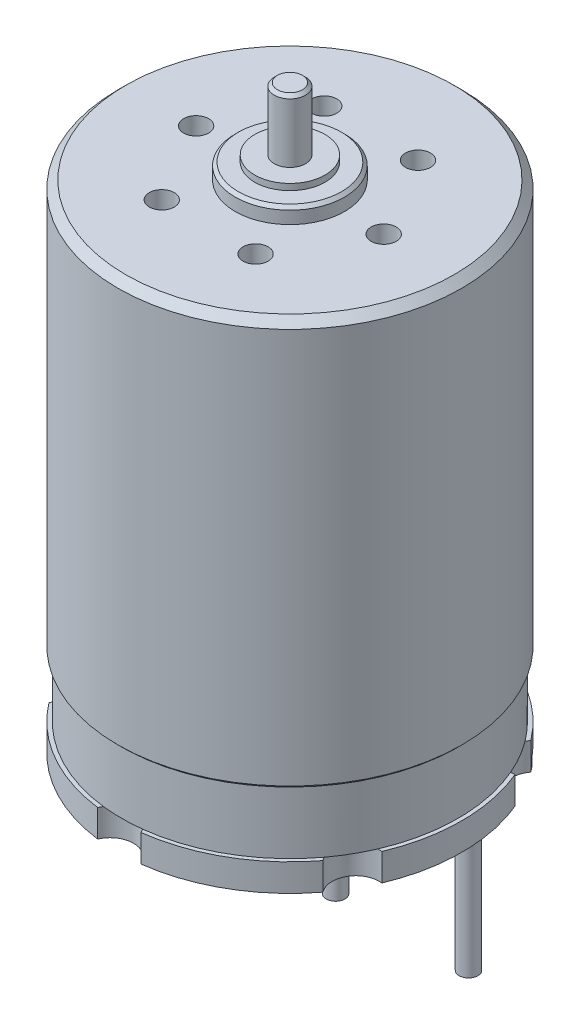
ISO-10303-21;
HEADER;
FILE_DESCRIPTION(('STEP AP214'),'2;1');
FILE_NAME('part.step','',(''),(''),'','','');
FILE_SCHEMA(('AUTOMOTIVE_DESIGN { 1 0 10303 214 1 1 1 1 }'));
ENDSEC;
DATA;
#1=APPLICATION_CONTEXT('core data for automotive mechanical design processes');
#2=APPLICATION_PROTOCOL_DEFINITION('international standard','automotive_design',2000,#1);
#3=PRODUCT_CONTEXT('',#1,'mechanical');
#4=PRODUCT('Part','Part','',(#3));
#5=PRODUCT_RELATED_PRODUCT_CATEGORY('part','',(#4));
#6=PRODUCT_DEFINITION_FORMATION('','',#4);
#7=PRODUCT_DEFINITION_CONTEXT('part definition',#1,'design');
#8=PRODUCT_DEFINITION('design','',#6,#7);
#9=PRODUCT_DEFINITION_SHAPE('','',#8);
#10=(LENGTH_UNIT() NAMED_UNIT(*) SI_UNIT(.MILLI.,.METRE.));
#11=(NAMED_UNIT(*) PLANE_ANGLE_UNIT() SI_UNIT($,.RADIAN.));
#12=(NAMED_UNIT(*) SI_UNIT($,.STERADIAN.) SOLID_ANGLE_UNIT());
#13=UNCERTAINTY_MEASURE_WITH_UNIT(LENGTH_MEASURE(1.E-05),#10,'distance_accuracy_value','');
#14=(GEOMETRIC_REPRESENTATION_CONTEXT(3) GLOBAL_UNCERTAINTY_ASSIGNED_CONTEXT((#13)) GLOBAL_UNIT_ASSIGNED_CONTEXT((#10,
#11,#12)) REPRESENTATION_CONTEXT('',''));
#15=CARTESIAN_POINT('',(0.,0.,0.));
#16=DIRECTION('',(0.,0.,1.));
#17=DIRECTION('',(1.,0.,0.));
#18=AXIS2_PLACEMENT_3D('',#15,#16,#17);
#19=CARTESIAN_POINT('',(0.,-1.75,0.));
#20=DIRECTION('',(0.,-1.,0.));
#21=DIRECTION('',(0.,0.,-1.));
#22=AXIS2_PLACEMENT_3D('',#19,#20,#21);
#23=PLANE('',#22);
#24=DIRECTION('',(-1.,0.,0.));
#25=VECTOR('',#24,1.);
#26=CARTESIAN_POINT('',(-5.6,-1.75,-6.8));
#27=LINE('',#26,#25);
#28=CARTESIAN_POINT('',(-5.8,-1.75,-6.8));
#29=VERTEX_POINT('',#28);
#30=CARTESIAN_POINT('',(-6.25,-1.75,-6.8));
#31=VERTEX_POINT('',#30);
#32=EDGE_CURVE('E1307',#29,#31,#27,.T.);
#33=ORIENTED_EDGE('',*,*,#32,.T.);
#34=DIRECTION('',(0.,0.,1.));
#35=VECTOR('',#34,1.);
#36=CARTESIAN_POINT('',(-6.25,-1.75,-6.8));
#37=LINE('',#36,#35);
#38=CARTESIAN_POINT('',(-6.25,-1.75,-3.6));
#39=VERTEX_POINT('',#38);
#40=EDGE_CURVE('E1311',#31,#39,#37,.T.);
#41=ORIENTED_EDGE('',*,*,#40,.T.);
#42=CARTESIAN_POINT('',(-2.68000000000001,-1.75,0.));
#43=DIRECTION('',(0.,1.,0.));
#44=DIRECTION('',(0.,0.,-1.));
#45=AXIS2_PLACEMENT_3D('',#42,#43,#44);
#46=CIRCLE('',#45,5.06999999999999);
#47=CARTESIAN_POINT('',(-7.75,-1.75,0.));
#48=VERTEX_POINT('',#47);
#49=EDGE_CURVE('E1314',#39,#48,#46,.T.);
#50=ORIENTED_EDGE('',*,*,#49,.T.);
#51=CARTESIAN_POINT('',(-5.6,-1.75,0.));
#52=DIRECTION('',(0.,1.,0.));
#53=DIRECTION('',(0.,0.,-1.));
#54=AXIS2_PLACEMENT_3D('',#51,#52,#53);
#55=CIRCLE('',#54,2.15);
#56=CARTESIAN_POINT('',(-7.67674052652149,-1.75,0.556460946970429));
#57=VERTEX_POINT('',#56);
#58=EDGE_CURVE('E1317',#48,#57,#55,.T.);
#59=ORIENTED_EDGE('',*,*,#58,.T.);
#60=DIRECTION('',(0.258819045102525,0.,0.965925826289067));
#61=VECTOR('',#60,1.);
#62=CARTESIAN_POINT('',(-7.67674052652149,-1.75,0.556460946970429));
#63=LINE('',#62,#61);
#64=CARTESIAN_POINT('',(-6.75404701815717,-1.75,4.));
#65=VERTEX_POINT('',#64);
#66=EDGE_CURVE('E1320',#57,#65,#63,.T.);
#67=ORIENTED_EDGE('',*,*,#66,.T.);
#68=DIRECTION('',(0.642787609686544,0.,0.766044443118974));
#69=VECTOR('',#68,1.);
#70=CARTESIAN_POINT('',(-6.75404701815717,-1.75,4.));
#71=LINE('',#70,#69);
#72=CARTESIAN_POINT('',(-3.98501823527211,-1.75,7.3));
#73=VERTEX_POINT('',#72);
#74=EDGE_CURVE('E1323',#65,#73,#71,.T.);
#75=ORIENTED_EDGE('',*,*,#74,.T.);
#76=DIRECTION('',(0.838670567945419,0.,-0.544639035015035));
#77=VECTOR('',#76,1.);
#78=CARTESIAN_POINT('',(-3.98501823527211,-1.75,7.3));
#79=LINE('',#78,#77);
#80=CARTESIAN_POINT('',(-2.5592782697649,-1.75,6.37411364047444));
#81=VERTEX_POINT('',#80);
#82=EDGE_CURVE('E1326',#73,#81,#79,.T.);
#83=ORIENTED_EDGE('',*,*,#82,.T.);
#84=DIRECTION('',(-0.438371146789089,0.,-0.898794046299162));
#85=VECTOR('',#84,1.);
#86=CARTESIAN_POINT('',(-2.5592782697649,-1.75,6.37411364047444));
#87=LINE('',#86,#85);
#88=CARTESIAN_POINT('',(-4.44771280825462,-1.75,2.50224905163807));
#89=VERTEX_POINT('',#88);
#90=EDGE_CURVE('E1329',#81,#89,#87,.T.);
#91=ORIENTED_EDGE('',*,*,#90,.T.);
#92=CARTESIAN_POINT('',(-3.8448200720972,-1.75,2.20819861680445));
#93=DIRECTION('',(0.,-1.,0.));
#94=DIRECTION('',(0.,0.,1.));
#95=AXIS2_PLACEMENT_3D('',#92,#93,#94);
#96=CIRCLE('',#95,0.670779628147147);
#97=CARTESIAN_POINT('',(-4.26220075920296,-1.75,1.68309036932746));
#98=VERTEX_POINT('',#97);
#99=EDGE_CURVE('E1155',#89,#98,#96,.T.);
#100=ORIENTED_EDGE('',*,*,#99,.T.);
#101=CARTESIAN_POINT('',(-5.6,-1.75,0.));
#102=DIRECTION('',(0.,1.,0.));
#103=DIRECTION('',(0.,0.,-1.));
#104=AXIS2_PLACEMENT_3D('',#101,#102,#103);
#105=CIRCLE('',#104,2.15);
#106=CARTESIAN_POINT('',(-3.69033206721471,-1.75,-0.987759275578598));
#107=VERTEX_POINT('',#106);
#108=EDGE_CURVE('E1150',#98,#107,#105,.T.);
#109=ORIENTED_EDGE('',*,*,#108,.T.);
#110=CARTESIAN_POINT('',(-2.7,-1.75,-1.5));
#111=DIRECTION('',(0.,-1.,0.));
#112=DIRECTION('',(0.,0.,-1.));
#113=AXIS2_PLACEMENT_3D('',#110,#111,#112);
#114=CIRCLE('',#113,1.1149655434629);
#115=CARTESIAN_POINT('',(-2.77399462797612,-1.75,-2.61250750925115));
#116=VERTEX_POINT('',#115);
#117=EDGE_CURVE('E1147',#107,#116,#114,.T.);
#118=ORIENTED_EDGE('',*,*,#117,.T.);
#119=CARTESIAN_POINT('',(-2.83967431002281,-1.75,-3.6));
#120=DIRECTION('',(0.,1.,0.));
#121=DIRECTION('',(0.,0.,1.));
#122=AXIS2_PLACEMENT_3D('',#119,#120,#121);
#123=CIRCLE('',#122,0.989674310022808);
#124=CARTESIAN_POINT('',(-1.85,-1.75,-3.6));
#125=VERTEX_POINT('',#124);
#126=EDGE_CURVE('E1134',#116,#125,#123,.T.);
#127=ORIENTED_EDGE('',*,*,#126,.T.);
#128=DIRECTION('',(0.,0.,-1.));
#129=VECTOR('',#128,1.);
#130=CARTESIAN_POINT('',(-1.85,-1.75,-3.6));
#131=LINE('',#130,#129);
#132=CARTESIAN_POINT('',(-1.85,-1.75,-6.8));
#133=VERTEX_POINT('',#132);
#134=EDGE_CURVE('E1142',#125,#133,#131,.T.);
#135=ORIENTED_EDGE('',*,*,#134,.T.);
#136=CARTESIAN_POINT('',(-2.7,-1.75,-6.8));
#137=VERTEX_POINT('',#136);
#138=EDGE_CURVE('E1308',#133,#137,#27,.T.);
#139=ORIENTED_EDGE('',*,*,#138,.T.);
#140=DIRECTION('',(1.,0.,0.));
#141=VECTOR('',#140,1.);
#142=CARTESIAN_POINT('',(-5.8,-1.75,-6.8));
#143=LINE('',#142,#141);
#144=EDGE_CURVE('E1269',#29,#137,#143,.T.);
#145=ORIENTED_EDGE('',*,*,#144,.F.);
#146=EDGE_LOOP('',(#33,#41,#50,#59,#67,#75,#83,#91,#100,#109,#118,#127,#135,#139,#145));
#147=FACE_BOUND('',#146,.T.);
#148=CARTESIAN_POINT('',(0.,-1.75,0.));
#149=DIRECTION('',(0.,-1.,0.));
#150=DIRECTION('',(0.,0.,-1.));
#151=AXIS2_PLACEMENT_3D('',#148,#149,#150);
#152=CIRCLE('',#151,1.);
#153=CARTESIAN_POINT('',(0.,-1.75,-1.));
#154=VERTEX_POINT('',#153);
#155=EDGE_CURVE('E1620',#154,#154,#152,.F.);
#156=ORIENTED_EDGE('',*,*,#155,.T.);
#157=EDGE_LOOP('',(#156));
#158=FACE_BOUND('',#157,.T.);
#159=CARTESIAN_POINT('',(0.,-1.75,11.5));
#160=DIRECTION('',(0.,-1.,0.));
#161=DIRECTION('',(0.,0.,-1.));
#162=AXIS2_PLACEMENT_3D('',#159,#160,#161);
#163=CIRCLE('',#162,1.5);
#164=CARTESIAN_POINT('',(-1.38039198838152,-1.75,10.9130434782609));
#165=VERTEX_POINT('',#164);
#166=CARTESIAN_POINT('',(1.38039198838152,-1.75,10.9130434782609));
#167=VERTEX_POINT('',#166);
#168=EDGE_CURVE('E1657',#165,#167,#163,.T.);
#169=ORIENTED_EDGE('',*,*,#168,.F.);
#170=CARTESIAN_POINT('',(0.,-1.75,0.));
#171=DIRECTION('',(0.,-1.,0.));
#172=DIRECTION('',(0.,0.,-1.));
#173=AXIS2_PLACEMENT_3D('',#170,#171,#172);
#174=CIRCLE('',#173,11.);
#175=CARTESIAN_POINT('',(-8.76077689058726,-1.75,6.65197626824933));
#176=VERTEX_POINT('',#175);
#177=EDGE_CURVE('E1637',#176,#165,#174,.F.);
#178=ORIENTED_EDGE('',*,*,#177,.F.);
#179=CARTESIAN_POINT('',(-9.95929214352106,-1.75,5.74999999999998));
#180=DIRECTION('',(0.,-1.,0.));
#181=DIRECTION('',(0.86602540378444,0.,-0.499999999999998));
#182=AXIS2_PLACEMENT_3D('',#179,#180,#181);
#183=CIRCLE('',#182,1.5);
#184=CARTESIAN_POINT('',(-10.1411688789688,-1.75,4.2610672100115));
#185=VERTEX_POINT('',#184);
#186=EDGE_CURVE('E3037',#185,#176,#183,.T.);
#187=ORIENTED_EDGE('',*,*,#186,.F.);
#188=CARTESIAN_POINT('',(-10.1411688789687,-1.75,-4.26106721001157));
#189=VERTEX_POINT('',#188);
#190=EDGE_CURVE('E1635',#189,#185,#174,.F.);
#191=ORIENTED_EDGE('',*,*,#190,.F.);
#192=CARTESIAN_POINT('',(-9.95929214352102,-1.75,-5.75000000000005));
#193=DIRECTION('',(0.,-1.,0.));
#194=DIRECTION('',(0.866025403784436,0.,0.500000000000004));
#195=AXIS2_PLACEMENT_3D('',#192,#193,#194);
#196=CIRCLE('',#195,1.5);
#197=CARTESIAN_POINT('',(-8.76077689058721,-1.75,-6.65197626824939));
#198=VERTEX_POINT('',#197);
#199=EDGE_CURVE('E3015',#198,#189,#196,.T.);
#200=ORIENTED_EDGE('',*,*,#199,.F.);
#201=CARTESIAN_POINT('',(-8.48528137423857,-1.75,-7.));
#202=VERTEX_POINT('',#201);
#203=EDGE_CURVE('E1632',#202,#198,#174,.F.);
#204=ORIENTED_EDGE('',*,*,#203,.F.);
#205=DIRECTION('',(1.,0.,0.));
#206=VECTOR('',#205,1.);
#207=CARTESIAN_POINT('',(-8.48528137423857,-1.75,-7.));
#208=LINE('',#207,#206);
#209=CARTESIAN_POINT('',(-3.,-1.75,-7.));
#210=VERTEX_POINT('',#209);
#211=EDGE_CURVE('E3153',#202,#210,#208,.T.);
#212=ORIENTED_EDGE('',*,*,#211,.T.);
#213=CARTESIAN_POINT('',(0.,-1.75,-7.));
#214=DIRECTION('',(0.,-1.,0.));
#215=DIRECTION('',(0.,0.,-1.));
#216=AXIS2_PLACEMENT_3D('',#213,#214,#215);
#217=CIRCLE('',#216,3.);
#218=CARTESIAN_POINT('',(3.,-1.75,-7.));
#219=VERTEX_POINT('',#218);
#220=EDGE_CURVE('E3082',#210,#219,#217,.T.);
#221=ORIENTED_EDGE('',*,*,#220,.T.);
#222=DIRECTION('',(1.,0.,0.));
#223=VECTOR('',#222,1.);
#224=CARTESIAN_POINT('',(-8.48528137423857,-1.75,-7.));
#225=LINE('',#224,#223);
#226=CARTESIAN_POINT('',(8.48528137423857,-1.75,-7.));
#227=VERTEX_POINT('',#226);
#228=EDGE_CURVE('E3151',#219,#227,#225,.T.);
#229=ORIENTED_EDGE('',*,*,#228,.T.);
#230=CARTESIAN_POINT('',(8.7607768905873,-1.75,-6.65197626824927));
#231=VERTEX_POINT('',#230);
#232=EDGE_CURVE('E1627',#231,#227,#174,.F.);
#233=ORIENTED_EDGE('',*,*,#232,.F.);
#234=CARTESIAN_POINT('',(9.9592921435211,-1.75,-5.74999999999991));
#235=DIRECTION('',(0.,-1.,0.));
#236=DIRECTION('',(0.,0.,-1.));
#237=AXIS2_PLACEMENT_3D('',#234,#235,#236);
#238=CIRCLE('',#237,1.5);
#239=CARTESIAN_POINT('',(10.1411688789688,-1.75,-4.26106721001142));
#240=VERTEX_POINT('',#239);
#241=EDGE_CURVE('E2892',#240,#231,#238,.T.);
#242=ORIENTED_EDGE('',*,*,#241,.F.);
#243=CARTESIAN_POINT('',(10.1411688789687,-1.75,4.26106721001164));
#244=VERTEX_POINT('',#243);
#245=EDGE_CURVE('E1641',#244,#240,#174,.F.);
#246=ORIENTED_EDGE('',*,*,#245,.F.);
#247=CARTESIAN_POINT('',(9.95929214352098,-1.75,5.75000000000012));
#248=DIRECTION('',(0.,-1.,0.));
#249=DIRECTION('',(0.,0.,-1.));
#250=AXIS2_PLACEMENT_3D('',#247,#248,#249);
#251=CIRCLE('',#250,1.5);
#252=CARTESIAN_POINT('',(8.76077689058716,-1.75,6.65197626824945));
#253=VERTEX_POINT('',#252);
#254=EDGE_CURVE('E2899',#253,#244,#251,.T.);
#255=ORIENTED_EDGE('',*,*,#254,.F.);
#256=EDGE_CURVE('E1639',#167,#253,#174,.F.);
#257=ORIENTED_EDGE('',*,*,#256,.F.);
#258=EDGE_LOOP('',(#169,#178,#187,#191,#200,#204,#212,#221,#229,#233,#242,#246,#255,#257));
#259=FACE_BOUND('',#258,.T.);
#260=DIRECTION('',(0.,0.,-1.));
#261=VECTOR('',#260,1.);
#262=CARTESIAN_POINT('',(1.85,-1.75,-3.6));
#263=LINE('',#262,#261);
#264=CARTESIAN_POINT('',(1.85,-1.75,-3.6));
#265=VERTEX_POINT('',#264);
#266=CARTESIAN_POINT('',(1.85,-1.75,-6.8));
#267=VERTEX_POINT('',#266);
#268=EDGE_CURVE('E1558',#265,#267,#263,.T.);
#269=ORIENTED_EDGE('',*,*,#268,.F.);
#270=CARTESIAN_POINT('',(2.83967431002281,-1.75,-3.6));
#271=DIRECTION('',(0.,-1.,0.));
#272=DIRECTION('',(0.,0.,1.));
#273=AXIS2_PLACEMENT_3D('',#270,#271,#272);
#274=CIRCLE('',#273,0.989674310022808);
#275=CARTESIAN_POINT('',(2.77399462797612,-1.75,-2.61250750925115));
#276=VERTEX_POINT('',#275);
#277=EDGE_CURVE('E1524',#276,#265,#274,.T.);
#278=ORIENTED_EDGE('',*,*,#277,.F.);
#279=CARTESIAN_POINT('',(2.7,-1.75,-1.5));
#280=DIRECTION('',(0.,1.,0.));
#281=DIRECTION('',(0.,0.,-1.));
#282=AXIS2_PLACEMENT_3D('',#279,#280,#281);
#283=CIRCLE('',#282,1.1149655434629);
#284=CARTESIAN_POINT('',(3.69033206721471,-1.75,-0.987759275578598));
#285=VERTEX_POINT('',#284);
#286=EDGE_CURVE('E1529',#285,#276,#283,.T.);
#287=ORIENTED_EDGE('',*,*,#286,.F.);
#288=CARTESIAN_POINT('',(5.6,-1.75,0.));
#289=DIRECTION('',(0.,-1.,0.));
#290=DIRECTION('',(0.,0.,-1.));
#291=AXIS2_PLACEMENT_3D('',#288,#289,#290);
#292=CIRCLE('',#291,2.15);
#293=CARTESIAN_POINT('',(4.26220075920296,-1.75,1.68309036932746));
#294=VERTEX_POINT('',#293);
#295=EDGE_CURVE('E1580',#294,#285,#292,.T.);
#296=ORIENTED_EDGE('',*,*,#295,.F.);
#297=CARTESIAN_POINT('',(3.8448200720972,-1.75,2.20819861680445));
#298=DIRECTION('',(0.,1.,0.));
#299=DIRECTION('',(0.,0.,1.));
#300=AXIS2_PLACEMENT_3D('',#297,#298,#299);
#301=CIRCLE('',#300,0.670779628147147);
#302=CARTESIAN_POINT('',(4.44771280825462,-1.75,2.50224905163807));
#303=VERTEX_POINT('',#302);
#304=EDGE_CURVE('E1578',#303,#294,#301,.T.);
#305=ORIENTED_EDGE('',*,*,#304,.F.);
#306=DIRECTION('',(0.438371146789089,0.,-0.898794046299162));
#307=VECTOR('',#306,1.);
#308=CARTESIAN_POINT('',(2.5592782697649,-1.75,6.37411364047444));
#309=LINE('',#308,#307);
#310=CARTESIAN_POINT('',(2.5592782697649,-1.75,6.37411364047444));
#311=VERTEX_POINT('',#310);
#312=EDGE_CURVE('E1576',#311,#303,#309,.T.);
#313=ORIENTED_EDGE('',*,*,#312,.F.);
#314=DIRECTION('',(-0.838670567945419,0.,-0.544639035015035));
#315=VECTOR('',#314,1.);
#316=CARTESIAN_POINT('',(3.98501823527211,-1.75,7.3));
#317=LINE('',#316,#315);
#318=CARTESIAN_POINT('',(3.98501823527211,-1.75,7.3));
#319=VERTEX_POINT('',#318);
#320=EDGE_CURVE('E1574',#319,#311,#317,.T.);
#321=ORIENTED_EDGE('',*,*,#320,.F.);
#322=DIRECTION('',(-0.642787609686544,0.,0.766044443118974));
#323=VECTOR('',#322,1.);
#324=CARTESIAN_POINT('',(6.75404701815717,-1.75,4.));
#325=LINE('',#324,#323);
#326=CARTESIAN_POINT('',(6.75404701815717,-1.75,4.));
#327=VERTEX_POINT('',#326);
#328=EDGE_CURVE('E1572',#327,#319,#325,.T.);
#329=ORIENTED_EDGE('',*,*,#328,.F.);
#330=DIRECTION('',(-0.258819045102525,0.,0.965925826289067));
#331=VECTOR('',#330,1.);
#332=CARTESIAN_POINT('',(7.67674052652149,-1.75,0.556460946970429));
#333=LINE('',#332,#331);
#334=CARTESIAN_POINT('',(7.67674052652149,-1.75,0.556460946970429));
#335=VERTEX_POINT('',#334);
#336=EDGE_CURVE('E1570',#335,#327,#333,.T.);
#337=ORIENTED_EDGE('',*,*,#336,.F.);
#338=CARTESIAN_POINT('',(5.6,-1.75,0.));
#339=DIRECTION('',(0.,-1.,0.));
#340=DIRECTION('',(0.,0.,-1.));
#341=AXIS2_PLACEMENT_3D('',#338,#339,#340);
#342=CIRCLE('',#341,2.15);
#343=CARTESIAN_POINT('',(7.75,-1.75,0.));
#344=VERTEX_POINT('',#343);
#345=EDGE_CURVE('E1568',#344,#335,#342,.T.);
#346=ORIENTED_EDGE('',*,*,#345,.F.);
#347=CARTESIAN_POINT('',(2.68000000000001,-1.75,0.));
#348=DIRECTION('',(0.,-1.,0.));
#349=DIRECTION('',(0.,0.,-1.));
#350=AXIS2_PLACEMENT_3D('',#347,#348,#349);
#351=CIRCLE('',#350,5.06999999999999);
#352=CARTESIAN_POINT('',(6.25,-1.75,-3.6));
#353=VERTEX_POINT('',#352);
#354=EDGE_CURVE('E1566',#353,#344,#351,.T.);
#355=ORIENTED_EDGE('',*,*,#354,.F.);
#356=DIRECTION('',(0.,0.,1.));
#357=VECTOR('',#356,1.);
#358=CARTESIAN_POINT('',(6.25,-1.75,-6.8));
#359=LINE('',#358,#357);
#360=CARTESIAN_POINT('',(6.25,-1.75,-6.8));
#361=VERTEX_POINT('',#360);
#362=EDGE_CURVE('E1564',#361,#353,#359,.T.);
#363=ORIENTED_EDGE('',*,*,#362,.F.);
#364=DIRECTION('',(1.,0.,0.));
#365=VECTOR('',#364,1.);
#366=CARTESIAN_POINT('',(5.6,-1.75,-6.8));
#367=LINE('',#366,#365);
#368=CARTESIAN_POINT('',(5.8,-1.75,-6.8));
#369=VERTEX_POINT('',#368);
#370=EDGE_CURVE('E1560',#369,#361,#367,.T.);
#371=ORIENTED_EDGE('',*,*,#370,.F.);
#372=DIRECTION('',(-1.,0.,0.));
#373=VECTOR('',#372,1.);
#374=CARTESIAN_POINT('',(5.8,-1.75,-6.8));
#375=LINE('',#374,#373);
#376=CARTESIAN_POINT('',(2.7,-1.75,-6.8));
#377=VERTEX_POINT('',#376);
#378=EDGE_CURVE('E1518',#369,#377,#375,.T.);
#379=ORIENTED_EDGE('',*,*,#378,.T.);
#380=EDGE_CURVE('E1561',#267,#377,#367,.T.);
#381=ORIENTED_EDGE('',*,*,#380,.F.);
#382=EDGE_LOOP('',(#269,#278,#287,#296,#305,#313,#321,#329,#337,#346,#355,#363,#371,#379,#381));
#383=FACE_BOUND('',#382,.T.);
#384=DIRECTION('',(0.,0.,1.));
#385=VECTOR('',#384,1.);
#386=CARTESIAN_POINT('',(6.49198753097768,-1.75,-5.09723803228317));
#387=LINE('',#386,#385);
#388=CARTESIAN_POINT('',(6.49198753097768,-1.75,-5.09723803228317));
#389=VERTEX_POINT('',#388);
#390=CARTESIAN_POINT('',(6.49198753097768,-1.75,-4.85979145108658));
#391=VERTEX_POINT('',#390);
#392=EDGE_CURVE('E643',#389,#391,#387,.T.);
#393=ORIENTED_EDGE('',*,*,#392,.T.);
#394=DIRECTION('',(1.,0.,0.));
#395=VECTOR('',#394,1.);
#396=CARTESIAN_POINT('',(6.49198753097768,-1.75,-4.85979145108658));
#397=LINE('',#396,#395);
#398=CARTESIAN_POINT('',(7.2721691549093,-1.75,-4.85979145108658));
#399=VERTEX_POINT('',#398);
#400=EDGE_CURVE('E52',#391,#399,#397,.T.);
#401=ORIENTED_EDGE('',*,*,#400,.T.);
#402=DIRECTION('',(0.,0.,1.));
#403=VECTOR('',#402,1.);
#404=CARTESIAN_POINT('',(7.2721691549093,-1.75,-4.85979145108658));
#405=LINE('',#404,#403);
#406=CARTESIAN_POINT('',(7.2721691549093,-1.75,-4.07960982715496));
#407=VERTEX_POINT('',#406);
#408=EDGE_CURVE('E647',#399,#407,#405,.T.);
#409=ORIENTED_EDGE('',*,*,#408,.T.);
#410=DIRECTION('',(1.,0.,0.));
#411=VECTOR('',#410,1.);
#412=CARTESIAN_POINT('',(7.2721691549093,-1.75,-4.07960982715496));
#413=LINE('',#412,#411);
#414=CARTESIAN_POINT('',(7.50961573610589,-1.75,-4.07960982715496));
#415=VERTEX_POINT('',#414);
#416=EDGE_CURVE('E1699',#407,#415,#413,.T.);
#417=ORIENTED_EDGE('',*,*,#416,.T.);
#418=DIRECTION('',(0.,0.,-1.));
#419=VECTOR('',#418,1.);
#420=CARTESIAN_POINT('',(7.50961573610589,-1.75,-4.07960982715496));
#421=LINE('',#420,#419);
#422=CARTESIAN_POINT('',(7.50961573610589,-1.75,-4.85979145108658));
#423=VERTEX_POINT('',#422);
#424=EDGE_CURVE('E1702',#415,#423,#421,.T.);
#425=ORIENTED_EDGE('',*,*,#424,.T.);
#426=DIRECTION('',(1.,0.,0.));
#427=VECTOR('',#426,1.);
#428=CARTESIAN_POINT('',(7.50961573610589,-1.75,-4.85979145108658));
#429=LINE('',#428,#427);
#430=CARTESIAN_POINT('',(8.28979736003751,-1.75,-4.85979145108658));
#431=VERTEX_POINT('',#430);
#432=EDGE_CURVE('E1707',#423,#431,#429,.T.);
#433=ORIENTED_EDGE('',*,*,#432,.T.);
#434=DIRECTION('',(0.,0.,-1.));
#435=VECTOR('',#434,1.);
#436=CARTESIAN_POINT('',(8.28979736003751,-1.75,-4.85979145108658));
#437=LINE('',#436,#435);
#438=CARTESIAN_POINT('',(8.28979736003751,-1.75,-5.09723803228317));
#439=VERTEX_POINT('',#438);
#440=EDGE_CURVE('E1714',#431,#439,#437,.T.);
#441=ORIENTED_EDGE('',*,*,#440,.T.);
#442=DIRECTION('',(-1.,0.,0.));
#443=VECTOR('',#442,1.);
#444=CARTESIAN_POINT('',(8.28979736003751,-1.75,-5.09723803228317));
#445=LINE('',#444,#443);
#446=CARTESIAN_POINT('',(7.50961573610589,-1.75,-5.09723803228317));
#447=VERTEX_POINT('',#446);
#448=EDGE_CURVE('E1717',#439,#447,#445,.T.);
#449=ORIENTED_EDGE('',*,*,#448,.T.);
#450=DIRECTION('',(0.,0.,-1.));
#451=VECTOR('',#450,1.);
#452=CARTESIAN_POINT('',(7.50961573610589,-1.75,-5.09723803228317));
#453=LINE('',#452,#451);
#454=CARTESIAN_POINT('',(7.50961573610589,-1.75,-5.87741965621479));
#455=VERTEX_POINT('',#454);
#456=EDGE_CURVE('E1720',#447,#455,#453,.T.);
#457=ORIENTED_EDGE('',*,*,#456,.T.);
#458=DIRECTION('',(-1.,0.,0.));
#459=VECTOR('',#458,1.);
#460=CARTESIAN_POINT('',(7.50961573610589,-1.75,-5.87741965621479));
#461=LINE('',#460,#459);
#462=CARTESIAN_POINT('',(7.2721691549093,-1.75,-5.87741965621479));
#463=VERTEX_POINT('',#462);
#464=EDGE_CURVE('E1723',#455,#463,#461,.T.);
#465=ORIENTED_EDGE('',*,*,#464,.T.);
#466=DIRECTION('',(0.,0.,1.));
#467=VECTOR('',#466,1.);
#468=CARTESIAN_POINT('',(7.2721691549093,-1.75,-5.87741965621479));
#469=LINE('',#468,#467);
#470=CARTESIAN_POINT('',(7.2721691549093,-1.75,-5.09723803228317));
#471=VERTEX_POINT('',#470);
#472=EDGE_CURVE('E1672',#463,#471,#469,.T.);
#473=ORIENTED_EDGE('',*,*,#472,.T.);
#474=DIRECTION('',(-1.,0.,0.));
#475=VECTOR('',#474,1.);
#476=CARTESIAN_POINT('',(7.2721691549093,-1.75,-5.09723803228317));
#477=LINE('',#476,#475);
#478=EDGE_CURVE('E1668',#471,#389,#477,.T.);
#479=ORIENTED_EDGE('',*,*,#478,.T.);
#480=EDGE_LOOP('',(#393,#401,#409,#417,#425,#433,#441,#449,#457,#465,#473,#479));
#481=FACE_BOUND('',#480,.T.);
#482=ADVANCED_FACE('F36',(#147,#158,#259,#383,#481),#23,.T.);
#483=CARTESIAN_POINT('',(5.8,-5.25,-7.05));
#484=DIRECTION('',(0.,0.,-1.));
#485=DIRECTION('',(-1.,0.,0.));
#486=AXIS2_PLACEMENT_3D('',#483,#484,#485);
#487=PLANE('',#486);
#488=DIRECTION('',(0.,1.,0.));
#489=VECTOR('',#488,1.);
#490=CARTESIAN_POINT('',(3.66316527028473,-15.25,-7.05));
#491=LINE('',#490,#489);
#492=CARTESIAN_POINT('',(3.66316527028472,-4.39371407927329,-7.05));
#493=VERTEX_POINT('',#492);
#494=CARTESIAN_POINT('',(3.66316527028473,-5.15064573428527,-7.05));
#495=VERTEX_POINT('',#494);
#496=EDGE_CURVE('E747',#493,#495,#491,.F.);
#497=ORIENTED_EDGE('',*,*,#496,.F.);
#498=CARTESIAN_POINT('',(4.25,-3.85,-7.05));
#499=DIRECTION('',(0.,0.,-1.));
#500=DIRECTION('',(-1.,0.,0.));
#501=AXIS2_PLACEMENT_3D('',#498,#499,#500);
#502=CIRCLE('',#501,0.8);
#503=CARTESIAN_POINT('',(3.66316527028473,-3.30628592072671,-7.05));
#504=VERTEX_POINT('',#503);
#505=EDGE_CURVE('E1445',#493,#504,#502,.T.);
#506=ORIENTED_EDGE('',*,*,#505,.T.);
#507=CARTESIAN_POINT('',(3.66316527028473,-3.25,-7.05));
#508=VERTEX_POINT('',#507);
#509=EDGE_CURVE('E748',#508,#504,#491,.F.);
#510=ORIENTED_EDGE('',*,*,#509,.F.);
#511=DIRECTION('',(-1.,0.,0.));
#512=VECTOR('',#511,1.);
#513=CARTESIAN_POINT('',(5.8,-3.25,-7.05));
#514=LINE('',#513,#512);
#515=CARTESIAN_POINT('',(3.72084973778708,-3.25,-7.05));
#516=VERTEX_POINT('',#515);
#517=EDGE_CURVE('E1427',#516,#508,#514,.T.);
#518=ORIENTED_EDGE('',*,*,#517,.F.);
#519=CARTESIAN_POINT('',(4.77915026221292,-3.25,-7.05));
#520=VERTEX_POINT('',#519);
#521=EDGE_CURVE('E1485',#516,#520,#502,.T.);
#522=ORIENTED_EDGE('',*,*,#521,.T.);
#523=CARTESIAN_POINT('',(4.83683472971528,-3.25,-7.05));
#524=VERTEX_POINT('',#523);
#525=EDGE_CURVE('E1423',#524,#520,#514,.T.);
#526=ORIENTED_EDGE('',*,*,#525,.F.);
#527=DIRECTION('',(0.,1.,0.));
#528=VECTOR('',#527,1.);
#529=CARTESIAN_POINT('',(4.83683472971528,-15.25,-7.05));
#530=LINE('',#529,#528);
#531=CARTESIAN_POINT('',(4.83683472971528,-3.30628592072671,-7.05));
#532=VERTEX_POINT('',#531);
#533=EDGE_CURVE('E1430',#532,#524,#530,.T.);
#534=ORIENTED_EDGE('',*,*,#533,.F.);
#535=CARTESIAN_POINT('',(4.83683472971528,-4.39371407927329,-7.05));
#536=VERTEX_POINT('',#535);
#537=EDGE_CURVE('E1481',#532,#536,#502,.T.);
#538=ORIENTED_EDGE('',*,*,#537,.T.);
#539=CARTESIAN_POINT('',(4.83683472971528,-5.15064573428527,-7.05));
#540=VERTEX_POINT('',#539);
#541=EDGE_CURVE('E756',#540,#536,#530,.T.);
#542=ORIENTED_EDGE('',*,*,#541,.F.);
#543=CARTESIAN_POINT('',(4.3,-3.75,-7.05));
#544=DIRECTION('',(0.,0.,-1.));
#545=DIRECTION('',(-1.,0.,0.));
#546=AXIS2_PLACEMENT_3D('',#543,#544,#545);
#547=CIRCLE('',#546,1.5);
#548=CARTESIAN_POINT('',(5.8,-3.75,-7.05));
#549=VERTEX_POINT('',#548);
#550=EDGE_CURVE('E1454',#540,#549,#547,.F.);
#551=ORIENTED_EDGE('',*,*,#550,.T.);
#552=DIRECTION('',(0.,-1.,0.));
#553=VECTOR('',#552,1.);
#554=CARTESIAN_POINT('',(5.8,-5.25,-7.05));
#555=LINE('',#554,#553);
#556=CARTESIAN_POINT('',(5.8,-2.25,-7.05));
#557=VERTEX_POINT('',#556);
#558=EDGE_CURVE('E1497',#557,#549,#555,.T.);
#559=ORIENTED_EDGE('',*,*,#558,.F.);
#560=DIRECTION('',(-1.,0.,0.));
#561=VECTOR('',#560,1.);
#562=CARTESIAN_POINT('',(5.8,-2.25,-7.05));
#563=LINE('',#562,#561);
#564=CARTESIAN_POINT('',(2.7,-2.25,-7.05));
#565=VERTEX_POINT('',#564);
#566=EDGE_CURVE('E1513',#557,#565,#563,.T.);
#567=ORIENTED_EDGE('',*,*,#566,.T.);
#568=DIRECTION('',(0.,-1.,0.));
#569=VECTOR('',#568,1.);
#570=CARTESIAN_POINT('',(2.7,-5.25,-7.05));
#571=LINE('',#570,#569);
#572=CARTESIAN_POINT('',(2.7,-3.75,-7.05));
#573=VERTEX_POINT('',#572);
#574=EDGE_CURVE('E1451',#565,#573,#571,.T.);
#575=ORIENTED_EDGE('',*,*,#574,.T.);
#576=CARTESIAN_POINT('',(4.2,-3.75,-7.05));
#577=DIRECTION('',(0.,0.,-1.));
#578=DIRECTION('',(-1.,0.,0.));
#579=AXIS2_PLACEMENT_3D('',#576,#577,#578);
#580=CIRCLE('',#579,1.5);
#581=EDGE_CURVE('E1448',#573,#495,#580,.F.);
#582=ORIENTED_EDGE('',*,*,#581,.T.);
#583=EDGE_LOOP('',(#497,#506,#510,#518,#522,#526,#534,#538,#542,#551,#559,#567,#575,#582));
#584=FACE_BOUND('',#583,.T.);
#585=ADVANCED_FACE('F1029',(#584),#487,.F.);
#586=CARTESIAN_POINT('',(5.8,-2.25,-7.3));
#587=DIRECTION('',(0.,0.,1.));
#588=DIRECTION('',(1.,0.,0.));
#589=AXIS2_PLACEMENT_3D('',#586,#587,#588);
#590=PLANE('',#589);
#591=DIRECTION('',(0.,1.,0.));
#592=VECTOR('',#591,1.);
#593=CARTESIAN_POINT('',(4.83683472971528,-15.25,-7.3));
#594=LINE('',#593,#592);
#595=CARTESIAN_POINT('',(4.83683472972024,-4.39371407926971,-7.2999999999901));
#596=VERTEX_POINT('',#595);
#597=CARTESIAN_POINT('',(4.83683472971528,-5.15064573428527,-7.3));
#598=VERTEX_POINT('',#597);
#599=EDGE_CURVE('E746',#596,#598,#594,.F.);
#600=ORIENTED_EDGE('',*,*,#599,.F.);
#601=CARTESIAN_POINT('',(4.25,-3.85,-7.3));
#602=DIRECTION('',(0.,0.,-1.));
#603=DIRECTION('',(-1.,0.,0.));
#604=AXIS2_PLACEMENT_3D('',#601,#602,#603);
#605=CIRCLE('',#604,0.8);
#606=CARTESIAN_POINT('',(4.83683472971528,-3.30628592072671,-7.3));
#607=VERTEX_POINT('',#606);
#608=EDGE_CURVE('E1483',#607,#596,#605,.T.);
#609=ORIENTED_EDGE('',*,*,#608,.F.);
#610=CARTESIAN_POINT('',(4.83683472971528,-3.25,-7.3));
#611=VERTEX_POINT('',#610);
#612=EDGE_CURVE('E1428',#611,#607,#594,.F.);
#613=ORIENTED_EDGE('',*,*,#612,.F.);
#614=DIRECTION('',(1.,0.,0.));
#615=VECTOR('',#614,1.);
#616=CARTESIAN_POINT('',(5.8,-3.25,-7.3));
#617=LINE('',#616,#615);
#618=CARTESIAN_POINT('',(4.77915026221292,-3.25,-7.3));
#619=VERTEX_POINT('',#618);
#620=EDGE_CURVE('E1420',#619,#611,#617,.T.);
#621=ORIENTED_EDGE('',*,*,#620,.F.);
#622=CARTESIAN_POINT('',(3.72084973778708,-3.25,-7.3));
#623=VERTEX_POINT('',#622);
#624=EDGE_CURVE('E1488',#623,#619,#605,.T.);
#625=ORIENTED_EDGE('',*,*,#624,.F.);
#626=CARTESIAN_POINT('',(3.66316527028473,-3.25,-7.3));
#627=VERTEX_POINT('',#626);
#628=EDGE_CURVE('E1424',#627,#623,#617,.T.);
#629=ORIENTED_EDGE('',*,*,#628,.F.);
#630=DIRECTION('',(0.,1.,0.));
#631=VECTOR('',#630,1.);
#632=CARTESIAN_POINT('',(3.66316527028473,-15.25,-7.3));
#633=LINE('',#632,#631);
#634=CARTESIAN_POINT('',(3.66316527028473,-3.30628592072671,-7.3));
#635=VERTEX_POINT('',#634);
#636=EDGE_CURVE('E1432',#635,#627,#633,.T.);
#637=ORIENTED_EDGE('',*,*,#636,.F.);
#638=CARTESIAN_POINT('',(3.66316527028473,-4.39371407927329,-7.3));
#639=VERTEX_POINT('',#638);
#640=EDGE_CURVE('E755',#639,#635,#605,.T.);
#641=ORIENTED_EDGE('',*,*,#640,.F.);
#642=CARTESIAN_POINT('',(3.66316527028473,-5.15064573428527,-7.3));
#643=VERTEX_POINT('',#642);
#644=EDGE_CURVE('E1433',#643,#639,#633,.T.);
#645=ORIENTED_EDGE('',*,*,#644,.F.);
#646=CARTESIAN_POINT('',(4.2,-3.75,-7.3));
#647=DIRECTION('',(0.,0.,1.));
#648=DIRECTION('',(1.,0.,0.));
#649=AXIS2_PLACEMENT_3D('',#646,#647,#648);
#650=CIRCLE('',#649,1.5);
#651=CARTESIAN_POINT('',(2.7,-3.75,-7.3));
#652=VERTEX_POINT('',#651);
#653=EDGE_CURVE('E1460',#643,#652,#650,.F.);
#654=ORIENTED_EDGE('',*,*,#653,.T.);
#655=DIRECTION('',(0.,1.,0.));
#656=VECTOR('',#655,1.);
#657=CARTESIAN_POINT('',(2.7,-2.25,-7.3));
#658=LINE('',#657,#656);
#659=CARTESIAN_POINT('',(2.7,-2.25,-7.3));
#660=VERTEX_POINT('',#659);
#661=EDGE_CURVE('E1493',#652,#660,#658,.T.);
#662=ORIENTED_EDGE('',*,*,#661,.T.);
#663=DIRECTION('',(-1.,0.,0.));
#664=VECTOR('',#663,1.);
#665=CARTESIAN_POINT('',(5.8,-2.25,-7.3));
#666=LINE('',#665,#664);
#667=CARTESIAN_POINT('',(5.8,-2.25,-7.3));
#668=VERTEX_POINT('',#667);
#669=EDGE_CURVE('E1501',#668,#660,#666,.T.);
#670=ORIENTED_EDGE('',*,*,#669,.F.);
#671=DIRECTION('',(0.,1.,0.));
#672=VECTOR('',#671,1.);
#673=CARTESIAN_POINT('',(5.8,-2.25,-7.3));
#674=LINE('',#673,#672);
#675=CARTESIAN_POINT('',(5.8,-3.75,-7.3));
#676=VERTEX_POINT('',#675);
#677=EDGE_CURVE('E1499',#676,#668,#674,.T.);
#678=ORIENTED_EDGE('',*,*,#677,.F.);
#679=CARTESIAN_POINT('',(4.3,-3.75,-7.3));
#680=DIRECTION('',(0.,0.,1.));
#681=DIRECTION('',(1.,0.,0.));
#682=AXIS2_PLACEMENT_3D('',#679,#680,#681);
#683=CIRCLE('',#682,1.5);
#684=EDGE_CURVE('E1455',#676,#598,#683,.F.);
#685=ORIENTED_EDGE('',*,*,#684,.T.);
#686=EDGE_LOOP('',(#600,#609,#613,#621,#625,#629,#637,#641,#645,#654,#662,#670,#678,#685));
#687=FACE_BOUND('',#686,.T.);
#688=ADVANCED_FACE('F762',(#687),#590,.F.);
#689=CARTESIAN_POINT('',(4.3,-3.75,-6.8));
#690=DIRECTION('',(0.,0.,-1.));
#691=DIRECTION('',(-1.,0.,0.));
#692=AXIS2_PLACEMENT_3D('',#689,#690,#691);
#693=CYLINDRICAL_SURFACE('',#692,1.5);
#694=ORIENTED_EDGE('',*,*,#550,.F.);
#695=CARTESIAN_POINT('',(4.83683472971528,-5.15064573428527,-7.05));
#696=CARTESIAN_POINT('',(4.8401474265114,-5.14937518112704,-7.06555432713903));
#697=CARTESIAN_POINT('',(4.84284417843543,-5.14832942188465,-7.08125155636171));
#698=CARTESIAN_POINT('',(4.84698403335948,-5.14671520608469,-7.11283556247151));
#699=CARTESIAN_POINT('',(4.84842705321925,-5.14614678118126,-7.12872235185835));
#700=CARTESIAN_POINT('',(4.85081089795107,-5.14521162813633,-7.17589744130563));
#701=CARTESIAN_POINT('',(4.84993660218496,-5.14556362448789,-7.20731549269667));
#702=CARTESIAN_POINT('',(4.8444427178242,-5.14770430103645,-7.25913381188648));
#703=CARTESIAN_POINT('',(4.84117175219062,-5.14897379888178,-7.27970877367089));
#704=CARTESIAN_POINT('',(4.83683472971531,-5.15064573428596,-7.29999999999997));
#705=B_SPLINE_CURVE_WITH_KNOTS('',3,(#695,#696,#697,#698,#699,#700,#701,#702,#703,#704),
.UNSPECIFIED.,.F.,.F.,(4,2,2,2,4),(0.,0.0478338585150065,0.0956708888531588,0.189477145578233,
0.251948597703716),.UNSPECIFIED.);
#706=EDGE_CURVE('E750',#540,#598,#705,.T.);
#707=ORIENTED_EDGE('',*,*,#706,.T.);
#708=ORIENTED_EDGE('',*,*,#684,.F.);
#709=DIRECTION('',(0.,0.,-1.));
#710=VECTOR('',#709,1.);
#711=CARTESIAN_POINT('',(5.8,-3.75,-6.8));
#712=LINE('',#711,#710);
#713=EDGE_CURVE('E3087',#549,#676,#712,.T.);
#714=ORIENTED_EDGE('',*,*,#713,.F.);
#715=EDGE_LOOP('',(#694,#707,#708,#714));
#716=FACE_BOUND('',#715,.T.);
#717=ADVANCED_FACE('F758',(#716),#693,.T.);
#718=CARTESIAN_POINT('',(4.2,-3.75,-7.3));
#719=DIRECTION('',(0.,0.,1.));
#720=DIRECTION('',(1.,0.,0.));
#721=AXIS2_PLACEMENT_3D('',#718,#719,#720);
#722=CYLINDRICAL_SURFACE('',#721,1.5);
#723=ORIENTED_EDGE('',*,*,#653,.F.);
#724=CARTESIAN_POINT('',(3.66316527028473,-5.15064573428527,-7.3));
#725=CARTESIAN_POINT('',(3.6598525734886,-5.14937518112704,-7.28444567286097));
#726=CARTESIAN_POINT('',(3.65715582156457,-5.14832942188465,-7.26874844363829));
#727=CARTESIAN_POINT('',(3.65301596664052,-5.14671520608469,-7.23716443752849));
#728=CARTESIAN_POINT('',(3.65157294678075,-5.14614678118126,-7.22127764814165));
#729=CARTESIAN_POINT('',(3.64918910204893,-5.14521162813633,-7.17410255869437));
#730=CARTESIAN_POINT('',(3.65006339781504,-5.14556362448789,-7.14268450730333));
#731=CARTESIAN_POINT('',(3.6555572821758,-5.14770430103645,-7.09086618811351));
#732=CARTESIAN_POINT('',(3.65882824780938,-5.14897379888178,-7.07029122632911));
#733=CARTESIAN_POINT('',(3.66316527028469,-5.15064573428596,-7.05000000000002));
#734=B_SPLINE_CURVE_WITH_KNOTS('',3,(#724,#725,#726,#727,#728,#729,#730,#731,#732,#733),
.UNSPECIFIED.,.F.,.F.,(4,2,2,2,4),(0.,0.0478338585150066,0.0956708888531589,0.189477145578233,
0.251948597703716),.UNSPECIFIED.);
#735=EDGE_CURVE('E741',#643,#495,#734,.T.);
#736=ORIENTED_EDGE('',*,*,#735,.T.);
#737=ORIENTED_EDGE('',*,*,#581,.F.);
#738=DIRECTION('',(0.,0.,-1.));
#739=VECTOR('',#738,1.);
#740=CARTESIAN_POINT('',(2.7,-3.75,-7.05));
#741=LINE('',#740,#739);
#742=EDGE_CURVE('E1457',#652,#573,#741,.F.);
#743=ORIENTED_EDGE('',*,*,#742,.F.);
#744=EDGE_LOOP('',(#723,#736,#737,#743));
#745=FACE_BOUND('',#744,.T.);
#746=ADVANCED_FACE('F38',(#745),#722,.T.);
#747=CARTESIAN_POINT('',(4.25,-3.85,-4.2));
#748=DIRECTION('',(0.,0.,-1.));
#749=DIRECTION('',(-1.,0.,0.));
#750=AXIS2_PLACEMENT_3D('',#747,#748,#749);
#751=CYLINDRICAL_SURFACE('',#750,0.8);
#752=CARTESIAN_POINT('',(4.25,-4.65,-6.575));
#753=CARTESIAN_POINT('',(4.27929617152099,-4.64999643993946,-6.57500378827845));
#754=CARTESIAN_POINT('',(4.30862653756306,-4.64837412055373,-6.57716251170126));
#755=CARTESIAN_POINT('',(4.36637244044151,-4.6420268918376,-6.585666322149));
#756=CARTESIAN_POINT('',(4.39478548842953,-4.63729418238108,-6.59202193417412));
#757=CARTESIAN_POINT('',(4.4496944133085,-4.62518257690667,-6.60848529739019));
#758=CARTESIAN_POINT('',(4.47620079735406,-4.61781977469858,-6.61857024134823));
#759=CARTESIAN_POINT('',(4.52696878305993,-4.60100225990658,-6.64201690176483));
#760=CARTESIAN_POINT('',(4.55123103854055,-4.59154815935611,-6.6553776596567));
#761=CARTESIAN_POINT('',(4.5993864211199,-4.57019816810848,-6.686305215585));
#762=CARTESIAN_POINT('',(4.62303730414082,-4.55815723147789,-6.70414693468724));
#763=CARTESIAN_POINT('',(4.6672108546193,-4.53306807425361,-6.74279833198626));
#764=CARTESIAN_POINT('',(4.68772858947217,-4.52001831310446,-6.76361259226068));
#765=CARTESIAN_POINT('',(4.72934865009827,-4.49108449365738,-6.81243318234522));
#766=CARTESIAN_POINT('',(4.74972231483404,-4.47516341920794,-6.84104147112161));
#767=CARTESIAN_POINT('',(4.78544799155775,-4.44484577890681,-6.90198040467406));
#768=CARTESIAN_POINT('',(4.80080686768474,-4.43044714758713,-6.93430587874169));
#769=CARTESIAN_POINT('',(4.82152251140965,-4.4099086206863,-6.99080113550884));
#770=CARTESIAN_POINT('',(4.82850269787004,-4.40263100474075,-7.01395627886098));
#771=CARTESIAN_POINT('',(4.83968269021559,-4.39068637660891,-7.06155709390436));
#772=CARTESIAN_POINT('',(4.84388886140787,-4.38601339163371,-7.08599967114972));
#773=CARTESIAN_POINT('',(4.8492512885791,-4.38001503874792,-7.1358730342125));
#774=CARTESIAN_POINT('',(4.85037981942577,-4.37872010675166,-7.16131072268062));
#775=CARTESIAN_POINT('',(4.84939285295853,-4.37983812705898,-7.21204596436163));
#776=CARTESIAN_POINT('',(4.84727619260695,-4.38225240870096,-7.23734346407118));
#777=CARTESIAN_POINT('',(4.84039095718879,-4.38987049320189,-7.28427653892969));
#778=CARTESIAN_POINT('',(4.83592994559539,-4.39474862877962,-7.30601454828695));
#779=CARTESIAN_POINT('',(4.82482268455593,-4.4064567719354,-7.34837555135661));
#780=CARTESIAN_POINT('',(4.81817433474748,-4.41328865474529,-7.36899745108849));
#781=CARTESIAN_POINT('',(4.79813225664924,-4.43296707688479,-7.42150255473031));
#782=CARTESIAN_POINT('',(4.78312059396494,-4.44690259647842,-7.45236016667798));
#783=CARTESIAN_POINT('',(4.74847209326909,-4.47613319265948,-7.510678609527));
#784=CARTESIAN_POINT('',(4.7288240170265,-4.49143151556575,-7.53813093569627));
#785=CARTESIAN_POINT('',(4.68460641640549,-4.52220668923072,-7.59010135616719));
#786=CARTESIAN_POINT('',(4.65992550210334,-4.53767834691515,-7.61452824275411));
#787=CARTESIAN_POINT('',(4.60616900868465,-4.56699215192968,-7.65910545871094));
#788=CARTESIAN_POINT('',(4.5771020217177,-4.58083739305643,-7.67926396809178));
#789=CARTESIAN_POINT('',(4.52116083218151,-4.60311890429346,-7.71099231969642));
#790=CARTESIAN_POINT('',(4.49501594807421,-4.61208308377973,-7.72347383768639));
#791=CARTESIAN_POINT('',(4.44054086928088,-4.62749161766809,-7.74468995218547));
#792=CARTESIAN_POINT('',(4.41221205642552,-4.63393755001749,-7.75342689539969));
#793=CARTESIAN_POINT('',(4.3538704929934,-4.64378235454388,-7.7667013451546));
#794=CARTESIAN_POINT('',(4.32384851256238,-4.64716237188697,-7.77121287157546));
#795=CARTESIAN_POINT('',(4.26328049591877,-4.6504635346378,-7.77561983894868));
#796=CARTESIAN_POINT('',(4.23273468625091,-4.65038613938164,-7.77551722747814));
#797=CARTESIAN_POINT('',(4.17527831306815,-4.64697018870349,-7.77095565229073));
#798=CARTESIAN_POINT('',(4.14831106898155,-4.6439603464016,-7.76693578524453));
#799=CARTESIAN_POINT('',(4.09555573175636,-4.63540528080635,-7.75541048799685));
#800=CARTESIAN_POINT('',(4.0697678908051,-4.62985951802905,-7.74790431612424));
#801=CARTESIAN_POINT('',(4.0190332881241,-4.61639932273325,-7.72944498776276));
#802=CARTESIAN_POINT('',(3.99414833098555,-4.60840820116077,-7.71837952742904));
#803=CARTESIAN_POINT('',(3.94659258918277,-4.59066794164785,-7.69333101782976));
#804=CARTESIAN_POINT('',(3.92392211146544,-4.58091856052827,-7.67934756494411));
#805=CARTESIAN_POINT('',(3.87739534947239,-4.558476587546,-7.64628670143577));
#806=CARTESIAN_POINT('',(3.85397329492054,-4.54556438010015,-7.62674858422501));
#807=CARTESIAN_POINT('',(3.81051210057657,-4.51895581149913,-7.58459649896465));
#808=CARTESIAN_POINT('',(3.79048067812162,-4.50525775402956,-7.56197572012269));
#809=CARTESIAN_POINT('',(3.75048983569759,-4.47547651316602,-7.5093400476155));
#810=CARTESIAN_POINT('',(3.73126782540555,-4.45943487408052,-7.47873697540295));
#811=CARTESIAN_POINT('',(3.69830705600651,-4.42976236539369,-7.41365596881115));
#812=CARTESIAN_POINT('',(3.68455199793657,-4.41612439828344,-7.37918995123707));
#813=CARTESIAN_POINT('',(3.66753706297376,-4.3984755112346,-7.32083422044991));
#814=CARTESIAN_POINT('',(3.66227596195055,-4.39278324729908,-7.29804354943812));
#815=CARTESIAN_POINT('',(3.65443391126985,-4.38416822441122,-7.25151718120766));
#816=CARTESIAN_POINT('',(3.65184697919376,-4.38123928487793,-7.22778371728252));
#817=CARTESIAN_POINT('',(3.64953871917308,-4.37863040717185,-7.17986836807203));
#818=CARTESIAN_POINT('',(3.64983193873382,-4.37896696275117,-7.15568482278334));
#819=CARTESIAN_POINT('',(3.65329246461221,-4.38286579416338,-7.10777726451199));
#820=CARTESIAN_POINT('',(3.65646347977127,-4.38643223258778,-7.0840538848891));
#821=CARTESIAN_POINT('',(3.66642463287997,-4.39726939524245,-7.0326341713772));
#822=CARTESIAN_POINT('',(3.67385372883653,-4.40517882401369,-7.0052011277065));
#823=CARTESIAN_POINT('',(3.69212149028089,-4.42353185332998,-6.95238606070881));
#824=CARTESIAN_POINT('',(3.70296876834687,-4.43398183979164,-6.92700942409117));
#825=CARTESIAN_POINT('',(3.73200432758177,-4.46006591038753,-6.86999174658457));
#826=CARTESIAN_POINT('',(3.75143384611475,-4.4762408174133,-6.83923136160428));
#827=CARTESIAN_POINT('',(3.79539711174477,-4.50885403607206,-6.78174958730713));
#828=CARTESIAN_POINT('',(3.81993540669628,-4.52529257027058,-6.75503183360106));
#829=CARTESIAN_POINT('',(3.87414919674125,-4.55691597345,-6.70586724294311));
#830=CARTESIAN_POINT('',(3.90386534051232,-4.57208940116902,-6.68345739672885));
#831=CARTESIAN_POINT('',(3.96793615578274,-4.59942909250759,-6.64411085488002));
#832=CARTESIAN_POINT('',(4.00227946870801,-4.61160251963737,-6.62716109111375));
#833=CARTESIAN_POINT('',(4.06406442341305,-4.62854699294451,-6.60388003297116));
#834=CARTESIAN_POINT('',(4.09058029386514,-4.63444185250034,-6.59589266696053));
#835=CARTESIAN_POINT('',(4.14486162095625,-4.64353439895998,-6.58363347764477));
#836=CARTESIAN_POINT('',(4.17262335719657,-4.64673961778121,-6.57935127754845));
#837=CARTESIAN_POINT('',(4.21701843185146,-4.64949075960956,-6.57567898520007));
#838=CARTESIAN_POINT('',(4.2335037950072,-4.65000200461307,-6.57499786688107));
#839=CARTESIAN_POINT('',(4.25,-4.65,-6.575));
#840=B_SPLINE_CURVE_WITH_KNOTS('',3,(#752,#753,#754,#755,#756,#757,#758,#759,#760,#761,#762,
#763,#764,#765,#766,#767,#768,#769,#770,#771,#772,#773,#774,#775,#776,#777,#778,#779,#780,#781,
#782,#783,#784,#785,#786,#787,#788,#789,#790,#791,#792,#793,#794,#795,#796,#797,#798,#799,#800,
#801,#802,#803,#804,#805,#806,#807,#808,#809,#810,#811,#812,#813,#814,#815,#816,#817,#818,#819,
#820,#821,#822,#823,#824,#825,#826,#827,#828,#829,#830,#831,#832,#833,#834,#835,#836,#837,#838,
#839),.UNSPECIFIED.,.T.,.F.,(4,2,2,2,2,2,2,2,2,2,2,2,2,2,2,2,2,2,2,2,2,2,2,2,2,2,2,2,2,2,2,2,2,
2,2,2,2,2,2,2,2,2,2,4),(0.,0.0878287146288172,0.175878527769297,0.263398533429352,
0.350892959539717,0.446489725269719,0.542235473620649,0.657440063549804,0.772486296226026,
0.847998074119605,0.923335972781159,0.999350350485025,1.07539197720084,1.14330756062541,
1.21128855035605,1.32179732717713,1.43257676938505,1.54614353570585,1.65949064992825,
1.75010601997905,1.84066451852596,1.93177623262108,2.02284948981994,2.10476474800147,
2.18669744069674,2.27152175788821,2.35635781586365,2.45536152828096,2.5545876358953,
2.67267438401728,2.79040638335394,2.86235664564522,2.93414559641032,3.00629733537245,
3.07854219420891,3.16655868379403,3.25479874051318,3.37364898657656,3.49260548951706,
3.61254179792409,3.73218888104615,3.81678279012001,3.90113900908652,3.95059395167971),.UNSPECIFIED.);
#841=EDGE_CURVE('E45',#536,#596,#840,.T.);
#842=ORIENTED_EDGE('',*,*,#841,.F.);
#843=ORIENTED_EDGE('',*,*,#537,.F.);
#844=CARTESIAN_POINT('',(4.25,-3.05,-6.575));
#845=CARTESIAN_POINT('',(4.22070382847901,-3.05000356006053,-6.57500378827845));
#846=CARTESIAN_POINT('',(4.19137346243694,-3.05162587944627,-6.57716251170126));
#847=CARTESIAN_POINT('',(4.13362755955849,-3.0579731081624,-6.585666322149));
#848=CARTESIAN_POINT('',(4.10521451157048,-3.06270581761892,-6.59202193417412));
#849=CARTESIAN_POINT('',(4.0503055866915,-3.07481742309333,-6.60848529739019));
#850=CARTESIAN_POINT('',(4.02379920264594,-3.08218022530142,-6.61857024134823));
#851=CARTESIAN_POINT('',(3.97303121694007,-3.09899774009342,-6.64201690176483));
#852=CARTESIAN_POINT('',(3.94876896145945,-3.10845184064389,-6.6553776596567));
#853=CARTESIAN_POINT('',(3.9006135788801,-3.12980183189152,-6.686305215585));
#854=CARTESIAN_POINT('',(3.87696269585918,-3.14184276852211,-6.70414693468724));
#855=CARTESIAN_POINT('',(3.8327891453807,-3.16693192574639,-6.74279833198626));
#856=CARTESIAN_POINT('',(3.81227141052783,-3.17998168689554,-6.76361259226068));
#857=CARTESIAN_POINT('',(3.77065134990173,-3.20891550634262,-6.81243318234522));
#858=CARTESIAN_POINT('',(3.75027768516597,-3.22483658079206,-6.84104147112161));
#859=CARTESIAN_POINT('',(3.71455200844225,-3.25515422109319,-6.90198040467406));
#860=CARTESIAN_POINT('',(3.69919313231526,-3.26955285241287,-6.93430587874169));
#861=CARTESIAN_POINT('',(3.67847748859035,-3.2900913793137,-6.99080113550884));
#862=CARTESIAN_POINT('',(3.67149730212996,-3.29736899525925,-7.01395627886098));
#863=CARTESIAN_POINT('',(3.66031730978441,-3.30931362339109,-7.06155709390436));
#864=CARTESIAN_POINT('',(3.65611113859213,-3.31398660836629,-7.08599967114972));
#865=CARTESIAN_POINT('',(3.6507487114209,-3.31998496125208,-7.1358730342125));
#866=CARTESIAN_POINT('',(3.64962018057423,-3.32127989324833,-7.16131072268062));
#867=CARTESIAN_POINT('',(3.65060714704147,-3.32016187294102,-7.21204596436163));
#868=CARTESIAN_POINT('',(3.65272380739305,-3.31774759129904,-7.23734346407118));
#869=CARTESIAN_POINT('',(3.65960904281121,-3.31012950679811,-7.28427653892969));
#870=CARTESIAN_POINT('',(3.66407005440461,-3.30525137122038,-7.30601454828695));
#871=CARTESIAN_POINT('',(3.67517731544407,-3.2935432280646,-7.34837555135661));
#872=CARTESIAN_POINT('',(3.68182566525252,-3.28671134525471,-7.36899745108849));
#873=CARTESIAN_POINT('',(3.70186774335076,-3.26703292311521,-7.42150255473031));
#874=CARTESIAN_POINT('',(3.71687940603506,-3.25309740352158,-7.45236016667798));
#875=CARTESIAN_POINT('',(3.75152790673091,-3.22386680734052,-7.510678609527));
#876=CARTESIAN_POINT('',(3.7711759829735,-3.20856848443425,-7.53813093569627));
#877=CARTESIAN_POINT('',(3.81539358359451,-3.17779331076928,-7.59010135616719));
#878=CARTESIAN_POINT('',(3.84007449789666,-3.16232165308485,-7.61452824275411));
#879=CARTESIAN_POINT('',(3.89383099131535,-3.13300784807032,-7.65910545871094));
#880=CARTESIAN_POINT('',(3.9228979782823,-3.11916260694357,-7.67926396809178));
#881=CARTESIAN_POINT('',(3.97883916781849,-3.09688109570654,-7.71099231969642));
#882=CARTESIAN_POINT('',(4.00498405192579,-3.08791691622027,-7.72347383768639));
#883=CARTESIAN_POINT('',(4.05945913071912,-3.07250838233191,-7.74468995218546));
#884=CARTESIAN_POINT('',(4.08778794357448,-3.06606244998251,-7.75342689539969));
#885=CARTESIAN_POINT('',(4.1461295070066,-3.05621764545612,-7.7667013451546));
#886=CARTESIAN_POINT('',(4.17615148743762,-3.05283762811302,-7.77121287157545));
#887=CARTESIAN_POINT('',(4.23671950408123,-3.0495364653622,-7.77561983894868));
#888=CARTESIAN_POINT('',(4.26726531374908,-3.04961386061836,-7.77551722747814));
#889=CARTESIAN_POINT('',(4.32472168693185,-3.05302981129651,-7.77095565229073));
#890=CARTESIAN_POINT('',(4.35168893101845,-3.0560396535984,-7.76693578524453));
#891=CARTESIAN_POINT('',(4.40444426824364,-3.06459471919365,-7.75541048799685));
#892=CARTESIAN_POINT('',(4.4302321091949,-3.07014048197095,-7.74790431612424));
#893=CARTESIAN_POINT('',(4.48096671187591,-3.08360067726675,-7.72944498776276));
#894=CARTESIAN_POINT('',(4.50585166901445,-3.09159179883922,-7.71837952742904));
#895=CARTESIAN_POINT('',(4.55340741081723,-3.10933205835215,-7.69333101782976));
#896=CARTESIAN_POINT('',(4.57607788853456,-3.11908143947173,-7.67934756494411));
#897=CARTESIAN_POINT('',(4.62260465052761,-3.141523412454,-7.64628670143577));
#898=CARTESIAN_POINT('',(4.64602670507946,-3.15443561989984,-7.62674858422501));
#899=CARTESIAN_POINT('',(4.68948789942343,-3.18104418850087,-7.58459649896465));
#900=CARTESIAN_POINT('',(4.70951932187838,-3.19474224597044,-7.56197572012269));
#901=CARTESIAN_POINT('',(4.74951016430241,-3.22452348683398,-7.5093400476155));
#902=CARTESIAN_POINT('',(4.76873217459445,-3.24056512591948,-7.47873697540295));
#903=CARTESIAN_POINT('',(4.80169294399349,-3.27023763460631,-7.41365596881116));
#904=CARTESIAN_POINT('',(4.81544800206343,-3.28387560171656,-7.37918995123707));
#905=CARTESIAN_POINT('',(4.83246293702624,-3.3015244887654,-7.32083422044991));
#906=CARTESIAN_POINT('',(4.83772403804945,-3.30721675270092,-7.29804354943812));
#907=CARTESIAN_POINT('',(4.84556608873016,-3.31583177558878,-7.25151718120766));
#908=CARTESIAN_POINT('',(4.84815302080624,-3.31876071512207,-7.22778371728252));
#909=CARTESIAN_POINT('',(4.85046128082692,-3.32136959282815,-7.17986836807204));
#910=CARTESIAN_POINT('',(4.85016806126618,-3.32103303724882,-7.15568482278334));
#911=CARTESIAN_POINT('',(4.84670753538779,-3.31713420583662,-7.10777726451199));
#912=CARTESIAN_POINT('',(4.84353652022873,-3.31356776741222,-7.0840538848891));
#913=CARTESIAN_POINT('',(4.83357536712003,-3.30273060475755,-7.0326341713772));
#914=CARTESIAN_POINT('',(4.82614627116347,-3.29482117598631,-7.0052011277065));
#915=CARTESIAN_POINT('',(4.80787850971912,-3.27646814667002,-6.95238606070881));
#916=CARTESIAN_POINT('',(4.79703123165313,-3.26601816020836,-6.92700942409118));
#917=CARTESIAN_POINT('',(4.76799567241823,-3.23993408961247,-6.86999174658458));
#918=CARTESIAN_POINT('',(4.74856615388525,-3.2237591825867,-6.83923136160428));
#919=CARTESIAN_POINT('',(4.70460288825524,-3.19114596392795,-6.78174958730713));
#920=CARTESIAN_POINT('',(4.68006459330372,-3.17470742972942,-6.75503183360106));
#921=CARTESIAN_POINT('',(4.62585080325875,-3.14308402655,-6.70586724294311));
#922=CARTESIAN_POINT('',(4.59613465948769,-3.12791059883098,-6.68345739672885));
#923=CARTESIAN_POINT('',(4.53206384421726,-3.10057090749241,-6.64411085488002));
#924=CARTESIAN_POINT('',(4.497720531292,-3.08839748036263,-6.62716109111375));
#925=CARTESIAN_POINT('',(4.43593557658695,-3.07145300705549,-6.60388003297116));
#926=CARTESIAN_POINT('',(4.40941970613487,-3.06555814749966,-6.59589266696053));
#927=CARTESIAN_POINT('',(4.35513837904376,-3.05646560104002,-6.58363347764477));
#928=CARTESIAN_POINT('',(4.32737664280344,-3.05326038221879,-6.57935127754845));
#929=CARTESIAN_POINT('',(4.28298156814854,-3.05050924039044,-6.57567898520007));
#930=CARTESIAN_POINT('',(4.2664962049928,-3.04999799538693,-6.57499786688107));
#931=CARTESIAN_POINT('',(4.25,-3.05,-6.575));
#932=B_SPLINE_CURVE_WITH_KNOTS('',3,(#844,#845,#846,#847,#848,#849,#850,#851,#852,#853,#854,
#855,#856,#857,#858,#859,#860,#861,#862,#863,#864,#865,#866,#867,#868,#869,#870,#871,#872,#873,
#874,#875,#876,#877,#878,#879,#880,#881,#882,#883,#884,#885,#886,#887,#888,#889,#890,#891,#892,
#893,#894,#895,#896,#897,#898,#899,#900,#901,#902,#903,#904,#905,#906,#907,#908,#909,#910,#911,
#912,#913,#914,#915,#916,#917,#918,#919,#920,#921,#922,#923,#924,#925,#926,#927,#928,#929,#930,
#931),.UNSPECIFIED.,.T.,.F.,(4,2,2,2,2,2,2,2,2,2,2,2,2,2,2,2,2,2,2,2,2,2,2,2,2,2,2,2,2,2,2,2,2,
2,2,2,2,2,2,2,2,2,2,4),(0.,0.0878287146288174,0.175878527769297,0.263398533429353,
0.350892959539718,0.446489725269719,0.542235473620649,0.657440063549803,0.772486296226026,
0.847998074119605,0.92333597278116,0.999350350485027,1.07539197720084,1.14330756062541,
1.21128855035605,1.32179732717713,1.43257676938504,1.54614353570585,1.65949064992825,
1.75010601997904,1.84066451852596,1.93177623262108,2.02284948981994,2.10476474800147,
2.18669744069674,2.27152175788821,2.35635781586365,2.45536152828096,2.5545876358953,
2.67267438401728,2.79040638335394,2.86235664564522,2.93414559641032,3.00629733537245,
3.07854219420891,3.16655868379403,3.25479874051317,3.37364898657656,3.49260548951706,
3.61254179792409,3.73218888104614,3.81678279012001,3.90113900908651,3.95059395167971),.UNSPECIFIED.);
#933=EDGE_CURVE('E731',#607,#532,#932,.T.);
#934=ORIENTED_EDGE('',*,*,#933,.F.);
#935=ORIENTED_EDGE('',*,*,#608,.T.);
#936=EDGE_LOOP('',(#842,#843,#934,#935));
#937=FACE_BOUND('',#936,.T.);
#938=ADVANCED_FACE('F725',(#937),#751,.F.);
#939=EDGE_CURVE('E737',#639,#493,#840,.T.);
#940=ORIENTED_EDGE('',*,*,#939,.F.);
#941=ORIENTED_EDGE('',*,*,#640,.T.);
#942=EDGE_CURVE('E1472',#504,#635,#932,.T.);
#943=ORIENTED_EDGE('',*,*,#942,.F.);
#944=ORIENTED_EDGE('',*,*,#505,.F.);
#945=EDGE_LOOP('',(#940,#941,#943,#944));
#946=FACE_BOUND('',#945,.T.);
#947=ADVANCED_FACE('F2386',(#946),#751,.F.);
#948=DIRECTION('',(0.,0.,-1.));
#949=VECTOR('',#948,1.);
#950=CARTESIAN_POINT('',(3.72084973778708,-3.25,-4.2));
#951=LINE('',#950,#949);
#952=EDGE_CURVE('E1467',#623,#516,#951,.F.);
#953=ORIENTED_EDGE('',*,*,#952,.F.);
#954=ORIENTED_EDGE('',*,*,#624,.T.);
#955=DIRECTION('',(0.,0.,-1.));
#956=VECTOR('',#955,1.);
#957=CARTESIAN_POINT('',(4.77915026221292,-3.25,-4.2));
#958=LINE('',#957,#956);
#959=EDGE_CURVE('E1465',#520,#619,#958,.T.);
#960=ORIENTED_EDGE('',*,*,#959,.F.);
#961=ORIENTED_EDGE('',*,*,#521,.F.);
#962=EDGE_LOOP('',(#953,#954,#960,#961));
#963=FACE_BOUND('',#962,.T.);
#964=ADVANCED_FACE('F2387',(#963),#751,.F.);
#965=CARTESIAN_POINT('',(5.6,-2.,-6.8));
#966=DIRECTION('',(0.,0.,1.));
#967=DIRECTION('',(1.,0.,0.));
#968=AXIS2_PLACEMENT_3D('',#965,#966,#967);
#969=PLANE('',#968);
#970=DIRECTION('',(0.,-1.,0.));
#971=VECTOR('',#970,1.);
#972=CARTESIAN_POINT('',(5.8,-2.,-6.8));
#973=LINE('',#972,#971);
#974=CARTESIAN_POINT('',(5.8,-2.,-6.8));
#975=VERTEX_POINT('',#974);
#976=EDGE_CURVE('E1492',#369,#975,#973,.T.);
#977=ORIENTED_EDGE('',*,*,#976,.F.);
#978=ORIENTED_EDGE('',*,*,#370,.T.);
#979=DIRECTION('',(0.,1.,0.));
#980=VECTOR('',#979,1.);
#981=CARTESIAN_POINT('',(6.25,-2.,-6.8));
#982=LINE('',#981,#980);
#983=CARTESIAN_POINT('',(6.25,-2.,-6.8));
#984=VERTEX_POINT('',#983);
#985=EDGE_CURVE('E1612',#984,#361,#982,.T.);
#986=ORIENTED_EDGE('',*,*,#985,.F.);
#987=DIRECTION('',(1.,0.,0.));
#988=VECTOR('',#987,1.);
#989=CARTESIAN_POINT('',(1.85,-2.,-6.8));
#990=LINE('',#989,#988);
#991=EDGE_CURVE('E1531',#975,#984,#990,.T.);
#992=ORIENTED_EDGE('',*,*,#991,.F.);
#993=EDGE_LOOP('',(#977,#978,#986,#992));
#994=FACE_BOUND('',#993,.T.);
#995=ADVANCED_FACE('F939',(#994),#969,.F.);
#996=CARTESIAN_POINT('',(-8.48528137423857,-1.25,-7.));
#997=DIRECTION('',(0.,0.,1.));
#998=DIRECTION('',(1.,0.,0.));
#999=AXIS2_PLACEMENT_3D('',#996,#997,#998);
#1000=PLANE('',#999);
#1001=ORIENTED_EDGE('',*,*,#228,.F.);
#1002=DIRECTION('',(0.,1.,0.));
#1003=VECTOR('',#1002,1.);
#1004=CARTESIAN_POINT('',(3.,-13.2352813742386,-7.));
#1005=LINE('',#1004,#1003);
#1006=CARTESIAN_POINT('',(3.,-1.25,-7.));
#1007=VERTEX_POINT('',#1006);
#1008=EDGE_CURVE('E3061',#1007,#219,#1005,.F.);
#1009=ORIENTED_EDGE('',*,*,#1008,.F.);
#1010=DIRECTION('',(-1.,0.,0.));
#1011=VECTOR('',#1010,1.);
#1012=CARTESIAN_POINT('',(-8.48528137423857,-1.25,-7.));
#1013=LINE('',#1012,#1011);
#1014=CARTESIAN_POINT('',(8.48528137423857,-1.25,-7.));
#1015=VERTEX_POINT('',#1014);
#1016=EDGE_CURVE('E3167',#1015,#1007,#1013,.T.);
#1017=ORIENTED_EDGE('',*,*,#1016,.F.);
#1018=DIRECTION('',(0.,-1.,0.));
#1019=VECTOR('',#1018,1.);
#1020=CARTESIAN_POINT('',(8.48528137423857,-1.25,-7.));
#1021=LINE('',#1020,#1019);
#1022=EDGE_CURVE('E3157',#1015,#227,#1021,.T.);
#1023=ORIENTED_EDGE('',*,*,#1022,.T.);
#1024=EDGE_LOOP('',(#1001,#1009,#1017,#1023));
#1025=FACE_BOUND('',#1024,.T.);
#1026=ADVANCED_FACE('F936',(#1025),#1000,.F.);
#1027=ORIENTED_EDGE('',*,*,#211,.F.);
#1028=DIRECTION('',(0.,-1.,0.));
#1029=VECTOR('',#1028,1.);
#1030=CARTESIAN_POINT('',(-8.48528137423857,-1.25,-7.));
#1031=LINE('',#1030,#1029);
#1032=CARTESIAN_POINT('',(-8.48528137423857,-1.25,-7.));
#1033=VERTEX_POINT('',#1032);
#1034=EDGE_CURVE('E3170',#1033,#202,#1031,.T.);
#1035=ORIENTED_EDGE('',*,*,#1034,.F.);
#1036=CARTESIAN_POINT('',(-3.,-1.25,-7.));
#1037=VERTEX_POINT('',#1036);
#1038=EDGE_CURVE('E3165',#1037,#1033,#1013,.T.);
#1039=ORIENTED_EDGE('',*,*,#1038,.F.);
#1040=DIRECTION('',(0.,1.,0.));
#1041=VECTOR('',#1040,1.);
#1042=CARTESIAN_POINT('',(-3.,-13.2352813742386,-7.));
#1043=LINE('',#1042,#1041);
#1044=EDGE_CURVE('E3058',#210,#1037,#1043,.T.);
#1045=ORIENTED_EDGE('',*,*,#1044,.F.);
#1046=EDGE_LOOP('',(#1027,#1035,#1039,#1045));
#1047=FACE_BOUND('',#1046,.T.);
#1048=ADVANCED_FACE('F881',(#1047),#1000,.F.);
#1049=CARTESIAN_POINT('',(0.,-1.75,0.));
#1050=DIRECTION('',(0.,1.,0.));
#1051=DIRECTION('',(0.,0.,1.));
#1052=AXIS2_PLACEMENT_3D('',#1049,#1050,#1051);
#1053=CYLINDRICAL_SURFACE('',#1052,11.);
#1054=ORIENTED_EDGE('',*,*,#232,.T.);
#1055=ORIENTED_EDGE('',*,*,#1022,.F.);
#1056=CARTESIAN_POINT('',(0.,-1.25,0.));
#1057=DIRECTION('',(0.,-1.,0.));
#1058=DIRECTION('',(0.,0.,-1.));
#1059=AXIS2_PLACEMENT_3D('',#1056,#1057,#1058);
#1060=CIRCLE('',#1059,11.);
#1061=CARTESIAN_POINT('',(1.3803919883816,-1.25,-10.9130434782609));
#1062=VERTEX_POINT('',#1061);
#1063=EDGE_CURVE('E3176',#1062,#1015,#1060,.T.);
#1064=ORIENTED_EDGE('',*,*,#1063,.F.);
#1065=DIRECTION('',(0.,-1.,0.));
#1066=VECTOR('',#1065,1.);
#1067=CARTESIAN_POINT('',(1.3803919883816,-0.875,-10.9130434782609));
#1068=LINE('',#1067,#1066);
#1069=CARTESIAN_POINT('',(1.3803919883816,0.,-10.9130434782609));
#1070=VERTEX_POINT('',#1069);
#1071=EDGE_CURVE('E3022',#1062,#1070,#1068,.F.);
#1072=ORIENTED_EDGE('',*,*,#1071,.T.);
#1073=CARTESIAN_POINT('',(0.,0.,0.));
#1074=DIRECTION('',(0.,-1.,0.));
#1075=DIRECTION('',(0.,0.,-1.));
#1076=AXIS2_PLACEMENT_3D('',#1073,#1074,#1075);
#1077=CIRCLE('',#1076,11.);
#1078=CARTESIAN_POINT('',(8.7607768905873,0.,-6.65197626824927));
#1079=VERTEX_POINT('',#1078);
#1080=EDGE_CURVE('E3199',#1070,#1079,#1077,.T.);
#1081=ORIENTED_EDGE('',*,*,#1080,.T.);
#1082=DIRECTION('',(0.,-1.,0.));
#1083=VECTOR('',#1082,1.);
#1084=CARTESIAN_POINT('',(8.7607768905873,-0.875,-6.65197626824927));
#1085=LINE('',#1084,#1083);
#1086=EDGE_CURVE('E2900',#1079,#231,#1085,.T.);
#1087=ORIENTED_EDGE('',*,*,#1086,.T.);
#1088=EDGE_LOOP('',(#1054,#1055,#1064,#1072,#1081,#1087));
#1089=FACE_BOUND('',#1088,.T.);
#1090=ADVANCED_FACE('F877',(#1089),#1053,.T.);
#1091=ORIENTED_EDGE('',*,*,#245,.T.);
#1092=DIRECTION('',(0.,-1.,0.));
#1093=VECTOR('',#1092,1.);
#1094=CARTESIAN_POINT('',(10.1411688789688,-0.875,-4.26106721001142));
#1095=LINE('',#1094,#1093);
#1096=CARTESIAN_POINT('',(10.1411688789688,0.,-4.26106721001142));
#1097=VERTEX_POINT('',#1096);
#1098=EDGE_CURVE('E2903',#240,#1097,#1095,.F.);
#1099=ORIENTED_EDGE('',*,*,#1098,.T.);
#1100=CARTESIAN_POINT('',(10.1411688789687,0.,4.26106721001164));
#1101=VERTEX_POINT('',#1100);
#1102=EDGE_CURVE('E3201',#1097,#1101,#1077,.T.);
#1103=ORIENTED_EDGE('',*,*,#1102,.T.);
#1104=DIRECTION('',(0.,-1.,0.));
#1105=VECTOR('',#1104,1.);
#1106=CARTESIAN_POINT('',(10.1411688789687,-0.875,4.26106721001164));
#1107=LINE('',#1106,#1105);
#1108=EDGE_CURVE('E2913',#1101,#244,#1107,.T.);
#1109=ORIENTED_EDGE('',*,*,#1108,.T.);
#1110=EDGE_LOOP('',(#1091,#1099,#1103,#1109));
#1111=FACE_BOUND('',#1110,.T.);
#1112=ADVANCED_FACE('F880',(#1111),#1053,.T.);
#1113=ORIENTED_EDGE('',*,*,#256,.T.);
#1114=DIRECTION('',(0.,-1.,0.));
#1115=VECTOR('',#1114,1.);
#1116=CARTESIAN_POINT('',(8.76077689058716,-0.875,6.65197626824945));
#1117=LINE('',#1116,#1115);
#1118=CARTESIAN_POINT('',(8.76077689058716,0.,6.65197626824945));
#1119=VERTEX_POINT('',#1118);
#1120=EDGE_CURVE('E2916',#253,#1119,#1117,.F.);
#1121=ORIENTED_EDGE('',*,*,#1120,.T.);
#1122=CARTESIAN_POINT('',(1.38039198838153,0.,10.9130434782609));
#1123=VERTEX_POINT('',#1122);
#1124=EDGE_CURVE('E2939',#1119,#1123,#1077,.T.);
#1125=ORIENTED_EDGE('',*,*,#1124,.T.);
#1126=DIRECTION('',(0.,-1.,0.));
#1127=VECTOR('',#1126,1.);
#1128=CARTESIAN_POINT('',(1.38039198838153,-0.875,10.9130434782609));
#1129=LINE('',#1128,#1127);
#1130=EDGE_CURVE('E2928',#1123,#167,#1129,.T.);
#1131=ORIENTED_EDGE('',*,*,#1130,.T.);
#1132=EDGE_LOOP('',(#1113,#1121,#1125,#1131));
#1133=FACE_BOUND('',#1132,.T.);
#1134=ADVANCED_FACE('F2429',(#1133),#1053,.T.);
#1135=ORIENTED_EDGE('',*,*,#177,.T.);
#1136=DIRECTION('',(0.,-1.,0.));
#1137=VECTOR('',#1136,1.);
#1138=CARTESIAN_POINT('',(-1.38039198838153,-0.875,10.9130434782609));
#1139=LINE('',#1138,#1137);
#1140=CARTESIAN_POINT('',(-1.38039198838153,0.,10.9130434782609));
#1141=VERTEX_POINT('',#1140);
#1142=EDGE_CURVE('E2936',#165,#1141,#1139,.F.);
#1143=ORIENTED_EDGE('',*,*,#1142,.T.);
#1144=CARTESIAN_POINT('',(-8.76077689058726,0.,6.65197626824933));
#1145=VERTEX_POINT('',#1144);
#1146=EDGE_CURVE('E2882',#1141,#1145,#1077,.T.);
#1147=ORIENTED_EDGE('',*,*,#1146,.T.);
#1148=DIRECTION('',(0.,-1.,0.));
#1149=VECTOR('',#1148,1.);
#1150=CARTESIAN_POINT('',(-8.76077689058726,-0.875,6.65197626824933));
#1151=LINE('',#1150,#1149);
#1152=EDGE_CURVE('E2927',#1145,#176,#1151,.T.);
#1153=ORIENTED_EDGE('',*,*,#1152,.T.);
#1154=EDGE_LOOP('',(#1135,#1143,#1147,#1153));
#1155=FACE_BOUND('',#1154,.T.);
#1156=ADVANCED_FACE('F2436',(#1155),#1053,.T.);
#1157=ORIENTED_EDGE('',*,*,#190,.T.);
#1158=DIRECTION('',(0.,-1.,0.));
#1159=VECTOR('',#1158,1.);
#1160=CARTESIAN_POINT('',(-10.1411688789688,-0.875,4.2610672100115));
#1161=LINE('',#1160,#1159);
#1162=CARTESIAN_POINT('',(-10.1411688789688,0.,4.2610672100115));
#1163=VERTEX_POINT('',#1162);
#1164=EDGE_CURVE('E3219',#185,#1163,#1161,.F.);
#1165=ORIENTED_EDGE('',*,*,#1164,.T.);
#1166=CARTESIAN_POINT('',(-10.1411688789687,0.,-4.26106721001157));
#1167=VERTEX_POINT('',#1166);
#1168=EDGE_CURVE('E2938',#1163,#1167,#1077,.T.);
#1169=ORIENTED_EDGE('',*,*,#1168,.T.);
#1170=DIRECTION('',(0.,-1.,0.));
#1171=VECTOR('',#1170,1.);
#1172=CARTESIAN_POINT('',(-10.1411688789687,-0.875,-4.26106721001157));
#1173=LINE('',#1172,#1171);
#1174=EDGE_CURVE('E3034',#1167,#189,#1173,.T.);
#1175=ORIENTED_EDGE('',*,*,#1174,.T.);
#1176=EDGE_LOOP('',(#1157,#1165,#1169,#1175));
#1177=FACE_BOUND('',#1176,.T.);
#1178=ADVANCED_FACE('F2442',(#1177),#1053,.T.);
#1179=ORIENTED_EDGE('',*,*,#203,.T.);
#1180=DIRECTION('',(0.,-1.,0.));
#1181=VECTOR('',#1180,1.);
#1182=CARTESIAN_POINT('',(-8.76077689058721,-0.875,-6.65197626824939));
#1183=LINE('',#1182,#1181);
#1184=CARTESIAN_POINT('',(-8.76077689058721,0.,-6.65197626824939));
#1185=VERTEX_POINT('',#1184);
#1186=EDGE_CURVE('E3038',#198,#1185,#1183,.F.);
#1187=ORIENTED_EDGE('',*,*,#1186,.T.);
#1188=CARTESIAN_POINT('',(-1.38039198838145,0.,-10.9130434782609));
#1189=VERTEX_POINT('',#1188);
#1190=EDGE_CURVE('E3195',#1185,#1189,#1077,.T.);
#1191=ORIENTED_EDGE('',*,*,#1190,.T.);
#1192=DIRECTION('',(0.,-1.,0.));
#1193=VECTOR('',#1192,1.);
#1194=CARTESIAN_POINT('',(-1.38039198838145,-0.875,-10.9130434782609));
#1195=LINE('',#1194,#1193);
#1196=CARTESIAN_POINT('',(-1.38039198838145,-1.25,-10.9130434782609));
#1197=VERTEX_POINT('',#1196);
#1198=EDGE_CURVE('E3016',#1189,#1197,#1195,.T.);
#1199=ORIENTED_EDGE('',*,*,#1198,.T.);
#1200=EDGE_CURVE('E3173',#1033,#1197,#1060,.T.);
#1201=ORIENTED_EDGE('',*,*,#1200,.F.);
#1202=ORIENTED_EDGE('',*,*,#1034,.T.);
#1203=EDGE_LOOP('',(#1179,#1187,#1191,#1199,#1201,#1202));
#1204=FACE_BOUND('',#1203,.T.);
#1205=ADVANCED_FACE('F883',(#1204),#1053,.T.);
#1206=CARTESIAN_POINT('',(0.,-13.2352813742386,-7.));
#1207=DIRECTION('',(0.,1.,0.));
#1208=DIRECTION('',(0.,0.,1.));
#1209=AXIS2_PLACEMENT_3D('',#1206,#1207,#1208);
#1210=CYLINDRICAL_SURFACE('',#1209,3.);
#1211=ORIENTED_EDGE('',*,*,#220,.F.);
#1212=ORIENTED_EDGE('',*,*,#1044,.T.);
#1213=CARTESIAN_POINT('',(0.,-1.25,-7.));
#1214=DIRECTION('',(0.,-1.,0.));
#1215=DIRECTION('',(0.,0.,-1.));
#1216=AXIS2_PLACEMENT_3D('',#1213,#1214,#1215);
#1217=CIRCLE('',#1216,3.);
#1218=CARTESIAN_POINT('',(0.,-1.25,-10.));
#1219=VERTEX_POINT('',#1218);
#1220=EDGE_CURVE('E3158',#1037,#1219,#1217,.T.);
#1221=ORIENTED_EDGE('',*,*,#1220,.T.);
#1222=EDGE_CURVE('E3162',#1219,#1007,#1217,.T.);
#1223=ORIENTED_EDGE('',*,*,#1222,.T.);
#1224=ORIENTED_EDGE('',*,*,#1008,.T.);
#1225=EDGE_LOOP('',(#1211,#1212,#1221,#1223,#1224));
#1226=FACE_BOUND('',#1225,.T.);
#1227=ADVANCED_FACE('F944',(#1226),#1210,.T.);
#1228=CARTESIAN_POINT('',(-8.48528137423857,-1.25,-11.));
#1229=DIRECTION('',(0.,-1.,0.));
#1230=DIRECTION('',(0.,0.,-1.));
#1231=AXIS2_PLACEMENT_3D('',#1228,#1229,#1230);
#1232=PLANE('',#1231);
#1233=CARTESIAN_POINT('',(0.,-1.25,-11.5));
#1234=DIRECTION('',(0.,-1.,0.));
#1235=DIRECTION('',(0.,0.,-1.));
#1236=AXIS2_PLACEMENT_3D('',#1233,#1234,#1235);
#1237=CIRCLE('',#1236,1.5);
#1238=EDGE_CURVE('E3055',#1197,#1219,#1237,.F.);
#1239=ORIENTED_EDGE('',*,*,#1238,.T.);
#1240=ORIENTED_EDGE('',*,*,#1220,.F.);
#1241=ORIENTED_EDGE('',*,*,#1038,.T.);
#1242=ORIENTED_EDGE('',*,*,#1200,.T.);
#1243=EDGE_LOOP('',(#1239,#1240,#1241,#1242));
#1244=FACE_BOUND('',#1243,.T.);
#1245=ADVANCED_FACE('F941',(#1244),#1232,.T.);
#1246=ORIENTED_EDGE('',*,*,#1016,.T.);
#1247=ORIENTED_EDGE('',*,*,#1222,.F.);
#1248=EDGE_CURVE('E3059',#1219,#1062,#1237,.F.);
#1249=ORIENTED_EDGE('',*,*,#1248,.T.);
#1250=ORIENTED_EDGE('',*,*,#1063,.T.);
#1251=EDGE_LOOP('',(#1246,#1247,#1249,#1250));
#1252=FACE_BOUND('',#1251,.T.);
#1253=ADVANCED_FACE('F916',(#1252),#1232,.T.);
#1254=CARTESIAN_POINT('',(0.,4.24264068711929,-11.5));
#1255=DIRECTION('',(0.,-1.,0.));
#1256=DIRECTION('',(0.,0.,-1.));
#1257=AXIS2_PLACEMENT_3D('',#1254,#1255,#1256);
#1258=CYLINDRICAL_SURFACE('',#1257,1.5);
#1259=ORIENTED_EDGE('',*,*,#1238,.F.);
#1260=ORIENTED_EDGE('',*,*,#1198,.F.);
#1261=CARTESIAN_POINT('',(0.,0.,-11.5));
#1262=DIRECTION('',(0.,-1.,0.));
#1263=DIRECTION('',(0.,0.,-1.));
#1264=AXIS2_PLACEMENT_3D('',#1261,#1262,#1263);
#1265=CIRCLE('',#1264,1.5);
#1266=CARTESIAN_POINT('',(-1.25381918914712,0.,-10.6766304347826));
#1267=VERTEX_POINT('',#1266);
#1268=EDGE_CURVE('E3026',#1189,#1267,#1265,.F.);
#1269=ORIENTED_EDGE('',*,*,#1268,.T.);
#1270=CARTESIAN_POINT('',(1.25381918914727,0.,-10.6766304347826));
#1271=VERTEX_POINT('',#1270);
#1272=EDGE_CURVE('E3188',#1267,#1271,#1265,.F.);
#1273=ORIENTED_EDGE('',*,*,#1272,.T.);
#1274=EDGE_CURVE('E3186',#1271,#1070,#1265,.F.);
#1275=ORIENTED_EDGE('',*,*,#1274,.T.);
#1276=ORIENTED_EDGE('',*,*,#1071,.F.);
#1277=ORIENTED_EDGE('',*,*,#1248,.F.);
#1278=EDGE_LOOP('',(#1259,#1260,#1269,#1273,#1275,#1276,#1277));
#1279=FACE_BOUND('',#1278,.T.);
#1280=ADVANCED_FACE('F913',(#1279),#1258,.F.);
#1281=CARTESIAN_POINT('',(0.,0.,0.));
#1282=DIRECTION('',(0.,-1.,0.));
#1283=DIRECTION('',(0.,0.,-1.));
#1284=AXIS2_PLACEMENT_3D('',#1281,#1282,#1283);
#1285=PLANE('',#1284);
#1286=ORIENTED_EDGE('',*,*,#1124,.F.);
#1287=CARTESIAN_POINT('',(9.95929214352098,0.,5.75000000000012));
#1288=DIRECTION('',(0.,-1.,0.));
#1289=DIRECTION('',(0.,0.,-1.));
#1290=AXIS2_PLACEMENT_3D('',#1287,#1288,#1289);
#1291=CIRCLE('',#1290,1.5);
#1292=CARTESIAN_POINT('',(8.61932358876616,0.,6.42415448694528));
#1293=VERTEX_POINT('',#1292);
#1294=EDGE_CURVE('E3179',#1293,#1119,#1291,.F.);
#1295=ORIENTED_EDGE('',*,*,#1294,.F.);
#1296=CARTESIAN_POINT('',(0.,0.,0.));
#1297=DIRECTION('',(0.,-1.,0.));
#1298=DIRECTION('',(0.,0.,-1.));
#1299=AXIS2_PLACEMENT_3D('',#1296,#1297,#1298);
#1300=CIRCLE('',#1299,10.75);
#1301=CARTESIAN_POINT('',(1.25381918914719,0.,10.6766304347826));
#1302=VERTEX_POINT('',#1301);
#1303=EDGE_CURVE('E2872',#1293,#1302,#1300,.T.);
#1304=ORIENTED_EDGE('',*,*,#1303,.T.);
#1305=CARTESIAN_POINT('',(0.,0.,11.5));
#1306=DIRECTION('',(0.,-1.,0.));
#1307=DIRECTION('',(0.,0.,-1.));
#1308=AXIS2_PLACEMENT_3D('',#1305,#1306,#1307);
#1309=CIRCLE('',#1308,1.5);
#1310=EDGE_CURVE('E2883',#1302,#1123,#1309,.T.);
#1311=ORIENTED_EDGE('',*,*,#1310,.T.);
#1312=EDGE_LOOP('',(#1286,#1295,#1304,#1311));
#1313=FACE_BOUND('',#1312,.T.);
#1314=ADVANCED_FACE('F888',(#1313),#1285,.F.);
#1315=CARTESIAN_POINT('',(9.87314277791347,0.,-4.25247594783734));
#1316=VERTEX_POINT('',#1315);
#1317=CARTESIAN_POINT('',(9.87314277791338,0.,4.25247594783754));
#1318=VERTEX_POINT('',#1317);
#1319=EDGE_CURVE('E2984',#1316,#1318,#1300,.T.);
#1320=ORIENTED_EDGE('',*,*,#1319,.T.);
#1321=EDGE_CURVE('E3180',#1101,#1318,#1291,.F.);
#1322=ORIENTED_EDGE('',*,*,#1321,.F.);
#1323=ORIENTED_EDGE('',*,*,#1102,.F.);
#1324=CARTESIAN_POINT('',(9.9592921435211,0.,-5.74999999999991));
#1325=DIRECTION('',(0.,-1.,0.));
#1326=DIRECTION('',(0.,0.,-1.));
#1327=AXIS2_PLACEMENT_3D('',#1324,#1325,#1326);
#1328=CIRCLE('',#1327,1.5);
#1329=EDGE_CURVE('E3183',#1316,#1097,#1328,.F.);
#1330=ORIENTED_EDGE('',*,*,#1329,.F.);
#1331=EDGE_LOOP('',(#1320,#1322,#1323,#1330));
#1332=FACE_BOUND('',#1331,.T.);
#1333=ADVANCED_FACE('F2469',(#1332),#1285,.F.);
#1334=CARTESIAN_POINT('',(8.6193235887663,0.,-6.4241544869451));
#1335=VERTEX_POINT('',#1334);
#1336=EDGE_CURVE('E2989',#1271,#1335,#1300,.T.);
#1337=ORIENTED_EDGE('',*,*,#1336,.T.);
#1338=EDGE_CURVE('E2907',#1079,#1335,#1328,.F.);
#1339=ORIENTED_EDGE('',*,*,#1338,.F.);
#1340=ORIENTED_EDGE('',*,*,#1080,.F.);
#1341=ORIENTED_EDGE('',*,*,#1274,.F.);
#1342=EDGE_LOOP('',(#1337,#1339,#1340,#1341));
#1343=FACE_BOUND('',#1342,.T.);
#1344=ADVANCED_FACE('F2477',(#1343),#1285,.F.);
#1345=CARTESIAN_POINT('',(-8.61932358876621,0.,-6.42415448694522));
#1346=VERTEX_POINT('',#1345);
#1347=EDGE_CURVE('E2994',#1346,#1267,#1300,.T.);
#1348=ORIENTED_EDGE('',*,*,#1347,.T.);
#1349=ORIENTED_EDGE('',*,*,#1268,.F.);
#1350=ORIENTED_EDGE('',*,*,#1190,.F.);
#1351=CARTESIAN_POINT('',(-9.95929214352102,0.,-5.75000000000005));
#1352=DIRECTION('',(0.,-1.,0.));
#1353=DIRECTION('',(0.,0.,-1.));
#1354=AXIS2_PLACEMENT_3D('',#1351,#1352,#1353);
#1355=CIRCLE('',#1354,1.5);
#1356=EDGE_CURVE('E2889',#1185,#1346,#1355,.T.);
#1357=ORIENTED_EDGE('',*,*,#1356,.T.);
#1358=EDGE_LOOP('',(#1348,#1349,#1350,#1357));
#1359=FACE_BOUND('',#1358,.T.);
#1360=ADVANCED_FACE('F2485',(#1359),#1285,.F.);
#1361=CARTESIAN_POINT('',(-1.25381918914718,0.,10.6766304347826));
#1362=VERTEX_POINT('',#1361);
#1363=CARTESIAN_POINT('',(-8.61932358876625,0.,6.42415448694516));
#1364=VERTEX_POINT('',#1363);
#1365=EDGE_CURVE('E2858',#1362,#1364,#1300,.T.);
#1366=ORIENTED_EDGE('',*,*,#1365,.T.);
#1367=CARTESIAN_POINT('',(-9.95929214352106,0.,5.74999999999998));
#1368=DIRECTION('',(0.,-1.,0.));
#1369=DIRECTION('',(0.,0.,-1.));
#1370=AXIS2_PLACEMENT_3D('',#1367,#1368,#1369);
#1371=CIRCLE('',#1370,1.5);
#1372=EDGE_CURVE('E2861',#1364,#1145,#1371,.T.);
#1373=ORIENTED_EDGE('',*,*,#1372,.T.);
#1374=ORIENTED_EDGE('',*,*,#1146,.F.);
#1375=CARTESIAN_POINT('',(0.,0.,11.5));
#1376=DIRECTION('',(0.,-1.,0.));
#1377=DIRECTION('',(0.,0.,-1.));
#1378=AXIS2_PLACEMENT_3D('',#1375,#1376,#1377);
#1379=CIRCLE('',#1378,1.5);
#1380=EDGE_CURVE('E2863',#1362,#1141,#1379,.F.);
#1381=ORIENTED_EDGE('',*,*,#1380,.F.);
#1382=EDGE_LOOP('',(#1366,#1373,#1374,#1381));
#1383=FACE_BOUND('',#1382,.T.);
#1384=ADVANCED_FACE('F867',(#1383),#1285,.F.);
#1385=CARTESIAN_POINT('',(0.,31.4,0.));
#1386=DIRECTION('',(0.,1.,0.));
#1387=DIRECTION('',(0.,0.,1.));
#1388=AXIS2_PLACEMENT_3D('',#1385,#1386,#1387);
#1389=PLANE('',#1388);
#1390=CARTESIAN_POINT('',(0.,31.4,0.));
#1391=DIRECTION('',(0.,1.,0.));
#1392=DIRECTION('',(0.,0.,1.));
#1393=AXIS2_PLACEMENT_3D('',#1390,#1391,#1392);
#1394=CIRCLE('',#1393,2.25);
#1395=CARTESIAN_POINT('',(0.,31.4,2.25));
#1396=VERTEX_POINT('',#1395);
#1397=EDGE_CURVE('E2940',#1396,#1396,#1394,.T.);
#1398=ORIENTED_EDGE('',*,*,#1397,.T.);
#1399=EDGE_LOOP('',(#1398));
#1400=FACE_BOUND('',#1399,.T.);
#1401=CARTESIAN_POINT('',(0.,31.4,0.));
#1402=DIRECTION('',(0.,1.,0.));
#1403=DIRECTION('',(0.,0.,1.));
#1404=AXIS2_PLACEMENT_3D('',#1401,#1402,#1403);
#1405=CIRCLE('',#1404,1.);
#1406=CARTESIAN_POINT('',(0.,31.4,-1.));
#1407=VERTEX_POINT('',#1406);
#1408=EDGE_CURVE('E2878',#1407,#1407,#1405,.F.);
#1409=ORIENTED_EDGE('',*,*,#1408,.T.);
#1410=EDGE_LOOP('',(#1409));
#1411=FACE_BOUND('',#1410,.T.);
#1412=ADVANCED_FACE('F859',(#1400,#1411),#1389,.T.);
#1413=CARTESIAN_POINT('',(0.,31.,0.));
#1414=DIRECTION('',(0.,1.,0.));
#1415=DIRECTION('',(0.,0.,1.));
#1416=AXIS2_PLACEMENT_3D('',#1413,#1414,#1415);
#1417=PLANE('',#1416);
#1418=CARTESIAN_POINT('',(0.,31.,0.));
#1419=DIRECTION('',(0.,1.,0.));
#1420=DIRECTION('',(0.,0.,1.));
#1421=AXIS2_PLACEMENT_3D('',#1418,#1419,#1420);
#1422=CIRCLE('',#1421,3.3);
#1423=CARTESIAN_POINT('',(0.,31.,3.3));
#1424=VERTEX_POINT('',#1423);
#1425=EDGE_CURVE('E3064',#1424,#1424,#1422,.T.);
#1426=ORIENTED_EDGE('',*,*,#1425,.T.);
#1427=EDGE_LOOP('',(#1426));
#1428=FACE_BOUND('',#1427,.T.);
#1429=CARTESIAN_POINT('',(0.,31.,0.));
#1430=DIRECTION('',(0.,1.,0.));
#1431=DIRECTION('',(0.,0.,1.));
#1432=AXIS2_PLACEMENT_3D('',#1429,#1430,#1431);
#1433=CIRCLE('',#1432,2.25);
#1434=CARTESIAN_POINT('',(0.,31.,2.25));
#1435=VERTEX_POINT('',#1434);
#1436=EDGE_CURVE('E2881',#1435,#1435,#1433,.T.);
#1437=ORIENTED_EDGE('',*,*,#1436,.F.);
#1438=EDGE_LOOP('',(#1437));
#1439=FACE_BOUND('',#1438,.T.);
#1440=ADVANCED_FACE('F795',(#1428,#1439),#1417,.T.);
#1441=CARTESIAN_POINT('',(0.,30.,0.));
#1442=DIRECTION('',(0.,1.,0.));
#1443=DIRECTION('',(0.,0.,1.));
#1444=AXIS2_PLACEMENT_3D('',#1441,#1442,#1443);
#1445=PLANE('',#1444);
#1446=CARTESIAN_POINT('',(0.,30.,0.));
#1447=DIRECTION('',(0.,1.,0.));
#1448=DIRECTION('',(0.,0.,1.));
#1449=AXIS2_PLACEMENT_3D('',#1446,#1447,#1448);
#1450=CIRCLE('',#1449,10.5);
#1451=CARTESIAN_POINT('',(0.,30.,10.5));
#1452=VERTEX_POINT('',#1451);
#1453=EDGE_CURVE('E2912',#1452,#1452,#1450,.T.);
#1454=ORIENTED_EDGE('',*,*,#1453,.T.);
#1455=EDGE_LOOP('',(#1454));
#1456=FACE_BOUND('',#1455,.T.);
#1457=CARTESIAN_POINT('',(6.,30.,0.));
#1458=DIRECTION('',(0.,1.,0.));
#1459=DIRECTION('',(0.,0.,1.));
#1460=AXIS2_PLACEMENT_3D('',#1457,#1458,#1459);
#1461=CIRCLE('',#1460,0.799999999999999);
#1462=CARTESIAN_POINT('',(6.,30.,0.799999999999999));
#1463=VERTEX_POINT('',#1462);
#1464=EDGE_CURVE('E2978',#1463,#1463,#1461,.T.);
#1465=ORIENTED_EDGE('',*,*,#1464,.F.);
#1466=EDGE_LOOP('',(#1465));
#1467=FACE_BOUND('',#1466,.T.);
#1468=CARTESIAN_POINT('',(2.99999999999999,30.,5.19615242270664));
#1469=DIRECTION('',(0.,1.,0.));
#1470=DIRECTION('',(0.,0.,1.));
#1471=AXIS2_PLACEMENT_3D('',#1468,#1469,#1470);
#1472=CIRCLE('',#1471,0.8);
#1473=CARTESIAN_POINT('',(2.99999999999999,30.,5.99615242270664));
#1474=VERTEX_POINT('',#1473);
#1475=EDGE_CURVE('E2972',#1474,#1474,#1472,.T.);
#1476=ORIENTED_EDGE('',*,*,#1475,.F.);
#1477=EDGE_LOOP('',(#1476));
#1478=FACE_BOUND('',#1477,.T.);
#1479=CARTESIAN_POINT('',(-3.00000000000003,30.,5.19615242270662));
#1480=DIRECTION('',(0.,1.,0.));
#1481=DIRECTION('',(0.,0.,1.));
#1482=AXIS2_PLACEMENT_3D('',#1479,#1480,#1481);
#1483=CIRCLE('',#1482,0.799999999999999);
#1484=CARTESIAN_POINT('',(-3.00000000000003,30.,5.99615242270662));
#1485=VERTEX_POINT('',#1484);
#1486=EDGE_CURVE('E2966',#1485,#1485,#1483,.T.);
#1487=ORIENTED_EDGE('',*,*,#1486,.F.);
#1488=EDGE_LOOP('',(#1487));
#1489=FACE_BOUND('',#1488,.T.);
#1490=CARTESIAN_POINT('',(-6.,30.,0.));
#1491=DIRECTION('',(0.,1.,0.));
#1492=DIRECTION('',(0.,0.,1.));
#1493=AXIS2_PLACEMENT_3D('',#1490,#1491,#1492);
#1494=CIRCLE('',#1493,0.799999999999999);
#1495=CARTESIAN_POINT('',(-6.,30.,0.799999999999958));
#1496=VERTEX_POINT('',#1495);
#1497=EDGE_CURVE('E2960',#1496,#1496,#1494,.T.);
#1498=ORIENTED_EDGE('',*,*,#1497,.F.);
#1499=EDGE_LOOP('',(#1498));
#1500=FACE_BOUND('',#1499,.T.);
#1501=CARTESIAN_POINT('',(-2.99999999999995,30.,-5.19615242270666));
#1502=DIRECTION('',(0.,1.,0.));
#1503=DIRECTION('',(0.,0.,1.));
#1504=AXIS2_PLACEMENT_3D('',#1501,#1502,#1503);
#1505=CIRCLE('',#1504,0.799999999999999);
#1506=CARTESIAN_POINT('',(-2.99999999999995,30.,-4.39615242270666));
#1507=VERTEX_POINT('',#1506);
#1508=EDGE_CURVE('E2954',#1507,#1507,#1505,.T.);
#1509=ORIENTED_EDGE('',*,*,#1508,.F.);
#1510=EDGE_LOOP('',(#1509));
#1511=FACE_BOUND('',#1510,.T.);
#1512=CARTESIAN_POINT('',(3.00000000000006,30.,-5.1961524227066));
#1513=DIRECTION('',(0.,1.,0.));
#1514=DIRECTION('',(0.,0.,1.));
#1515=AXIS2_PLACEMENT_3D('',#1512,#1513,#1514);
#1516=CIRCLE('',#1515,0.8);
#1517=CARTESIAN_POINT('',(3.00000000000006,30.,-4.3961524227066));
#1518=VERTEX_POINT('',#1517);
#1519=EDGE_CURVE('E2948',#1518,#1518,#1516,.T.);
#1520=ORIENTED_EDGE('',*,*,#1519,.F.);
#1521=EDGE_LOOP('',(#1520));
#1522=FACE_BOUND('',#1521,.T.);
#1523=CARTESIAN_POINT('',(0.,30.,0.));
#1524=DIRECTION('',(0.,1.,0.));
#1525=DIRECTION('',(0.,0.,1.));
#1526=AXIS2_PLACEMENT_3D('',#1523,#1524,#1525);
#1527=CIRCLE('',#1526,3.5);
#1528=CARTESIAN_POINT('',(0.,30.,3.5));
#1529=VERTEX_POINT('',#1528);
#1530=EDGE_CURVE('E2943',#1529,#1529,#1527,.T.);
#1531=ORIENTED_EDGE('',*,*,#1530,.F.);
#1532=EDGE_LOOP('',(#1531));
#1533=FACE_BOUND('',#1532,.T.);
#1534=ADVANCED_FACE('F791',(#1456,#1467,#1478,#1489,#1500,#1511,#1522,#1533),#1445,.T.);
#1535=CARTESIAN_POINT('',(0.,30.,0.));
#1536=DIRECTION('',(0.,-1.,0.));
#1537=DIRECTION('',(0.,0.,-1.));
#1538=AXIS2_PLACEMENT_3D('',#1535,#1536,#1537);
#1539=CYLINDRICAL_SURFACE('',#1538,11.);
#1540=CARTESIAN_POINT('',(0.,4.20000000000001,0.));
#1541=DIRECTION('',(0.,-1.,0.));
#1542=DIRECTION('',(0.,0.,-1.));
#1543=AXIS2_PLACEMENT_3D('',#1540,#1541,#1542);
#1544=CIRCLE('',#1543,11.);
#1545=CARTESIAN_POINT('',(0.,4.20000000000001,-11.));
#1546=VERTEX_POINT('',#1545);
#1547=EDGE_CURVE('E3053',#1546,#1546,#1544,.F.);
#1548=ORIENTED_EDGE('',*,*,#1547,.T.);
#1549=EDGE_LOOP('',(#1548));
#1550=FACE_BOUND('',#1549,.T.);
#1551=CARTESIAN_POINT('',(0.,29.5,0.));
#1552=DIRECTION('',(0.,1.,0.));
#1553=DIRECTION('',(0.,0.,1.));
#1554=AXIS2_PLACEMENT_3D('',#1551,#1552,#1553);
#1555=CIRCLE('',#1554,11.);
#1556=CARTESIAN_POINT('',(0.,29.5,11.));
#1557=VERTEX_POINT('',#1556);
#1558=EDGE_CURVE('E3234',#1557,#1557,#1555,.F.);
#1559=ORIENTED_EDGE('',*,*,#1558,.T.);
#1560=EDGE_LOOP('',(#1559));
#1561=FACE_BOUND('',#1560,.T.);
#1562=ADVANCED_FACE('F787',(#1550,#1561),#1539,.T.);
#1563=CARTESIAN_POINT('',(0.,4.,0.));
#1564=DIRECTION('',(0.,-1.,0.));
#1565=DIRECTION('',(0.,0.,-1.));
#1566=AXIS2_PLACEMENT_3D('',#1563,#1564,#1565);
#1567=PLANE('',#1566);
#1568=CARTESIAN_POINT('',(0.,4.,0.));
#1569=DIRECTION('',(0.,-1.,0.));
#1570=DIRECTION('',(0.,0.,-1.));
#1571=AXIS2_PLACEMENT_3D('',#1568,#1569,#1570);
#1572=CIRCLE('',#1571,10.8);
#1573=CARTESIAN_POINT('',(0.,4.,-10.8));
#1574=VERTEX_POINT('',#1573);
#1575=EDGE_CURVE('E3231',#1574,#1574,#1572,.T.);
#1576=ORIENTED_EDGE('',*,*,#1575,.T.);
#1577=EDGE_LOOP('',(#1576));
#1578=FACE_BOUND('',#1577,.T.);
#1579=CARTESIAN_POINT('',(0.,4.,0.));
#1580=DIRECTION('',(0.,-1.,0.));
#1581=DIRECTION('',(0.,0.,-1.));
#1582=AXIS2_PLACEMENT_3D('',#1579,#1580,#1581);
#1583=CIRCLE('',#1582,10.75);
#1584=CARTESIAN_POINT('',(0.,4.,-10.75));
#1585=VERTEX_POINT('',#1584);
#1586=EDGE_CURVE('E2871',#1585,#1585,#1583,.T.);
#1587=ORIENTED_EDGE('',*,*,#1586,.F.);
#1588=EDGE_LOOP('',(#1587));
#1589=FACE_BOUND('',#1588,.T.);
#1590=ADVANCED_FACE('F790',(#1578,#1589),#1567,.T.);
#1591=CARTESIAN_POINT('',(0.,4.,0.));
#1592=DIRECTION('',(0.,-1.,0.));
#1593=DIRECTION('',(0.,0.,-1.));
#1594=AXIS2_PLACEMENT_3D('',#1591,#1592,#1593);
#1595=CYLINDRICAL_SURFACE('',#1594,10.75);
#1596=ORIENTED_EDGE('',*,*,#1586,.T.);
#1597=EDGE_LOOP('',(#1596));
#1598=FACE_BOUND('',#1597,.T.);
#1599=EDGE_CURVE('E2867',#1302,#1362,#1300,.T.);
#1600=ORIENTED_EDGE('',*,*,#1599,.F.);
#1601=ORIENTED_EDGE('',*,*,#1303,.F.);
#1602=CARTESIAN_POINT('',(0.,0.,0.));
#1603=DIRECTION('',(0.,-1.,0.));
#1604=DIRECTION('',(0.,0.,-1.));
#1605=AXIS2_PLACEMENT_3D('',#1602,#1603,#1604);
#1606=CIRCLE('',#1605,10.75);
#1607=EDGE_CURVE('E2915',#1293,#1318,#1606,.F.);
#1608=ORIENTED_EDGE('',*,*,#1607,.T.);
#1609=ORIENTED_EDGE('',*,*,#1319,.F.);
#1610=CARTESIAN_POINT('',(0.,0.,0.));
#1611=DIRECTION('',(0.,-1.,0.));
#1612=DIRECTION('',(0.,0.,-1.));
#1613=AXIS2_PLACEMENT_3D('',#1610,#1611,#1612);
#1614=CIRCLE('',#1613,10.75);
#1615=EDGE_CURVE('E2902',#1316,#1335,#1614,.F.);
#1616=ORIENTED_EDGE('',*,*,#1615,.T.);
#1617=ORIENTED_EDGE('',*,*,#1336,.F.);
#1618=CARTESIAN_POINT('',(0.,0.,0.));
#1619=DIRECTION('',(0.,-1.,0.));
#1620=DIRECTION('',(0.,0.,-1.));
#1621=AXIS2_PLACEMENT_3D('',#1618,#1619,#1620);
#1622=CIRCLE('',#1621,10.75);
#1623=EDGE_CURVE('E3012',#1271,#1267,#1622,.F.);
#1624=ORIENTED_EDGE('',*,*,#1623,.T.);
#1625=ORIENTED_EDGE('',*,*,#1347,.F.);
#1626=CARTESIAN_POINT('',(-9.87314277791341,0.,-4.25247594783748));
#1627=VERTEX_POINT('',#1626);
#1628=EDGE_CURVE('E2999',#1627,#1346,#1300,.T.);
#1629=ORIENTED_EDGE('',*,*,#1628,.F.);
#1630=CARTESIAN_POINT('',(-9.87314277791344,0.,4.25247594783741));
#1631=VERTEX_POINT('',#1630);
#1632=EDGE_CURVE('E2874',#1631,#1627,#1300,.T.);
#1633=ORIENTED_EDGE('',*,*,#1632,.F.);
#1634=EDGE_CURVE('E2868',#1364,#1631,#1300,.T.);
#1635=ORIENTED_EDGE('',*,*,#1634,.F.);
#1636=ORIENTED_EDGE('',*,*,#1365,.F.);
#1637=EDGE_LOOP('',(#1600,#1601,#1608,#1609,#1616,#1617,#1624,#1625,#1629,#1633,#1635,#1636));
#1638=FACE_BOUND('',#1637,.T.);
#1639=ADVANCED_FACE('F799',(#1598,#1638),#1595,.T.);
#1640=CARTESIAN_POINT('',(6.,28.,0.));
#1641=DIRECTION('',(0.,1.,0.));
#1642=DIRECTION('',(0.,0.,1.));
#1643=AXIS2_PLACEMENT_3D('',#1640,#1641,#1642);
#1644=CONICAL_SURFACE('',#1643,0.799999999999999,1.02974425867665);
#1645=CARTESIAN_POINT('',(6.,27.5193115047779,0.));
#1646=VERTEX_POINT('',#1645);
#1647=VERTEX_LOOP('',#1646);
#1648=FACE_BOUND('',#1647,.T.);
#1649=CARTESIAN_POINT('',(6.,28.,0.));
#1650=DIRECTION('',(0.,1.,0.));
#1651=DIRECTION('',(0.,0.,1.));
#1652=AXIS2_PLACEMENT_3D('',#1649,#1650,#1651);
#1653=CIRCLE('',#1652,0.799999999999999);
#1654=CARTESIAN_POINT('',(6.,28.,0.799999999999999));
#1655=VERTEX_POINT('',#1654);
#1656=EDGE_CURVE('E2980',#1655,#1655,#1653,.T.);
#1657=ORIENTED_EDGE('',*,*,#1656,.T.);
#1658=EDGE_LOOP('',(#1657));
#1659=FACE_BOUND('',#1658,.T.);
#1660=ADVANCED_FACE('F803',(#1648,#1659),#1644,.F.);
#1661=CARTESIAN_POINT('',(6.,30.,0.));
#1662=DIRECTION('',(0.,1.,0.));
#1663=DIRECTION('',(0.,0.,1.));
#1664=AXIS2_PLACEMENT_3D('',#1661,#1662,#1663);
#1665=CYLINDRICAL_SURFACE('',#1664,0.799999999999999);
#1666=ORIENTED_EDGE('',*,*,#1656,.F.);
#1667=EDGE_LOOP('',(#1666));
#1668=FACE_BOUND('',#1667,.T.);
#1669=ORIENTED_EDGE('',*,*,#1464,.T.);
#1670=EDGE_LOOP('',(#1669));
#1671=FACE_BOUND('',#1670,.T.);
#1672=ADVANCED_FACE('F807',(#1668,#1671),#1665,.F.);
#1673=CARTESIAN_POINT('',(2.99999999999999,28.,5.19615242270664));
#1674=DIRECTION('',(0.,1.,0.));
#1675=DIRECTION('',(0.,0.,1.));
#1676=AXIS2_PLACEMENT_3D('',#1673,#1674,#1675);
#1677=CONICAL_SURFACE('',#1676,0.799999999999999,1.02974425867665);
#1678=CARTESIAN_POINT('',(2.99999999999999,27.5193115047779,5.19615242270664));
#1679=VERTEX_POINT('',#1678);
#1680=VERTEX_LOOP('',#1679);
#1681=FACE_BOUND('',#1680,.T.);
#1682=CARTESIAN_POINT('',(2.99999999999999,28.,5.19615242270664));
#1683=DIRECTION('',(0.,1.,0.));
#1684=DIRECTION('',(0.,0.,1.));
#1685=AXIS2_PLACEMENT_3D('',#1682,#1683,#1684);
#1686=CIRCLE('',#1685,0.799999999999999);
#1687=CARTESIAN_POINT('',(2.99999999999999,28.,5.99615242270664));
#1688=VERTEX_POINT('',#1687);
#1689=EDGE_CURVE('E2975',#1688,#1688,#1686,.T.);
#1690=ORIENTED_EDGE('',*,*,#1689,.T.);
#1691=EDGE_LOOP('',(#1690));
#1692=FACE_BOUND('',#1691,.T.);
#1693=ADVANCED_FACE('F811',(#1681,#1692),#1677,.F.);
#1694=CARTESIAN_POINT('',(2.99999999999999,30.,5.19615242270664));
#1695=DIRECTION('',(0.,1.,0.));
#1696=DIRECTION('',(0.,0.,1.));
#1697=AXIS2_PLACEMENT_3D('',#1694,#1695,#1696);
#1698=CYLINDRICAL_SURFACE('',#1697,0.799999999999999);
#1699=ORIENTED_EDGE('',*,*,#1689,.F.);
#1700=EDGE_LOOP('',(#1699));
#1701=FACE_BOUND('',#1700,.T.);
#1702=ORIENTED_EDGE('',*,*,#1475,.T.);
#1703=EDGE_LOOP('',(#1702));
#1704=FACE_BOUND('',#1703,.T.);
#1705=ADVANCED_FACE('F815',(#1701,#1704),#1698,.F.);
#1706=CARTESIAN_POINT('',(-3.00000000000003,28.,5.19615242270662));
#1707=DIRECTION('',(0.,1.,0.));
#1708=DIRECTION('',(0.,0.,1.));
#1709=AXIS2_PLACEMENT_3D('',#1706,#1707,#1708);
#1710=CONICAL_SURFACE('',#1709,0.799999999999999,1.02974425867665);
#1711=CARTESIAN_POINT('',(-3.00000000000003,27.5193115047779,5.19615242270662));
#1712=VERTEX_POINT('',#1711);
#1713=VERTEX_LOOP('',#1712);
#1714=FACE_BOUND('',#1713,.T.);
#1715=CARTESIAN_POINT('',(-3.00000000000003,28.,5.19615242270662));
#1716=DIRECTION('',(0.,1.,0.));
#1717=DIRECTION('',(0.,0.,1.));
#1718=AXIS2_PLACEMENT_3D('',#1715,#1716,#1717);
#1719=CIRCLE('',#1718,0.799999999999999);
#1720=CARTESIAN_POINT('',(-3.00000000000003,28.,5.99615242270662));
#1721=VERTEX_POINT('',#1720);
#1722=EDGE_CURVE('E2969',#1721,#1721,#1719,.T.);
#1723=ORIENTED_EDGE('',*,*,#1722,.T.);
#1724=EDGE_LOOP('',(#1723));
#1725=FACE_BOUND('',#1724,.T.);
#1726=ADVANCED_FACE('F819',(#1714,#1725),#1710,.F.);
#1727=CARTESIAN_POINT('',(-3.00000000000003,30.,5.19615242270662));
#1728=DIRECTION('',(0.,1.,0.));
#1729=DIRECTION('',(0.,0.,1.));
#1730=AXIS2_PLACEMENT_3D('',#1727,#1728,#1729);
#1731=CYLINDRICAL_SURFACE('',#1730,0.799999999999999);
#1732=ORIENTED_EDGE('',*,*,#1722,.F.);
#1733=EDGE_LOOP('',(#1732));
#1734=FACE_BOUND('',#1733,.T.);
#1735=ORIENTED_EDGE('',*,*,#1486,.T.);
#1736=EDGE_LOOP('',(#1735));
#1737=FACE_BOUND('',#1736,.T.);
#1738=ADVANCED_FACE('F823',(#1734,#1737),#1731,.F.);
#1739=CARTESIAN_POINT('',(-6.,28.,0.));
#1740=DIRECTION('',(0.,1.,0.));
#1741=DIRECTION('',(0.,0.,1.));
#1742=AXIS2_PLACEMENT_3D('',#1739,#1740,#1741);
#1743=CONICAL_SURFACE('',#1742,0.799999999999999,1.02974425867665);
#1744=CARTESIAN_POINT('',(-6.,27.5193115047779,0.));
#1745=VERTEX_POINT('',#1744);
#1746=VERTEX_LOOP('',#1745);
#1747=FACE_BOUND('',#1746,.T.);
#1748=CARTESIAN_POINT('',(-6.,28.,0.));
#1749=DIRECTION('',(0.,1.,0.));
#1750=DIRECTION('',(0.,0.,1.));
#1751=AXIS2_PLACEMENT_3D('',#1748,#1749,#1750);
#1752=CIRCLE('',#1751,0.799999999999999);
#1753=CARTESIAN_POINT('',(-6.,28.,0.799999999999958));
#1754=VERTEX_POINT('',#1753);
#1755=EDGE_CURVE('E2963',#1754,#1754,#1752,.T.);
#1756=ORIENTED_EDGE('',*,*,#1755,.T.);
#1757=EDGE_LOOP('',(#1756));
#1758=FACE_BOUND('',#1757,.T.);
#1759=ADVANCED_FACE('F827',(#1747,#1758),#1743,.F.);
#1760=CARTESIAN_POINT('',(-6.,30.,0.));
#1761=DIRECTION('',(0.,1.,0.));
#1762=DIRECTION('',(0.,0.,1.));
#1763=AXIS2_PLACEMENT_3D('',#1760,#1761,#1762);
#1764=CYLINDRICAL_SURFACE('',#1763,0.799999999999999);
#1765=ORIENTED_EDGE('',*,*,#1755,.F.);
#1766=EDGE_LOOP('',(#1765));
#1767=FACE_BOUND('',#1766,.T.);
#1768=ORIENTED_EDGE('',*,*,#1497,.T.);
#1769=EDGE_LOOP('',(#1768));
#1770=FACE_BOUND('',#1769,.T.);
#1771=ADVANCED_FACE('F831',(#1767,#1770),#1764,.F.);
#1772=CARTESIAN_POINT('',(-2.99999999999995,28.,-5.19615242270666));
#1773=DIRECTION('',(0.,1.,0.));
#1774=DIRECTION('',(0.,0.,1.));
#1775=AXIS2_PLACEMENT_3D('',#1772,#1773,#1774);
#1776=CONICAL_SURFACE('',#1775,0.799999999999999,1.02974425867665);
#1777=CARTESIAN_POINT('',(-2.99999999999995,27.5193115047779,-5.19615242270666));
#1778=VERTEX_POINT('',#1777);
#1779=VERTEX_LOOP('',#1778);
#1780=FACE_BOUND('',#1779,.T.);
#1781=CARTESIAN_POINT('',(-2.99999999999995,28.,-5.19615242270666));
#1782=DIRECTION('',(0.,1.,0.));
#1783=DIRECTION('',(0.,0.,1.));
#1784=AXIS2_PLACEMENT_3D('',#1781,#1782,#1783);
#1785=CIRCLE('',#1784,0.799999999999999);
#1786=CARTESIAN_POINT('',(-2.99999999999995,28.,-4.39615242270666));
#1787=VERTEX_POINT('',#1786);
#1788=EDGE_CURVE('E2957',#1787,#1787,#1785,.T.);
#1789=ORIENTED_EDGE('',*,*,#1788,.T.);
#1790=EDGE_LOOP('',(#1789));
#1791=FACE_BOUND('',#1790,.T.);
#1792=ADVANCED_FACE('F835',(#1780,#1791),#1776,.F.);
#1793=CARTESIAN_POINT('',(-2.99999999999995,30.,-5.19615242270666));
#1794=DIRECTION('',(0.,1.,0.));
#1795=DIRECTION('',(0.,0.,1.));
#1796=AXIS2_PLACEMENT_3D('',#1793,#1794,#1795);
#1797=CYLINDRICAL_SURFACE('',#1796,0.799999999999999);
#1798=ORIENTED_EDGE('',*,*,#1788,.F.);
#1799=EDGE_LOOP('',(#1798));
#1800=FACE_BOUND('',#1799,.T.);
#1801=ORIENTED_EDGE('',*,*,#1508,.T.);
#1802=EDGE_LOOP('',(#1801));
#1803=FACE_BOUND('',#1802,.T.);
#1804=ADVANCED_FACE('F839',(#1800,#1803),#1797,.F.);
#1805=CARTESIAN_POINT('',(3.00000000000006,28.,-5.1961524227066));
#1806=DIRECTION('',(0.,1.,0.));
#1807=DIRECTION('',(0.,0.,1.));
#1808=AXIS2_PLACEMENT_3D('',#1805,#1806,#1807);
#1809=CONICAL_SURFACE('',#1808,0.799999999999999,1.02974425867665);
#1810=CARTESIAN_POINT('',(3.00000000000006,27.5193115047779,-5.1961524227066));
#1811=VERTEX_POINT('',#1810);
#1812=VERTEX_LOOP('',#1811);
#1813=FACE_BOUND('',#1812,.T.);
#1814=CARTESIAN_POINT('',(3.00000000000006,28.,-5.1961524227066));
#1815=DIRECTION('',(0.,1.,0.));
#1816=DIRECTION('',(0.,0.,1.));
#1817=AXIS2_PLACEMENT_3D('',#1814,#1815,#1816);
#1818=CIRCLE('',#1817,0.799999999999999);
#1819=CARTESIAN_POINT('',(3.00000000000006,28.,-4.3961524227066));
#1820=VERTEX_POINT('',#1819);
#1821=EDGE_CURVE('E2951',#1820,#1820,#1818,.T.);
#1822=ORIENTED_EDGE('',*,*,#1821,.T.);
#1823=EDGE_LOOP('',(#1822));
#1824=FACE_BOUND('',#1823,.T.);
#1825=ADVANCED_FACE('F843',(#1813,#1824),#1809,.F.);
#1826=CARTESIAN_POINT('',(3.00000000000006,30.,-5.1961524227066));
#1827=DIRECTION('',(0.,1.,0.));
#1828=DIRECTION('',(0.,0.,1.));
#1829=AXIS2_PLACEMENT_3D('',#1826,#1827,#1828);
#1830=CYLINDRICAL_SURFACE('',#1829,0.799999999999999);
#1831=ORIENTED_EDGE('',*,*,#1821,.F.);
#1832=EDGE_LOOP('',(#1831));
#1833=FACE_BOUND('',#1832,.T.);
#1834=ORIENTED_EDGE('',*,*,#1519,.T.);
#1835=EDGE_LOOP('',(#1834));
#1836=FACE_BOUND('',#1835,.T.);
#1837=ADVANCED_FACE('F847',(#1833,#1836),#1830,.F.);
#1838=CARTESIAN_POINT('',(0.,31.,0.));
#1839=DIRECTION('',(0.,-1.,0.));
#1840=DIRECTION('',(0.,0.,-1.));
#1841=AXIS2_PLACEMENT_3D('',#1838,#1839,#1840);
#1842=CYLINDRICAL_SURFACE('',#1841,3.5);
#1843=CARTESIAN_POINT('',(0.,30.8,0.));
#1844=DIRECTION('',(0.,1.,0.));
#1845=DIRECTION('',(0.,0.,1.));
#1846=AXIS2_PLACEMENT_3D('',#1843,#1844,#1845);
#1847=CIRCLE('',#1846,3.5);
#1848=CARTESIAN_POINT('',(0.,30.8,3.5));
#1849=VERTEX_POINT('',#1848);
#1850=EDGE_CURVE('E3067',#1849,#1849,#1847,.F.);
#1851=ORIENTED_EDGE('',*,*,#1850,.T.);
#1852=EDGE_LOOP('',(#1851));
#1853=FACE_BOUND('',#1852,.T.);
#1854=ORIENTED_EDGE('',*,*,#1530,.T.);
#1855=EDGE_LOOP('',(#1854));
#1856=FACE_BOUND('',#1855,.T.);
#1857=ADVANCED_FACE('F851',(#1853,#1856),#1842,.T.);
#1858=CARTESIAN_POINT('',(0.,31.4,0.));
#1859=DIRECTION('',(0.,-1.,0.));
#1860=DIRECTION('',(0.,0.,-1.));
#1861=AXIS2_PLACEMENT_3D('',#1858,#1859,#1860);
#1862=CYLINDRICAL_SURFACE('',#1861,2.25);
#1863=ORIENTED_EDGE('',*,*,#1397,.F.);
#1864=EDGE_LOOP('',(#1863));
#1865=FACE_BOUND('',#1864,.T.);
#1866=ORIENTED_EDGE('',*,*,#1436,.T.);
#1867=EDGE_LOOP('',(#1866));
#1868=FACE_BOUND('',#1867,.T.);
#1869=ADVANCED_FACE('F855',(#1865,#1868),#1862,.T.);
#1870=CARTESIAN_POINT('',(0.,35.4,0.));
#1871=DIRECTION('',(0.,-1.,0.));
#1872=DIRECTION('',(0.,0.,-1.));
#1873=AXIS2_PLACEMENT_3D('',#1870,#1871,#1872);
#1874=CYLINDRICAL_SURFACE('',#1873,1.);
#1875=CARTESIAN_POINT('',(0.,35.2,0.));
#1876=DIRECTION('',(0.,1.,0.));
#1877=DIRECTION('',(0.,0.,1.));
#1878=AXIS2_PLACEMENT_3D('',#1875,#1876,#1877);
#1879=CIRCLE('',#1878,1.);
#1880=CARTESIAN_POINT('',(0.,35.2,-1.));
#1881=VERTEX_POINT('',#1880);
#1882=EDGE_CURVE('E3079',#1881,#1881,#1879,.F.);
#1883=CARTESIAN_POINT('',(0.,35.2,-1.));
#1884=CARTESIAN_POINT('',(0.,35.1604166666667,-1.));
#1885=CARTESIAN_POINT('',(0.,35.1208333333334,-1.));
#1886=CARTESIAN_POINT('',(0.,35.0416666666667,-1.));
#1887=CARTESIAN_POINT('',(0.,35.0020833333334,-1.));
#1888=CARTESIAN_POINT('',(0.,34.9229166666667,-1.));
#1889=CARTESIAN_POINT('',(0.,34.8833333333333,-1.));
#1890=CARTESIAN_POINT('',(0.,34.8041666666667,-1.));
#1891=CARTESIAN_POINT('',(0.,34.7645833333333,-1.));
#1892=CARTESIAN_POINT('',(0.,34.6854166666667,-1.));
#1893=CARTESIAN_POINT('',(0.,34.6458333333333,-1.));
#1894=CARTESIAN_POINT('',(0.,34.5666666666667,-1.));
#1895=CARTESIAN_POINT('',(0.,34.5270833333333,-1.));
#1896=CARTESIAN_POINT('',(0.,34.4479166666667,-1.));
#1897=CARTESIAN_POINT('',(0.,34.4083333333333,-1.));
#1898=CARTESIAN_POINT('',(0.,34.3291666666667,-1.));
#1899=CARTESIAN_POINT('',(0.,34.2895833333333,-1.));
#1900=CARTESIAN_POINT('',(0.,34.2104166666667,-1.));
#1901=CARTESIAN_POINT('',(0.,34.1708333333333,-1.));
#1902=CARTESIAN_POINT('',(0.,34.0916666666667,-1.));
#1903=CARTESIAN_POINT('',(0.,34.0520833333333,-1.));
#1904=CARTESIAN_POINT('',(0.,33.9729166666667,-1.));
#1905=CARTESIAN_POINT('',(0.,33.9333333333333,-1.));
#1906=CARTESIAN_POINT('',(0.,33.8541666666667,-1.));
#1907=CARTESIAN_POINT('',(0.,33.8145833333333,-1.));
#1908=CARTESIAN_POINT('',(0.,33.7354166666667,-1.));
#1909=CARTESIAN_POINT('',(0.,33.6958333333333,-1.));
#1910=CARTESIAN_POINT('',(0.,33.6166666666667,-1.));
#1911=CARTESIAN_POINT('',(0.,33.5770833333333,-1.));
#1912=CARTESIAN_POINT('',(0.,33.4979166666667,-1.));
#1913=CARTESIAN_POINT('',(0.,33.4583333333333,-1.));
#1914=CARTESIAN_POINT('',(0.,33.3791666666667,-1.));
#1915=CARTESIAN_POINT('',(0.,33.3395833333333,-1.));
#1916=CARTESIAN_POINT('',(0.,33.2604166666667,-1.));
#1917=CARTESIAN_POINT('',(0.,33.2208333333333,-1.));
#1918=CARTESIAN_POINT('',(0.,33.1416666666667,-1.));
#1919=CARTESIAN_POINT('',(0.,33.1020833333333,-1.));
#1920=CARTESIAN_POINT('',(0.,33.0229166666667,-1.));
#1921=CARTESIAN_POINT('',(0.,32.9833333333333,-1.));
#1922=CARTESIAN_POINT('',(0.,32.9041666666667,-1.));
#1923=CARTESIAN_POINT('',(0.,32.8645833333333,-1.));
#1924=CARTESIAN_POINT('',(0.,32.7854166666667,-1.));
#1925=CARTESIAN_POINT('',(0.,32.7458333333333,-1.));
#1926=CARTESIAN_POINT('',(0.,32.6666666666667,-1.));
#1927=CARTESIAN_POINT('',(0.,32.6270833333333,-1.));
#1928=CARTESIAN_POINT('',(0.,32.5479166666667,-1.));
#1929=CARTESIAN_POINT('',(0.,32.5083333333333,-1.));
#1930=CARTESIAN_POINT('',(0.,32.4291666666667,-1.));
#1931=CARTESIAN_POINT('',(0.,32.3895833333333,-1.));
#1932=CARTESIAN_POINT('',(0.,32.3104166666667,-1.));
#1933=CARTESIAN_POINT('',(0.,32.2708333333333,-1.));
#1934=CARTESIAN_POINT('',(0.,32.1916666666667,-1.));
#1935=CARTESIAN_POINT('',(0.,32.1520833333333,-1.));
#1936=CARTESIAN_POINT('',(0.,32.0729166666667,-1.));
#1937=CARTESIAN_POINT('',(0.,32.0333333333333,-1.));
#1938=CARTESIAN_POINT('',(0.,31.9541666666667,-1.));
#1939=CARTESIAN_POINT('',(0.,31.9145833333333,-1.));
#1940=CARTESIAN_POINT('',(0.,31.8354166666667,-1.));
#1941=CARTESIAN_POINT('',(0.,31.7958333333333,-1.));
#1942=CARTESIAN_POINT('',(0.,31.7166666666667,-1.));
#1943=CARTESIAN_POINT('',(0.,31.6770833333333,-1.));
#1944=CARTESIAN_POINT('',(0.,31.5979166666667,-1.));
#1945=CARTESIAN_POINT('',(0.,31.5583333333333,-1.));
#1946=CARTESIAN_POINT('',(0.,31.4791666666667,-1.));
#1947=CARTESIAN_POINT('',(0.,31.4395833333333,-1.));
#1948=CARTESIAN_POINT('',(0.,31.4,-1.));
#1949=B_SPLINE_CURVE_WITH_KNOTS('',3,(#1883,#1884,#1885,#1886,#1887,#1888,#1889,#1890,#1891,
#1892,#1893,#1894,#1895,#1896,#1897,#1898,#1899,#1900,#1901,#1902,#1903,#1904,#1905,#1906,#1907,
#1908,#1909,#1910,#1911,#1912,#1913,#1914,#1915,#1916,#1917,#1918,#1919,#1920,#1921,#1922,#1923,
#1924,#1925,#1926,#1927,#1928,#1929,#1930,#1931,#1932,#1933,#1934,#1935,#1936,#1937,#1938,#1939,
#1940,#1941,#1942,#1943,#1944,#1945,#1946,#1947,#1948),.UNSPECIFIED.,.F.,.F.,(4,2,2,2,2,2,2,2,2,
2,2,2,2,2,2,2,2,2,2,2,2,2,2,2,2,2,2,2,2,2,2,2,4),(0.,0.118750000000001,0.237500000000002,
0.356250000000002,0.475000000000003,0.593750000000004,0.712500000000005,0.831250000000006,
0.950000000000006,1.06875000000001,1.18750000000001,1.30625000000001,1.42500000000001,
1.54375000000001,1.66250000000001,1.78125000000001,1.90000000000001,2.01875000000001,
2.13750000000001,2.25625000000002,2.37500000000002,2.49375000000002,2.61250000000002,
2.73125000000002,2.85000000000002,2.96875000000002,3.08750000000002,3.20625000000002,
3.32500000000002,3.44375000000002,3.56250000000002,3.68125000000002,3.80000000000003),.UNSPECIFIED.);
#1950=EDGE_CURVE('BSEAM863',#1881,#1407,#1949,.T.);
#1951=ORIENTED_EDGE('',*,*,#1882,.T.);
#1952=ORIENTED_EDGE('',*,*,#1408,.F.);
#1953=ORIENTED_EDGE('',*,*,#1950,.T.);
#1954=ORIENTED_EDGE('',*,*,#1950,.F.);
#1955=EDGE_LOOP('',(#1951,#1953,#1952,#1954));
#1956=FACE_BOUND('',#1955,.T.);
#1957=ADVANCED_FACE('F863',(#1956),#1874,.T.);
#1958=CARTESIAN_POINT('',(0.,35.4,0.));
#1959=DIRECTION('',(0.,1.,0.));
#1960=DIRECTION('',(0.,0.,1.));
#1961=AXIS2_PLACEMENT_3D('',#1958,#1959,#1960);
#1962=PLANE('',#1961);
#1963=CARTESIAN_POINT('',(0.,35.4,0.));
#1964=DIRECTION('',(0.,1.,0.));
#1965=DIRECTION('',(0.,0.,1.));
#1966=AXIS2_PLACEMENT_3D('',#1963,#1964,#1965);
#1967=CIRCLE('',#1966,0.800000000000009);
#1968=CARTESIAN_POINT('',(0.,35.4,0.800000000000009));
#1969=VERTEX_POINT('',#1968);
#1970=EDGE_CURVE('E3076',#1969,#1969,#1967,.T.);
#1971=ORIENTED_EDGE('',*,*,#1970,.T.);
#1972=EDGE_LOOP('',(#1971));
#1973=FACE_BOUND('',#1972,.T.);
#1974=ADVANCED_FACE('F871',(#1973),#1962,.T.);
#1975=ORIENTED_EDGE('',*,*,#1632,.T.);
#1976=CARTESIAN_POINT('',(-9.95929214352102,0.,-5.75000000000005));
#1977=DIRECTION('',(0.,-1.,0.));
#1978=DIRECTION('',(0.,0.,-1.));
#1979=AXIS2_PLACEMENT_3D('',#1976,#1977,#1978);
#1980=CIRCLE('',#1979,1.5);
#1981=EDGE_CURVE('E3009',#1167,#1627,#1980,.F.);
#1982=ORIENTED_EDGE('',*,*,#1981,.F.);
#1983=ORIENTED_EDGE('',*,*,#1168,.F.);
#1984=EDGE_CURVE('E2886',#1163,#1631,#1371,.T.);
#1985=ORIENTED_EDGE('',*,*,#1984,.T.);
#1986=EDGE_LOOP('',(#1975,#1982,#1983,#1985));
#1987=FACE_BOUND('',#1986,.T.);
#1988=ADVANCED_FACE('F875',(#1987),#1285,.F.);
#1989=CARTESIAN_POINT('',(0.,0.,0.));
#1990=DIRECTION('',(0.,-1.,0.));
#1991=DIRECTION('',(0.,0.,-1.));
#1992=AXIS2_PLACEMENT_3D('',#1989,#1990,#1991);
#1993=PLANE('',#1992);
#1994=EDGE_CURVE('E2926',#1302,#1362,#1379,.F.);
#1995=ORIENTED_EDGE('',*,*,#1994,.F.);
#1996=ORIENTED_EDGE('',*,*,#1599,.T.);
#1997=EDGE_LOOP('',(#1995,#1996));
#1998=FACE_BOUND('',#1997,.T.);
#1999=ADVANCED_FACE('F886',(#1998),#1993,.T.);
#2000=CARTESIAN_POINT('',(0.,4.24264068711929,11.5));
#2001=DIRECTION('',(0.,-1.,0.));
#2002=DIRECTION('',(0.,0.,-1.));
#2003=AXIS2_PLACEMENT_3D('',#2000,#2001,#2002);
#2004=CYLINDRICAL_SURFACE('',#2003,1.5);
#2005=ORIENTED_EDGE('',*,*,#1310,.F.);
#2006=ORIENTED_EDGE('',*,*,#1994,.T.);
#2007=ORIENTED_EDGE('',*,*,#1380,.T.);
#2008=ORIENTED_EDGE('',*,*,#1142,.F.);
#2009=ORIENTED_EDGE('',*,*,#168,.T.);
#2010=ORIENTED_EDGE('',*,*,#1130,.F.);
#2011=EDGE_LOOP('',(#2005,#2006,#2007,#2008,#2009,#2010));
#2012=FACE_BOUND('',#2011,.T.);
#2013=ADVANCED_FACE('F889',(#2012),#2004,.F.);
#2014=CARTESIAN_POINT('',(0.,0.,0.));
#2015=DIRECTION('',(0.,-1.,0.));
#2016=DIRECTION('',(0.,0.,-1.));
#2017=AXIS2_PLACEMENT_3D('',#2014,#2015,#2016);
#2018=PLANE('',#2017);
#2019=CARTESIAN_POINT('',(-9.95929214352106,0.,5.74999999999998));
#2020=DIRECTION('',(0.,-1.,0.));
#2021=DIRECTION('',(0.,0.,-1.));
#2022=AXIS2_PLACEMENT_3D('',#2019,#2020,#2021);
#2023=CIRCLE('',#2022,1.5);
#2024=EDGE_CURVE('E2933',#1364,#1631,#2023,.F.);
#2025=ORIENTED_EDGE('',*,*,#2024,.F.);
#2026=ORIENTED_EDGE('',*,*,#1634,.T.);
#2027=EDGE_LOOP('',(#2025,#2026));
#2028=FACE_BOUND('',#2027,.T.);
#2029=ADVANCED_FACE('F892',(#2028),#2018,.T.);
#2030=CARTESIAN_POINT('',(-9.95929214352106,4.24264068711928,5.74999999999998));
#2031=DIRECTION('',(0.,-1.,0.));
#2032=DIRECTION('',(0.,0.,-1.));
#2033=AXIS2_PLACEMENT_3D('',#2030,#2031,#2032);
#2034=CYLINDRICAL_SURFACE('',#2033,1.5);
#2035=ORIENTED_EDGE('',*,*,#1372,.F.);
#2036=ORIENTED_EDGE('',*,*,#2024,.T.);
#2037=ORIENTED_EDGE('',*,*,#1984,.F.);
#2038=ORIENTED_EDGE('',*,*,#1164,.F.);
#2039=ORIENTED_EDGE('',*,*,#186,.T.);
#2040=ORIENTED_EDGE('',*,*,#1152,.F.);
#2041=EDGE_LOOP('',(#2035,#2036,#2037,#2038,#2039,#2040));
#2042=FACE_BOUND('',#2041,.T.);
#2043=ADVANCED_FACE('F897',(#2042),#2034,.F.);
#2044=CARTESIAN_POINT('',(0.,0.,0.));
#2045=DIRECTION('',(0.,-1.,0.));
#2046=DIRECTION('',(0.,0.,-1.));
#2047=AXIS2_PLACEMENT_3D('',#2044,#2045,#2046);
#2048=PLANE('',#2047);
#2049=EDGE_CURVE('E3019',#1627,#1346,#1980,.F.);
#2050=ORIENTED_EDGE('',*,*,#2049,.F.);
#2051=ORIENTED_EDGE('',*,*,#1628,.T.);
#2052=EDGE_LOOP('',(#2050,#2051));
#2053=FACE_BOUND('',#2052,.T.);
#2054=ADVANCED_FACE('F900',(#2053),#2048,.T.);
#2055=CARTESIAN_POINT('',(-9.95929214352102,4.24264068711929,-5.75000000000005));
#2056=DIRECTION('',(0.,-1.,0.));
#2057=DIRECTION('',(0.,0.,-1.));
#2058=AXIS2_PLACEMENT_3D('',#2055,#2056,#2057);
#2059=CYLINDRICAL_SURFACE('',#2058,1.5);
#2060=ORIENTED_EDGE('',*,*,#1981,.T.);
#2061=ORIENTED_EDGE('',*,*,#2049,.T.);
#2062=ORIENTED_EDGE('',*,*,#1356,.F.);
#2063=ORIENTED_EDGE('',*,*,#1186,.F.);
#2064=ORIENTED_EDGE('',*,*,#199,.T.);
#2065=ORIENTED_EDGE('',*,*,#1174,.F.);
#2066=EDGE_LOOP('',(#2060,#2061,#2062,#2063,#2064,#2065));
#2067=FACE_BOUND('',#2066,.T.);
#2068=ADVANCED_FACE('F905',(#2067),#2059,.F.);
#2069=CARTESIAN_POINT('',(0.,0.,0.));
#2070=DIRECTION('',(0.,-1.,0.));
#2071=DIRECTION('',(0.,0.,-1.));
#2072=AXIS2_PLACEMENT_3D('',#2069,#2070,#2071);
#2073=PLANE('',#2072);
#2074=ORIENTED_EDGE('',*,*,#1272,.F.);
#2075=ORIENTED_EDGE('',*,*,#1623,.F.);
#2076=EDGE_LOOP('',(#2074,#2075));
#2077=FACE_BOUND('',#2076,.T.);
#2078=ADVANCED_FACE('F908',(#2077),#2073,.T.);
#2079=CARTESIAN_POINT('',(0.,0.,0.));
#2080=DIRECTION('',(0.,-1.,0.));
#2081=DIRECTION('',(0.,0.,-1.));
#2082=AXIS2_PLACEMENT_3D('',#2079,#2080,#2081);
#2083=PLANE('',#2082);
#2084=EDGE_CURVE('E3185',#1335,#1316,#1328,.F.);
#2085=ORIENTED_EDGE('',*,*,#2084,.F.);
#2086=ORIENTED_EDGE('',*,*,#1615,.F.);
#2087=EDGE_LOOP('',(#2085,#2086));
#2088=FACE_BOUND('',#2087,.T.);
#2089=ADVANCED_FACE('F920',(#2088),#2083,.T.);
#2090=CARTESIAN_POINT('',(9.9592921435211,4.24264068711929,-5.74999999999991));
#2091=DIRECTION('',(0.,-1.,0.));
#2092=DIRECTION('',(0.,0.,-1.));
#2093=AXIS2_PLACEMENT_3D('',#2090,#2091,#2092);
#2094=CYLINDRICAL_SURFACE('',#2093,1.5);
#2095=ORIENTED_EDGE('',*,*,#1338,.T.);
#2096=ORIENTED_EDGE('',*,*,#2084,.T.);
#2097=ORIENTED_EDGE('',*,*,#1329,.T.);
#2098=ORIENTED_EDGE('',*,*,#1098,.F.);
#2099=ORIENTED_EDGE('',*,*,#241,.T.);
#2100=ORIENTED_EDGE('',*,*,#1086,.F.);
#2101=EDGE_LOOP('',(#2095,#2096,#2097,#2098,#2099,#2100));
#2102=FACE_BOUND('',#2101,.T.);
#2103=ADVANCED_FACE('F922',(#2102),#2094,.F.);
#2104=CARTESIAN_POINT('',(0.,0.,0.));
#2105=DIRECTION('',(0.,-1.,0.));
#2106=DIRECTION('',(0.,0.,-1.));
#2107=AXIS2_PLACEMENT_3D('',#2104,#2105,#2106);
#2108=PLANE('',#2107);
#2109=EDGE_CURVE('E2921',#1318,#1293,#1291,.F.);
#2110=ORIENTED_EDGE('',*,*,#2109,.F.);
#2111=ORIENTED_EDGE('',*,*,#1607,.F.);
#2112=EDGE_LOOP('',(#2110,#2111));
#2113=FACE_BOUND('',#2112,.T.);
#2114=ADVANCED_FACE('F925',(#2113),#2108,.T.);
#2115=CARTESIAN_POINT('',(9.95929214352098,4.24264068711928,5.75000000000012));
#2116=DIRECTION('',(0.,-1.,0.));
#2117=DIRECTION('',(0.,0.,-1.));
#2118=AXIS2_PLACEMENT_3D('',#2115,#2116,#2117);
#2119=CYLINDRICAL_SURFACE('',#2118,1.5);
#2120=ORIENTED_EDGE('',*,*,#1321,.T.);
#2121=ORIENTED_EDGE('',*,*,#2109,.T.);
#2122=ORIENTED_EDGE('',*,*,#1294,.T.);
#2123=ORIENTED_EDGE('',*,*,#1120,.F.);
#2124=ORIENTED_EDGE('',*,*,#254,.T.);
#2125=ORIENTED_EDGE('',*,*,#1108,.F.);
#2126=EDGE_LOOP('',(#2120,#2121,#2122,#2123,#2124,#2125));
#2127=FACE_BOUND('',#2126,.T.);
#2128=ADVANCED_FACE('F785',(#2127),#2119,.F.);
#2129=CARTESIAN_POINT('',(0.,30.,0.));
#2130=DIRECTION('',(0.,-1.,0.));
#2131=DIRECTION('',(0.,0.,-1.));
#2132=AXIS2_PLACEMENT_3D('',#2129,#2130,#2131);
#2133=CONICAL_SURFACE('',#2132,10.5,0.785398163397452);
#2134=ORIENTED_EDGE('',*,*,#1558,.F.);
#2135=EDGE_LOOP('',(#2134));
#2136=FACE_BOUND('',#2135,.T.);
#2137=ORIENTED_EDGE('',*,*,#1453,.F.);
#2138=EDGE_LOOP('',(#2137));
#2139=FACE_BOUND('',#2138,.T.);
#2140=ADVANCED_FACE('F781',(#2136,#2139),#2133,.T.);
#2141=CARTESIAN_POINT('',(0.,4.,0.));
#2142=DIRECTION('',(0.,1.,0.));
#2143=DIRECTION('',(0.,0.,1.));
#2144=AXIS2_PLACEMENT_3D('',#2141,#2142,#2143);
#2145=CONICAL_SURFACE('',#2144,10.8,0.785398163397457);
#2146=ORIENTED_EDGE('',*,*,#1547,.F.);
#2147=EDGE_LOOP('',(#2146));
#2148=FACE_BOUND('',#2147,.T.);
#2149=ORIENTED_EDGE('',*,*,#1575,.F.);
#2150=EDGE_LOOP('',(#2149));
#2151=FACE_BOUND('',#2150,.T.);
#2152=ADVANCED_FACE('F777',(#2148,#2151),#2145,.T.);
#2153=CARTESIAN_POINT('',(0.,31.,0.));
#2154=DIRECTION('',(0.,-1.,0.));
#2155=DIRECTION('',(0.,0.,-1.));
#2156=AXIS2_PLACEMENT_3D('',#2153,#2154,#2155);
#2157=CONICAL_SURFACE('',#2156,3.3,0.785398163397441);
#2158=ORIENTED_EDGE('',*,*,#1850,.F.);
#2159=EDGE_LOOP('',(#2158));
#2160=FACE_BOUND('',#2159,.T.);
#2161=ORIENTED_EDGE('',*,*,#1425,.F.);
#2162=EDGE_LOOP('',(#2161));
#2163=FACE_BOUND('',#2162,.T.);
#2164=ADVANCED_FACE('F768',(#2160,#2163),#2157,.T.);
#2165=CARTESIAN_POINT('',(0.,35.4,0.));
#2166=DIRECTION('',(0.,-1.,0.));
#2167=DIRECTION('',(0.,0.,-1.));
#2168=AXIS2_PLACEMENT_3D('',#2165,#2166,#2167);
#2169=CONICAL_SURFACE('',#2168,0.800000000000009,0.785398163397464);
#2170=ORIENTED_EDGE('',*,*,#1882,.F.);
#2171=EDGE_LOOP('',(#2170));
#2172=FACE_BOUND('',#2171,.T.);
#2173=ORIENTED_EDGE('',*,*,#1970,.F.);
#2174=EDGE_LOOP('',(#2173));
#2175=FACE_BOUND('',#2174,.T.);
#2176=ADVANCED_FACE('F764',(#2172,#2175),#2169,.T.);
#2177=CARTESIAN_POINT('',(0.,-5.9,0.));
#2178=DIRECTION('',(0.,-1.,0.));
#2179=DIRECTION('',(0.,0.,-1.));
#2180=AXIS2_PLACEMENT_3D('',#2177,#2178,#2179);
#2181=PLANE('',#2180);
#2182=CARTESIAN_POINT('',(0.,-5.9,0.));
#2183=DIRECTION('',(0.,-1.,0.));
#2184=DIRECTION('',(0.,0.,-1.));
#2185=AXIS2_PLACEMENT_3D('',#2182,#2183,#2184);
#2186=CIRCLE('',#2185,0.799999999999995);
#2187=CARTESIAN_POINT('',(0.,-5.9,-0.799999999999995));
#2188=VERTEX_POINT('',#2187);
#2189=EDGE_CURVE('E3070',#2188,#2188,#2186,.T.);
#2190=ORIENTED_EDGE('',*,*,#2189,.T.);
#2191=EDGE_LOOP('',(#2190));
#2192=FACE_BOUND('',#2191,.T.);
#2193=ADVANCED_FACE('F767',(#2192),#2181,.T.);
#2194=CARTESIAN_POINT('',(0.,-5.9,0.));
#2195=DIRECTION('',(0.,1.,0.));
#2196=DIRECTION('',(0.,0.,1.));
#2197=AXIS2_PLACEMENT_3D('',#2194,#2195,#2196);
#2198=CONICAL_SURFACE('',#2197,0.799999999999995,0.785398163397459);
#2199=CARTESIAN_POINT('',(0.,-5.7,0.));
#2200=DIRECTION('',(0.,-1.,0.));
#2201=DIRECTION('',(0.,0.,-1.));
#2202=AXIS2_PLACEMENT_3D('',#2199,#2200,#2201);
#2203=CIRCLE('',#2202,1.);
#2204=CARTESIAN_POINT('',(0.,-5.7,-1.));
#2205=VERTEX_POINT('',#2204);
#2206=EDGE_CURVE('E3073',#2205,#2205,#2203,.F.);
#2207=ORIENTED_EDGE('',*,*,#2206,.F.);
#2208=EDGE_LOOP('',(#2207));
#2209=FACE_BOUND('',#2208,.T.);
#2210=ORIENTED_EDGE('',*,*,#2189,.F.);
#2211=EDGE_LOOP('',(#2210));
#2212=FACE_BOUND('',#2211,.T.);
#2213=ADVANCED_FACE('F770',(#2209,#2212),#2198,.T.);
#2214=CARTESIAN_POINT('',(0.,-5.9,0.));
#2215=DIRECTION('',(0.,1.,0.));
#2216=DIRECTION('',(0.,0.,1.));
#2217=AXIS2_PLACEMENT_3D('',#2214,#2215,#2216);
#2218=CYLINDRICAL_SURFACE('',#2217,1.);
#2219=ORIENTED_EDGE('',*,*,#2206,.T.);
#2220=EDGE_LOOP('',(#2219));
#2221=FACE_BOUND('',#2220,.T.);
#2222=ORIENTED_EDGE('',*,*,#155,.F.);
#2223=EDGE_LOOP('',(#2222));
#2224=FACE_BOUND('',#2223,.T.);
#2225=ADVANCED_FACE('F773',(#2221,#2224),#2218,.T.);
#2226=CARTESIAN_POINT('',(2.83967431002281,-2.,-3.6));
#2227=DIRECTION('',(0.,1.,0.));
#2228=DIRECTION('',(0.,0.,1.));
#2229=AXIS2_PLACEMENT_3D('',#2226,#2227,#2228);
#2230=PLANE('',#2229);
#2231=CARTESIAN_POINT('',(2.83967431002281,-2.,-3.6));
#2232=DIRECTION('',(0.,-1.,0.));
#2233=DIRECTION('',(0.,0.,1.));
#2234=AXIS2_PLACEMENT_3D('',#2231,#2232,#2233);
#2235=CIRCLE('',#2234,0.989674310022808);
#2236=CARTESIAN_POINT('',(2.77399462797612,-2.,-2.61250750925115));
#2237=VERTEX_POINT('',#2236);
#2238=CARTESIAN_POINT('',(1.85,-2.,-3.6));
#2239=VERTEX_POINT('',#2238);
#2240=EDGE_CURVE('E1525',#2237,#2239,#2235,.T.);
#2241=ORIENTED_EDGE('',*,*,#2240,.T.);
#2242=DIRECTION('',(0.,0.,-1.));
#2243=VECTOR('',#2242,1.);
#2244=CARTESIAN_POINT('',(1.85,-2.,-3.6));
#2245=LINE('',#2244,#2243);
#2246=CARTESIAN_POINT('',(1.85,-2.,-6.8));
#2247=VERTEX_POINT('',#2246);
#2248=EDGE_CURVE('E1528',#2239,#2247,#2245,.T.);
#2249=ORIENTED_EDGE('',*,*,#2248,.T.);
#2250=CARTESIAN_POINT('',(2.7,-2.,-6.8));
#2251=VERTEX_POINT('',#2250);
#2252=EDGE_CURVE('E1532',#2247,#2251,#990,.T.);
#2253=ORIENTED_EDGE('',*,*,#2252,.T.);
#2254=DIRECTION('',(-1.,0.,0.));
#2255=VECTOR('',#2254,1.);
#2256=CARTESIAN_POINT('',(5.8,-2.,-6.8));
#2257=LINE('',#2256,#2255);
#2258=EDGE_CURVE('E1515',#975,#2251,#2257,.T.);
#2259=ORIENTED_EDGE('',*,*,#2258,.F.);
#2260=ORIENTED_EDGE('',*,*,#991,.T.);
#2261=DIRECTION('',(0.,0.,1.));
#2262=VECTOR('',#2261,1.);
#2263=CARTESIAN_POINT('',(6.25,-2.,-6.8));
#2264=LINE('',#2263,#2262);
#2265=CARTESIAN_POINT('',(6.25,-2.,-3.6));
#2266=VERTEX_POINT('',#2265);
#2267=EDGE_CURVE('E1535',#984,#2266,#2264,.T.);
#2268=ORIENTED_EDGE('',*,*,#2267,.T.);
#2269=CARTESIAN_POINT('',(2.68000000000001,-2.,0.));
#2270=DIRECTION('',(0.,-1.,0.));
#2271=DIRECTION('',(0.,0.,-1.));
#2272=AXIS2_PLACEMENT_3D('',#2269,#2270,#2271);
#2273=CIRCLE('',#2272,5.06999999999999);
#2274=CARTESIAN_POINT('',(7.75,-2.,0.));
#2275=VERTEX_POINT('',#2274);
#2276=EDGE_CURVE('E1537',#2266,#2275,#2273,.T.);
#2277=ORIENTED_EDGE('',*,*,#2276,.T.);
#2278=CARTESIAN_POINT('',(5.6,-2.,0.));
#2279=DIRECTION('',(0.,-1.,0.));
#2280=DIRECTION('',(0.,0.,-1.));
#2281=AXIS2_PLACEMENT_3D('',#2278,#2279,#2280);
#2282=CIRCLE('',#2281,2.15);
#2283=CARTESIAN_POINT('',(7.67674052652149,-2.,0.556460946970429));
#2284=VERTEX_POINT('',#2283);
#2285=EDGE_CURVE('E1539',#2275,#2284,#2282,.T.);
#2286=ORIENTED_EDGE('',*,*,#2285,.T.);
#2287=DIRECTION('',(-0.258819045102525,0.,0.965925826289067));
#2288=VECTOR('',#2287,1.);
#2289=CARTESIAN_POINT('',(7.67674052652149,-2.,0.556460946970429));
#2290=LINE('',#2289,#2288);
#2291=CARTESIAN_POINT('',(6.75404701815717,-2.,4.));
#2292=VERTEX_POINT('',#2291);
#2293=EDGE_CURVE('E1541',#2284,#2292,#2290,.T.);
#2294=ORIENTED_EDGE('',*,*,#2293,.T.);
#2295=DIRECTION('',(-0.642787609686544,0.,0.766044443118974));
#2296=VECTOR('',#2295,1.);
#2297=CARTESIAN_POINT('',(6.75404701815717,-2.,4.));
#2298=LINE('',#2297,#2296);
#2299=CARTESIAN_POINT('',(3.98501823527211,-2.,7.3));
#2300=VERTEX_POINT('',#2299);
#2301=EDGE_CURVE('E1543',#2292,#2300,#2298,.T.);
#2302=ORIENTED_EDGE('',*,*,#2301,.T.);
#2303=DIRECTION('',(-0.838670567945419,0.,-0.544639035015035));
#2304=VECTOR('',#2303,1.);
#2305=CARTESIAN_POINT('',(3.98501823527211,-2.,7.3));
#2306=LINE('',#2305,#2304);
#2307=CARTESIAN_POINT('',(2.5592782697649,-2.,6.37411364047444));
#2308=VERTEX_POINT('',#2307);
#2309=EDGE_CURVE('E1545',#2300,#2308,#2306,.T.);
#2310=ORIENTED_EDGE('',*,*,#2309,.T.);
#2311=DIRECTION('',(0.438371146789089,0.,-0.898794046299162));
#2312=VECTOR('',#2311,1.);
#2313=CARTESIAN_POINT('',(2.5592782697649,-2.,6.37411364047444));
#2314=LINE('',#2313,#2312);
#2315=CARTESIAN_POINT('',(4.44771280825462,-2.,2.50224905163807));
#2316=VERTEX_POINT('',#2315);
#2317=EDGE_CURVE('E1547',#2308,#2316,#2314,.T.);
#2318=ORIENTED_EDGE('',*,*,#2317,.T.);
#2319=CARTESIAN_POINT('',(3.8448200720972,-2.,2.20819861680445));
#2320=DIRECTION('',(0.,1.,0.));
#2321=DIRECTION('',(0.,0.,1.));
#2322=AXIS2_PLACEMENT_3D('',#2319,#2320,#2321);
#2323=CIRCLE('',#2322,0.670779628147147);
#2324=CARTESIAN_POINT('',(4.26220075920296,-2.,1.68309036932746));
#2325=VERTEX_POINT('',#2324);
#2326=EDGE_CURVE('E1549',#2316,#2325,#2323,.T.);
#2327=ORIENTED_EDGE('',*,*,#2326,.T.);
#2328=CARTESIAN_POINT('',(5.6,-2.,0.));
#2329=DIRECTION('',(0.,-1.,0.));
#2330=DIRECTION('',(0.,0.,-1.));
#2331=AXIS2_PLACEMENT_3D('',#2328,#2329,#2330);
#2332=CIRCLE('',#2331,2.15);
#2333=CARTESIAN_POINT('',(3.69033206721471,-2.,-0.987759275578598));
#2334=VERTEX_POINT('',#2333);
#2335=EDGE_CURVE('E1551',#2325,#2334,#2332,.T.);
#2336=ORIENTED_EDGE('',*,*,#2335,.T.);
#2337=CARTESIAN_POINT('',(2.7,-2.,-1.5));
#2338=DIRECTION('',(0.,1.,0.));
#2339=DIRECTION('',(0.,0.,-1.));
#2340=AXIS2_PLACEMENT_3D('',#2337,#2338,#2339);
#2341=CIRCLE('',#2340,1.1149655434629);
#2342=EDGE_CURVE('E1553',#2334,#2237,#2341,.T.);
#2343=ORIENTED_EDGE('',*,*,#2342,.T.);
#2344=EDGE_LOOP('',(#2241,#2249,#2253,#2259,#2260,#2268,#2277,#2286,#2294,#2302,#2310,#2318,
#2327,#2336,#2343));
#2345=FACE_BOUND('',#2344,.T.);
#2346=CARTESIAN_POINT('',(5.6,-2.,0.));
#2347=DIRECTION('',(0.,-1.,0.));
#2348=DIRECTION('',(0.,0.,-1.));
#2349=AXIS2_PLACEMENT_3D('',#2346,#2347,#2348);
#2350=CIRCLE('',#2349,1.35);
#2351=CARTESIAN_POINT('',(5.6,-2.,-1.35));
#2352=VERTEX_POINT('',#2351);
#2353=EDGE_CURVE('E1521',#2352,#2352,#2350,.T.);
#2354=ORIENTED_EDGE('',*,*,#2353,.F.);
#2355=EDGE_LOOP('',(#2354));
#2356=FACE_BOUND('',#2355,.T.);
#2357=ADVANCED_FACE('F951',(#2345,#2356),#2230,.F.);
#2358=CARTESIAN_POINT('',(2.83967431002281,-2.,-3.6));
#2359=DIRECTION('',(0.,1.,0.));
#2360=DIRECTION('',(0.,0.,1.));
#2361=AXIS2_PLACEMENT_3D('',#2358,#2359,#2360);
#2362=CYLINDRICAL_SURFACE('',#2361,0.989674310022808);
#2363=ORIENTED_EDGE('',*,*,#277,.T.);
#2364=DIRECTION('',(0.,1.,0.));
#2365=VECTOR('',#2364,1.);
#2366=CARTESIAN_POINT('',(1.85,-2.,-3.6));
#2367=LINE('',#2366,#2365);
#2368=EDGE_CURVE('E1618',#2239,#265,#2367,.T.);
#2369=ORIENTED_EDGE('',*,*,#2368,.F.);
#2370=ORIENTED_EDGE('',*,*,#2240,.F.);
#2371=DIRECTION('',(0.,1.,0.));
#2372=VECTOR('',#2371,1.);
#2373=CARTESIAN_POINT('',(2.77399462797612,-2.,-2.61250750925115));
#2374=LINE('',#2373,#2372);
#2375=EDGE_CURVE('E1555',#2237,#276,#2374,.T.);
#2376=ORIENTED_EDGE('',*,*,#2375,.T.);
#2377=EDGE_LOOP('',(#2363,#2369,#2370,#2376));
#2378=FACE_BOUND('',#2377,.T.);
#2379=ADVANCED_FACE('F963',(#2378),#2362,.T.);
#2380=CARTESIAN_POINT('',(1.85,-2.,-3.6));
#2381=DIRECTION('',(1.,0.,0.));
#2382=DIRECTION('',(0.,0.,-1.));
#2383=AXIS2_PLACEMENT_3D('',#2380,#2381,#2382);
#2384=PLANE('',#2383);
#2385=ORIENTED_EDGE('',*,*,#268,.T.);
#2386=DIRECTION('',(0.,1.,0.));
#2387=VECTOR('',#2386,1.);
#2388=CARTESIAN_POINT('',(1.85,-2.,-6.8));
#2389=LINE('',#2388,#2387);
#2390=EDGE_CURVE('E1615',#2247,#267,#2389,.T.);
#2391=ORIENTED_EDGE('',*,*,#2390,.F.);
#2392=ORIENTED_EDGE('',*,*,#2248,.F.);
#2393=ORIENTED_EDGE('',*,*,#2368,.T.);
#2394=EDGE_LOOP('',(#2385,#2391,#2392,#2393));
#2395=FACE_BOUND('',#2394,.T.);
#2396=ADVANCED_FACE('F966',(#2395),#2384,.F.);
#2397=ORIENTED_EDGE('',*,*,#380,.T.);
#2398=DIRECTION('',(0.,-1.,0.));
#2399=VECTOR('',#2398,1.);
#2400=CARTESIAN_POINT('',(2.7,-2.,-6.8));
#2401=LINE('',#2400,#2399);
#2402=EDGE_CURVE('E1504',#377,#2251,#2401,.T.);
#2403=ORIENTED_EDGE('',*,*,#2402,.T.);
#2404=ORIENTED_EDGE('',*,*,#2252,.F.);
#2405=ORIENTED_EDGE('',*,*,#2390,.T.);
#2406=EDGE_LOOP('',(#2397,#2403,#2404,#2405));
#2407=FACE_BOUND('',#2406,.T.);
#2408=ADVANCED_FACE('F970',(#2407),#969,.F.);
#2409=CARTESIAN_POINT('',(6.25,-2.,-6.8));
#2410=DIRECTION('',(-1.,0.,0.));
#2411=DIRECTION('',(0.,0.,1.));
#2412=AXIS2_PLACEMENT_3D('',#2409,#2410,#2411);
#2413=PLANE('',#2412);
#2414=ORIENTED_EDGE('',*,*,#362,.T.);
#2415=DIRECTION('',(0.,1.,0.));
#2416=VECTOR('',#2415,1.);
#2417=CARTESIAN_POINT('',(6.25,-2.,-3.6));
#2418=LINE('',#2417,#2416);
#2419=EDGE_CURVE('E1609',#2266,#353,#2418,.T.);
#2420=ORIENTED_EDGE('',*,*,#2419,.F.);
#2421=ORIENTED_EDGE('',*,*,#2267,.F.);
#2422=ORIENTED_EDGE('',*,*,#985,.T.);
#2423=EDGE_LOOP('',(#2414,#2420,#2421,#2422));
#2424=FACE_BOUND('',#2423,.T.);
#2425=ADVANCED_FACE('F974',(#2424),#2413,.F.);
#2426=CARTESIAN_POINT('',(2.68000000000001,-2.,0.));
#2427=DIRECTION('',(0.,1.,0.));
#2428=DIRECTION('',(0.,0.,1.));
#2429=AXIS2_PLACEMENT_3D('',#2426,#2427,#2428);
#2430=CYLINDRICAL_SURFACE('',#2429,5.06999999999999);
#2431=ORIENTED_EDGE('',*,*,#354,.T.);
#2432=DIRECTION('',(0.,1.,0.));
#2433=VECTOR('',#2432,1.);
#2434=CARTESIAN_POINT('',(7.75,-2.,0.));
#2435=LINE('',#2434,#2433);
#2436=EDGE_CURVE('E1606',#2275,#344,#2435,.T.);
#2437=ORIENTED_EDGE('',*,*,#2436,.F.);
#2438=ORIENTED_EDGE('',*,*,#2276,.F.);
#2439=ORIENTED_EDGE('',*,*,#2419,.T.);
#2440=EDGE_LOOP('',(#2431,#2437,#2438,#2439));
#2441=FACE_BOUND('',#2440,.T.);
#2442=ADVANCED_FACE('F978',(#2441),#2430,.T.);
#2443=CARTESIAN_POINT('',(5.6,-2.,0.));
#2444=DIRECTION('',(0.,1.,0.));
#2445=DIRECTION('',(0.,0.,1.));
#2446=AXIS2_PLACEMENT_3D('',#2443,#2444,#2445);
#2447=CYLINDRICAL_SURFACE('',#2446,2.15);
#2448=ORIENTED_EDGE('',*,*,#345,.T.);
#2449=DIRECTION('',(0.,1.,0.));
#2450=VECTOR('',#2449,1.);
#2451=CARTESIAN_POINT('',(7.67674052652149,-2.,0.556460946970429));
#2452=LINE('',#2451,#2450);
#2453=EDGE_CURVE('E1603',#2284,#335,#2452,.T.);
#2454=ORIENTED_EDGE('',*,*,#2453,.F.);
#2455=ORIENTED_EDGE('',*,*,#2285,.F.);
#2456=ORIENTED_EDGE('',*,*,#2436,.T.);
#2457=EDGE_LOOP('',(#2448,#2454,#2455,#2456));
#2458=FACE_BOUND('',#2457,.T.);
#2459=ADVANCED_FACE('F982',(#2458),#2447,.T.);
#2460=CARTESIAN_POINT('',(7.67674052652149,-2.,0.556460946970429));
#2461=DIRECTION('',(-0.965925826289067,0.,-0.258819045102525));
#2462=DIRECTION('',(-0.258819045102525,0.,0.965925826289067));
#2463=AXIS2_PLACEMENT_3D('',#2460,#2461,#2462);
#2464=PLANE('',#2463);
#2465=ORIENTED_EDGE('',*,*,#336,.T.);
#2466=DIRECTION('',(0.,1.,0.));
#2467=VECTOR('',#2466,1.);
#2468=CARTESIAN_POINT('',(6.75404701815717,-2.,4.));
#2469=LINE('',#2468,#2467);
#2470=EDGE_CURVE('E1600',#2292,#327,#2469,.T.);
#2471=ORIENTED_EDGE('',*,*,#2470,.F.);
#2472=ORIENTED_EDGE('',*,*,#2293,.F.);
#2473=ORIENTED_EDGE('',*,*,#2453,.T.);
#2474=EDGE_LOOP('',(#2465,#2471,#2472,#2473));
#2475=FACE_BOUND('',#2474,.T.);
#2476=ADVANCED_FACE('F986',(#2475),#2464,.F.);
#2477=CARTESIAN_POINT('',(6.75404701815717,-2.,4.));
#2478=DIRECTION('',(-0.766044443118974,0.,-0.642787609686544));
#2479=DIRECTION('',(-0.642787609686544,0.,0.766044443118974));
#2480=AXIS2_PLACEMENT_3D('',#2477,#2478,#2479);
#2481=PLANE('',#2480);
#2482=ORIENTED_EDGE('',*,*,#328,.T.);
#2483=DIRECTION('',(0.,1.,0.));
#2484=VECTOR('',#2483,1.);
#2485=CARTESIAN_POINT('',(3.98501823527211,-2.,7.3));
#2486=LINE('',#2485,#2484);
#2487=EDGE_CURVE('E1597',#2300,#319,#2486,.T.);
#2488=ORIENTED_EDGE('',*,*,#2487,.F.);
#2489=ORIENTED_EDGE('',*,*,#2301,.F.);
#2490=ORIENTED_EDGE('',*,*,#2470,.T.);
#2491=EDGE_LOOP('',(#2482,#2488,#2489,#2490));
#2492=FACE_BOUND('',#2491,.T.);
#2493=ADVANCED_FACE('F990',(#2492),#2481,.F.);
#2494=CARTESIAN_POINT('',(3.98501823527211,-2.,7.3));
#2495=DIRECTION('',(0.544639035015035,0.,-0.838670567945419));
#2496=DIRECTION('',(-0.838670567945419,0.,-0.544639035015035));
#2497=AXIS2_PLACEMENT_3D('',#2494,#2495,#2496);
#2498=PLANE('',#2497);
#2499=ORIENTED_EDGE('',*,*,#320,.T.);
#2500=DIRECTION('',(0.,1.,0.));
#2501=VECTOR('',#2500,1.);
#2502=CARTESIAN_POINT('',(2.5592782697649,-2.,6.37411364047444));
#2503=LINE('',#2502,#2501);
#2504=EDGE_CURVE('E1594',#2308,#311,#2503,.T.);
#2505=ORIENTED_EDGE('',*,*,#2504,.F.);
#2506=ORIENTED_EDGE('',*,*,#2309,.F.);
#2507=ORIENTED_EDGE('',*,*,#2487,.T.);
#2508=EDGE_LOOP('',(#2499,#2505,#2506,#2507));
#2509=FACE_BOUND('',#2508,.T.);
#2510=ADVANCED_FACE('F994',(#2509),#2498,.F.);
#2511=CARTESIAN_POINT('',(2.5592782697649,-2.,6.37411364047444));
#2512=DIRECTION('',(0.898794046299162,0.,0.438371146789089));
#2513=DIRECTION('',(0.438371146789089,0.,-0.898794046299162));
#2514=AXIS2_PLACEMENT_3D('',#2511,#2512,#2513);
#2515=PLANE('',#2514);
#2516=ORIENTED_EDGE('',*,*,#312,.T.);
#2517=DIRECTION('',(0.,1.,0.));
#2518=VECTOR('',#2517,1.);
#2519=CARTESIAN_POINT('',(4.44771280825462,-2.,2.50224905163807));
#2520=LINE('',#2519,#2518);
#2521=EDGE_CURVE('E1591',#2316,#303,#2520,.T.);
#2522=ORIENTED_EDGE('',*,*,#2521,.F.);
#2523=ORIENTED_EDGE('',*,*,#2317,.F.);
#2524=ORIENTED_EDGE('',*,*,#2504,.T.);
#2525=EDGE_LOOP('',(#2516,#2522,#2523,#2524));
#2526=FACE_BOUND('',#2525,.T.);
#2527=ADVANCED_FACE('F998',(#2526),#2515,.F.);
#2528=CARTESIAN_POINT('',(3.8448200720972,-2.,2.20819861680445));
#2529=DIRECTION('',(0.,1.,0.));
#2530=DIRECTION('',(0.,0.,1.));
#2531=AXIS2_PLACEMENT_3D('',#2528,#2529,#2530);
#2532=CYLINDRICAL_SURFACE('',#2531,0.670779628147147);
#2533=ORIENTED_EDGE('',*,*,#304,.T.);
#2534=DIRECTION('',(0.,1.,0.));
#2535=VECTOR('',#2534,1.);
#2536=CARTESIAN_POINT('',(4.26220075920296,-2.,1.68309036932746));
#2537=LINE('',#2536,#2535);
#2538=EDGE_CURVE('E1588',#2325,#294,#2537,.T.);
#2539=ORIENTED_EDGE('',*,*,#2538,.F.);
#2540=ORIENTED_EDGE('',*,*,#2326,.F.);
#2541=ORIENTED_EDGE('',*,*,#2521,.T.);
#2542=EDGE_LOOP('',(#2533,#2539,#2540,#2541));
#2543=FACE_BOUND('',#2542,.T.);
#2544=ADVANCED_FACE('F1002',(#2543),#2532,.F.);
#2545=CARTESIAN_POINT('',(5.6,-2.,0.));
#2546=DIRECTION('',(0.,1.,0.));
#2547=DIRECTION('',(0.,0.,1.));
#2548=AXIS2_PLACEMENT_3D('',#2545,#2546,#2547);
#2549=CYLINDRICAL_SURFACE('',#2548,2.15);
#2550=ORIENTED_EDGE('',*,*,#295,.T.);
#2551=DIRECTION('',(0.,1.,0.));
#2552=VECTOR('',#2551,1.);
#2553=CARTESIAN_POINT('',(3.69033206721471,-2.,-0.987759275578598));
#2554=LINE('',#2553,#2552);
#2555=EDGE_CURVE('E1586',#2334,#285,#2554,.T.);
#2556=ORIENTED_EDGE('',*,*,#2555,.F.);
#2557=ORIENTED_EDGE('',*,*,#2335,.F.);
#2558=ORIENTED_EDGE('',*,*,#2538,.T.);
#2559=EDGE_LOOP('',(#2550,#2556,#2557,#2558));
#2560=FACE_BOUND('',#2559,.T.);
#2561=ADVANCED_FACE('F1006',(#2560),#2549,.T.);
#2562=CARTESIAN_POINT('',(2.7,-2.,-1.5));
#2563=DIRECTION('',(0.,1.,0.));
#2564=DIRECTION('',(0.,0.,1.));
#2565=AXIS2_PLACEMENT_3D('',#2562,#2563,#2564);
#2566=CYLINDRICAL_SURFACE('',#2565,1.1149655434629);
#2567=ORIENTED_EDGE('',*,*,#286,.T.);
#2568=ORIENTED_EDGE('',*,*,#2375,.F.);
#2569=ORIENTED_EDGE('',*,*,#2342,.F.);
#2570=ORIENTED_EDGE('',*,*,#2555,.T.);
#2571=EDGE_LOOP('',(#2567,#2568,#2569,#2570));
#2572=FACE_BOUND('',#2571,.T.);
#2573=ADVANCED_FACE('F1010',(#2572),#2566,.F.);
#2574=CARTESIAN_POINT('',(5.6,-2.,0.));
#2575=DIRECTION('',(0.,1.,0.));
#2576=DIRECTION('',(0.,0.,1.));
#2577=AXIS2_PLACEMENT_3D('',#2574,#2575,#2576);
#2578=CYLINDRICAL_SURFACE('',#2577,1.35);
#2579=ORIENTED_EDGE('',*,*,#2353,.T.);
#2580=EDGE_LOOP('',(#2579));
#2581=FACE_BOUND('',#2580,.T.);
#2582=CARTESIAN_POINT('',(5.6,-1.75,0.));
#2583=DIRECTION('',(0.,-1.,0.));
#2584=DIRECTION('',(0.,0.,-1.));
#2585=AXIS2_PLACEMENT_3D('',#2582,#2583,#2584);
#2586=CIRCLE('',#2585,1.35);
#2587=CARTESIAN_POINT('',(5.6,-1.75,-1.35));
#2588=VERTEX_POINT('',#2587);
#2589=EDGE_CURVE('E3084',#2588,#2588,#2586,.F.);
#2590=ORIENTED_EDGE('',*,*,#2589,.T.);
#2591=EDGE_LOOP('',(#2590));
#2592=FACE_BOUND('',#2591,.T.);
#2593=ADVANCED_FACE('F960',(#2581,#2592),#2578,.F.);
#2594=ORIENTED_EDGE('',*,*,#2589,.F.);
#2595=EDGE_LOOP('',(#2594));
#2596=FACE_BOUND('',#2595,.T.);
#2597=ADVANCED_FACE('F956',(#2596),#23,.T.);
#2598=CARTESIAN_POINT('',(5.8,-2.25,-6.8));
#2599=DIRECTION('',(-1.,0.,0.));
#2600=DIRECTION('',(0.,0.,1.));
#2601=AXIS2_PLACEMENT_3D('',#2598,#2599,#2600);
#2602=CYLINDRICAL_SURFACE('',#2601,0.5);
#2603=CARTESIAN_POINT('',(2.7,-2.25,-6.8));
#2604=DIRECTION('',(1.,0.,0.));
#2605=DIRECTION('',(0.,0.,1.));
#2606=AXIS2_PLACEMENT_3D('',#2603,#2604,#2605);
#2607=CIRCLE('',#2606,0.5);
#2608=EDGE_CURVE('E1487',#660,#377,#2607,.T.);
#2609=ORIENTED_EDGE('',*,*,#2608,.T.);
#2610=ORIENTED_EDGE('',*,*,#378,.F.);
#2611=CARTESIAN_POINT('',(5.8,-2.25,-6.8));
#2612=DIRECTION('',(1.,0.,0.));
#2613=DIRECTION('',(0.,0.,1.));
#2614=AXIS2_PLACEMENT_3D('',#2611,#2612,#2613);
#2615=CIRCLE('',#2614,0.5);
#2616=EDGE_CURVE('E1490',#668,#369,#2615,.T.);
#2617=ORIENTED_EDGE('',*,*,#2616,.F.);
#2618=ORIENTED_EDGE('',*,*,#669,.T.);
#2619=EDGE_LOOP('',(#2609,#2610,#2617,#2618));
#2620=FACE_BOUND('',#2619,.T.);
#2621=ADVANCED_FACE('F959',(#2620),#2602,.T.);
#2622=CARTESIAN_POINT('',(5.8,-2.25,-6.8));
#2623=DIRECTION('',(-1.,0.,0.));
#2624=DIRECTION('',(0.,0.,1.));
#2625=AXIS2_PLACEMENT_3D('',#2622,#2623,#2624);
#2626=CYLINDRICAL_SURFACE('',#2625,0.25);
#2627=CARTESIAN_POINT('',(2.7,-2.25,-6.8));
#2628=DIRECTION('',(-1.,0.,0.));
#2629=DIRECTION('',(0.,0.,1.));
#2630=AXIS2_PLACEMENT_3D('',#2627,#2628,#2629);
#2631=CIRCLE('',#2630,0.25);
#2632=EDGE_CURVE('E1507',#2251,#565,#2631,.T.);
#2633=ORIENTED_EDGE('',*,*,#2632,.T.);
#2634=ORIENTED_EDGE('',*,*,#566,.F.);
#2635=CARTESIAN_POINT('',(5.8,-2.25,-6.8));
#2636=DIRECTION('',(-1.,0.,0.));
#2637=DIRECTION('',(0.,0.,1.));
#2638=AXIS2_PLACEMENT_3D('',#2635,#2636,#2637);
#2639=CIRCLE('',#2638,0.25);
#2640=EDGE_CURVE('E1495',#975,#557,#2639,.T.);
#2641=ORIENTED_EDGE('',*,*,#2640,.F.);
#2642=ORIENTED_EDGE('',*,*,#2258,.T.);
#2643=EDGE_LOOP('',(#2633,#2634,#2641,#2642));
#2644=FACE_BOUND('',#2643,.T.);
#2645=ADVANCED_FACE('F1023',(#2644),#2626,.F.);
#2646=CARTESIAN_POINT('',(5.8,-2.25,-6.8));
#2647=DIRECTION('',(-1.,0.,0.));
#2648=DIRECTION('',(0.,0.,1.));
#2649=AXIS2_PLACEMENT_3D('',#2646,#2647,#2648);
#2650=PLANE('',#2649);
#2651=ORIENTED_EDGE('',*,*,#558,.T.);
#2652=ORIENTED_EDGE('',*,*,#713,.T.);
#2653=ORIENTED_EDGE('',*,*,#677,.T.);
#2654=ORIENTED_EDGE('',*,*,#2616,.T.);
#2655=ORIENTED_EDGE('',*,*,#976,.T.);
#2656=ORIENTED_EDGE('',*,*,#2640,.T.);
#2657=EDGE_LOOP('',(#2651,#2652,#2653,#2654,#2655,#2656));
#2658=FACE_BOUND('',#2657,.T.);
#2659=ADVANCED_FACE('F1027',(#2658),#2650,.F.);
#2660=CARTESIAN_POINT('',(2.7,-2.25,-6.8));
#2661=DIRECTION('',(-1.,0.,0.));
#2662=DIRECTION('',(0.,0.,1.));
#2663=AXIS2_PLACEMENT_3D('',#2660,#2661,#2662);
#2664=PLANE('',#2663);
#2665=ORIENTED_EDGE('',*,*,#661,.F.);
#2666=ORIENTED_EDGE('',*,*,#742,.T.);
#2667=ORIENTED_EDGE('',*,*,#574,.F.);
#2668=ORIENTED_EDGE('',*,*,#2632,.F.);
#2669=ORIENTED_EDGE('',*,*,#2402,.F.);
#2670=ORIENTED_EDGE('',*,*,#2608,.F.);
#2671=EDGE_LOOP('',(#2665,#2666,#2667,#2668,#2669,#2670));
#2672=FACE_BOUND('',#2671,.T.);
#2673=ADVANCED_FACE('F723',(#2672),#2664,.T.);
#2674=CARTESIAN_POINT('',(4.25,-15.25,-7.175));
#2675=DIRECTION('',(0.,1.,0.));
#2676=DIRECTION('',(0.,0.,1.));
#2677=AXIS2_PLACEMENT_3D('',#2674,#2675,#2676);
#2678=CYLINDRICAL_SURFACE('',#2677,0.6);
#2679=ORIENTED_EDGE('',*,*,#706,.F.);
#2680=ORIENTED_EDGE('',*,*,#541,.T.);
#2681=ORIENTED_EDGE('',*,*,#841,.T.);
#2682=ORIENTED_EDGE('',*,*,#599,.T.);
#2683=EDGE_LOOP('',(#2679,#2680,#2681,#2682));
#2684=FACE_BOUND('',#2683,.T.);
#2685=ORIENTED_EDGE('',*,*,#735,.F.);
#2686=ORIENTED_EDGE('',*,*,#644,.T.);
#2687=ORIENTED_EDGE('',*,*,#939,.T.);
#2688=ORIENTED_EDGE('',*,*,#496,.T.);
#2689=EDGE_LOOP('',(#2685,#2686,#2687,#2688));
#2690=FACE_BOUND('',#2689,.T.);
#2691=CARTESIAN_POINT('',(4.25,-15.25,-7.175));
#2692=DIRECTION('',(0.,-1.,0.));
#2693=DIRECTION('',(0.,0.,-1.));
#2694=AXIS2_PLACEMENT_3D('',#2691,#2692,#2693);
#2695=CIRCLE('',#2694,0.6);
#2696=CARTESIAN_POINT('',(4.25,-15.25,-7.775));
#2697=VERTEX_POINT('',#2696);
#2698=EDGE_CURVE('E1416',#2697,#2697,#2695,.T.);
#2699=ORIENTED_EDGE('',*,*,#2698,.F.);
#2700=EDGE_LOOP('',(#2699));
#2701=FACE_BOUND('',#2700,.T.);
#2702=CARTESIAN_POINT('',(4.25,-3.25,-7.175));
#2703=DIRECTION('',(0.,-1.,0.));
#2704=DIRECTION('',(0.,0.,-1.));
#2705=AXIS2_PLACEMENT_3D('',#2702,#2703,#2704);
#2706=CIRCLE('',#2705,0.6);
#2707=EDGE_CURVE('E1410',#524,#508,#2706,.T.);
#2708=ORIENTED_EDGE('',*,*,#2707,.T.);
#2709=ORIENTED_EDGE('',*,*,#509,.T.);
#2710=ORIENTED_EDGE('',*,*,#942,.T.);
#2711=ORIENTED_EDGE('',*,*,#636,.T.);
#2712=EDGE_CURVE('E1408',#627,#611,#2706,.T.);
#2713=ORIENTED_EDGE('',*,*,#2712,.T.);
#2714=ORIENTED_EDGE('',*,*,#612,.T.);
#2715=ORIENTED_EDGE('',*,*,#933,.T.);
#2716=ORIENTED_EDGE('',*,*,#533,.T.);
#2717=EDGE_LOOP('',(#2708,#2709,#2710,#2711,#2713,#2714,#2715,#2716));
#2718=FACE_BOUND('',#2717,.T.);
#2719=ADVANCED_FACE('F714',(#2684,#2690,#2701,#2718),#2678,.T.);
#2720=CARTESIAN_POINT('',(4.25,-3.25,-7.175));
#2721=DIRECTION('',(0.,-1.,0.));
#2722=DIRECTION('',(0.,0.,-1.));
#2723=AXIS2_PLACEMENT_3D('',#2720,#2721,#2722);
#2724=PLANE('',#2723);
#2725=ORIENTED_EDGE('',*,*,#952,.T.);
#2726=ORIENTED_EDGE('',*,*,#517,.T.);
#2727=ORIENTED_EDGE('',*,*,#2707,.F.);
#2728=ORIENTED_EDGE('',*,*,#525,.T.);
#2729=ORIENTED_EDGE('',*,*,#959,.T.);
#2730=ORIENTED_EDGE('',*,*,#620,.T.);
#2731=ORIENTED_EDGE('',*,*,#2712,.F.);
#2732=ORIENTED_EDGE('',*,*,#628,.T.);
#2733=EDGE_LOOP('',(#2725,#2726,#2727,#2728,#2729,#2730,#2731,#2732));
#2734=FACE_BOUND('',#2733,.T.);
#2735=ADVANCED_FACE('F710',(#2734),#2724,.F.);
#2736=CARTESIAN_POINT('',(4.25,-15.25,-7.175));
#2737=DIRECTION('',(0.,-1.,0.));
#2738=DIRECTION('',(0.,0.,-1.));
#2739=AXIS2_PLACEMENT_3D('',#2736,#2737,#2738);
#2740=PLANE('',#2739);
#2741=ORIENTED_EDGE('',*,*,#2698,.T.);
#2742=EDGE_LOOP('',(#2741));
#2743=FACE_BOUND('',#2742,.T.);
#2744=ADVANCED_FACE('F713',(#2743),#2740,.T.);
#2745=CARTESIAN_POINT('',(-5.8,-5.25,-7.05));
#2746=DIRECTION('',(0.,0.,-1.));
#2747=DIRECTION('',(1.,0.,0.));
#2748=AXIS2_PLACEMENT_3D('',#2745,#2746,#2747);
#2749=PLANE('',#2748);
#2750=DIRECTION('',(0.,1.,0.));
#2751=VECTOR('',#2750,1.);
#2752=CARTESIAN_POINT('',(-3.66316527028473,-15.25,-7.05));
#2753=LINE('',#2752,#2751);
#2754=CARTESIAN_POINT('',(-3.66316527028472,-4.39371407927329,-7.05));
#2755=VERTEX_POINT('',#2754);
#2756=CARTESIAN_POINT('',(-3.66316527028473,-5.15064573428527,-7.05));
#2757=VERTEX_POINT('',#2756);
#2758=EDGE_CURVE('E683',#2755,#2757,#2753,.F.);
#2759=ORIENTED_EDGE('',*,*,#2758,.T.);
#2760=CARTESIAN_POINT('',(-4.2,-3.75,-7.05));
#2761=DIRECTION('',(0.,0.,1.));
#2762=DIRECTION('',(1.,0.,0.));
#2763=AXIS2_PLACEMENT_3D('',#2760,#2761,#2762);
#2764=CIRCLE('',#2763,1.5);
#2765=CARTESIAN_POINT('',(-2.7,-3.75,-7.05));
#2766=VERTEX_POINT('',#2765);
#2767=EDGE_CURVE('E1193',#2766,#2757,#2764,.F.);
#2768=ORIENTED_EDGE('',*,*,#2767,.F.);
#2769=DIRECTION('',(0.,-1.,0.));
#2770=VECTOR('',#2769,1.);
#2771=CARTESIAN_POINT('',(-2.7,-5.25,-7.05));
#2772=LINE('',#2771,#2770);
#2773=CARTESIAN_POINT('',(-2.7,-2.25,-7.05));
#2774=VERTEX_POINT('',#2773);
#2775=EDGE_CURVE('E1249',#2774,#2766,#2772,.T.);
#2776=ORIENTED_EDGE('',*,*,#2775,.F.);
#2777=DIRECTION('',(1.,0.,0.));
#2778=VECTOR('',#2777,1.);
#2779=CARTESIAN_POINT('',(-5.8,-2.25,-7.05));
#2780=LINE('',#2779,#2778);
#2781=CARTESIAN_POINT('',(-5.8,-2.25,-7.05));
#2782=VERTEX_POINT('',#2781);
#2783=EDGE_CURVE('E1246',#2782,#2774,#2780,.T.);
#2784=ORIENTED_EDGE('',*,*,#2783,.F.);
#2785=DIRECTION('',(0.,-1.,0.));
#2786=VECTOR('',#2785,1.);
#2787=CARTESIAN_POINT('',(-5.8,-5.25,-7.05));
#2788=LINE('',#2787,#2786);
#2789=CARTESIAN_POINT('',(-5.8,-3.75,-7.05));
#2790=VERTEX_POINT('',#2789);
#2791=EDGE_CURVE('E1352',#2782,#2790,#2788,.T.);
#2792=ORIENTED_EDGE('',*,*,#2791,.T.);
#2793=CARTESIAN_POINT('',(-4.3,-3.75,-7.05));
#2794=DIRECTION('',(0.,0.,1.));
#2795=DIRECTION('',(1.,0.,0.));
#2796=AXIS2_PLACEMENT_3D('',#2793,#2794,#2795);
#2797=CIRCLE('',#2796,1.5);
#2798=CARTESIAN_POINT('',(-4.83683472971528,-5.15064573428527,-7.05));
#2799=VERTEX_POINT('',#2798);
#2800=EDGE_CURVE('E1196',#2799,#2790,#2797,.F.);
#2801=ORIENTED_EDGE('',*,*,#2800,.F.);
#2802=DIRECTION('',(0.,1.,0.));
#2803=VECTOR('',#2802,1.);
#2804=CARTESIAN_POINT('',(-4.83683472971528,-15.25,-7.05));
#2805=LINE('',#2804,#2803);
#2806=CARTESIAN_POINT('',(-4.83683472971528,-4.39371407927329,-7.05));
#2807=VERTEX_POINT('',#2806);
#2808=EDGE_CURVE('E676',#2799,#2807,#2805,.T.);
#2809=ORIENTED_EDGE('',*,*,#2808,.T.);
#2810=CARTESIAN_POINT('',(-4.25,-3.85,-7.05));
#2811=DIRECTION('',(0.,0.,1.));
#2812=DIRECTION('',(1.,0.,0.));
#2813=AXIS2_PLACEMENT_3D('',#2810,#2811,#2812);
#2814=CIRCLE('',#2813,0.8);
#2815=CARTESIAN_POINT('',(-4.83683472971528,-3.30628592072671,-7.05));
#2816=VERTEX_POINT('',#2815);
#2817=EDGE_CURVE('E1389',#2816,#2807,#2814,.T.);
#2818=ORIENTED_EDGE('',*,*,#2817,.F.);
#2819=CARTESIAN_POINT('',(-4.83683472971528,-3.25,-7.05));
#2820=VERTEX_POINT('',#2819);
#2821=EDGE_CURVE('E671',#2816,#2820,#2805,.T.);
#2822=ORIENTED_EDGE('',*,*,#2821,.T.);
#2823=DIRECTION('',(1.,0.,0.));
#2824=VECTOR('',#2823,1.);
#2825=CARTESIAN_POINT('',(-5.8,-3.25,-7.05));
#2826=LINE('',#2825,#2824);
#2827=CARTESIAN_POINT('',(-4.77915026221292,-3.25,-7.05));
#2828=VERTEX_POINT('',#2827);
#2829=EDGE_CURVE('E663',#2820,#2828,#2826,.T.);
#2830=ORIENTED_EDGE('',*,*,#2829,.T.);
#2831=CARTESIAN_POINT('',(-3.72084973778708,-3.25,-7.05));
#2832=VERTEX_POINT('',#2831);
#2833=EDGE_CURVE('E1357',#2832,#2828,#2814,.T.);
#2834=ORIENTED_EDGE('',*,*,#2833,.F.);
#2835=CARTESIAN_POINT('',(-3.66316527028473,-3.25,-7.05));
#2836=VERTEX_POINT('',#2835);
#2837=EDGE_CURVE('E667',#2832,#2836,#2826,.T.);
#2838=ORIENTED_EDGE('',*,*,#2837,.T.);
#2839=CARTESIAN_POINT('',(-3.66316527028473,-3.30628592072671,-7.05));
#2840=VERTEX_POINT('',#2839);
#2841=EDGE_CURVE('E679',#2836,#2840,#2753,.F.);
#2842=ORIENTED_EDGE('',*,*,#2841,.T.);
#2843=EDGE_CURVE('E1349',#2755,#2840,#2814,.T.);
#2844=ORIENTED_EDGE('',*,*,#2843,.F.);
#2845=EDGE_LOOP('',(#2759,#2768,#2776,#2784,#2792,#2801,#2809,#2818,#2822,#2830,#2834,#2838,
#2842,#2844));
#2846=FACE_BOUND('',#2845,.T.);
#2847=ADVANCED_FACE('F718',(#2846),#2749,.F.);
#2848=CARTESIAN_POINT('',(-5.8,-2.25,-7.3));
#2849=DIRECTION('',(0.,0.,1.));
#2850=DIRECTION('',(-1.,0.,0.));
#2851=AXIS2_PLACEMENT_3D('',#2848,#2849,#2850);
#2852=PLANE('',#2851);
#2853=DIRECTION('',(0.,1.,0.));
#2854=VECTOR('',#2853,1.);
#2855=CARTESIAN_POINT('',(-4.83683472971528,-15.25,-7.3));
#2856=LINE('',#2855,#2854);
#2857=CARTESIAN_POINT('',(-4.83683472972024,-4.39371407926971,-7.2999999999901));
#2858=VERTEX_POINT('',#2857);
#2859=CARTESIAN_POINT('',(-4.83683472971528,-5.15064573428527,-7.3));
#2860=VERTEX_POINT('',#2859);
#2861=EDGE_CURVE('E672',#2858,#2860,#2856,.F.);
#2862=ORIENTED_EDGE('',*,*,#2861,.T.);
#2863=CARTESIAN_POINT('',(-4.3,-3.75,-7.3));
#2864=DIRECTION('',(0.,0.,-1.));
#2865=DIRECTION('',(-1.,0.,0.));
#2866=AXIS2_PLACEMENT_3D('',#2863,#2864,#2865);
#2867=CIRCLE('',#2866,1.5);
#2868=CARTESIAN_POINT('',(-5.8,-3.75,-7.3));
#2869=VERTEX_POINT('',#2868);
#2870=EDGE_CURVE('E1190',#2869,#2860,#2867,.F.);
#2871=ORIENTED_EDGE('',*,*,#2870,.F.);
#2872=DIRECTION('',(0.,1.,0.));
#2873=VECTOR('',#2872,1.);
#2874=CARTESIAN_POINT('',(-5.8,-2.25,-7.3));
#2875=LINE('',#2874,#2873);
#2876=CARTESIAN_POINT('',(-5.8,-2.25,-7.3));
#2877=VERTEX_POINT('',#2876);
#2878=EDGE_CURVE('E1355',#2869,#2877,#2875,.T.);
#2879=ORIENTED_EDGE('',*,*,#2878,.T.);
#2880=DIRECTION('',(1.,0.,0.));
#2881=VECTOR('',#2880,1.);
#2882=CARTESIAN_POINT('',(-5.8,-2.25,-7.3));
#2883=LINE('',#2882,#2881);
#2884=CARTESIAN_POINT('',(-2.7,-2.25,-7.3));
#2885=VERTEX_POINT('',#2884);
#2886=EDGE_CURVE('E1272',#2877,#2885,#2883,.T.);
#2887=ORIENTED_EDGE('',*,*,#2886,.T.);
#2888=DIRECTION('',(0.,1.,0.));
#2889=VECTOR('',#2888,1.);
#2890=CARTESIAN_POINT('',(-2.7,-2.25,-7.3));
#2891=LINE('',#2890,#2889);
#2892=CARTESIAN_POINT('',(-2.7,-3.75,-7.3));
#2893=VERTEX_POINT('',#2892);
#2894=EDGE_CURVE('E1343',#2893,#2885,#2891,.T.);
#2895=ORIENTED_EDGE('',*,*,#2894,.F.);
#2896=CARTESIAN_POINT('',(-4.2,-3.75,-7.3));
#2897=DIRECTION('',(0.,0.,-1.));
#2898=DIRECTION('',(-1.,0.,0.));
#2899=AXIS2_PLACEMENT_3D('',#2896,#2897,#2898);
#2900=CIRCLE('',#2899,1.5);
#2901=CARTESIAN_POINT('',(-3.66316527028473,-5.15064573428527,-7.3));
#2902=VERTEX_POINT('',#2901);
#2903=EDGE_CURVE('E1187',#2902,#2893,#2900,.F.);
#2904=ORIENTED_EDGE('',*,*,#2903,.F.);
#2905=DIRECTION('',(0.,1.,0.));
#2906=VECTOR('',#2905,1.);
#2907=CARTESIAN_POINT('',(-3.66316527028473,-15.25,-7.3));
#2908=LINE('',#2907,#2906);
#2909=CARTESIAN_POINT('',(-3.66316527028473,-4.39371407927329,-7.3));
#2910=VERTEX_POINT('',#2909);
#2911=EDGE_CURVE('E680',#2902,#2910,#2908,.T.);
#2912=ORIENTED_EDGE('',*,*,#2911,.T.);
#2913=CARTESIAN_POINT('',(-4.25,-3.85,-7.3));
#2914=DIRECTION('',(0.,0.,1.));
#2915=DIRECTION('',(1.,0.,0.));
#2916=AXIS2_PLACEMENT_3D('',#2913,#2914,#2915);
#2917=CIRCLE('',#2916,0.8);
#2918=CARTESIAN_POINT('',(-3.66316527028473,-3.30628592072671,-7.3));
#2919=VERTEX_POINT('',#2918);
#2920=EDGE_CURVE('E1374',#2910,#2919,#2917,.T.);
#2921=ORIENTED_EDGE('',*,*,#2920,.T.);
#2922=CARTESIAN_POINT('',(-3.66316527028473,-3.25,-7.3));
#2923=VERTEX_POINT('',#2922);
#2924=EDGE_CURVE('E675',#2919,#2923,#2908,.T.);
#2925=ORIENTED_EDGE('',*,*,#2924,.T.);
#2926=DIRECTION('',(-1.,0.,0.));
#2927=VECTOR('',#2926,1.);
#2928=CARTESIAN_POINT('',(-5.8,-3.25,-7.3));
#2929=LINE('',#2928,#2927);
#2930=CARTESIAN_POINT('',(-3.72084973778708,-3.25,-7.3));
#2931=VERTEX_POINT('',#2930);
#2932=EDGE_CURVE('E664',#2923,#2931,#2929,.T.);
#2933=ORIENTED_EDGE('',*,*,#2932,.T.);
#2934=CARTESIAN_POINT('',(-4.77915026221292,-3.25,-7.3));
#2935=VERTEX_POINT('',#2934);
#2936=EDGE_CURVE('E1384',#2931,#2935,#2917,.T.);
#2937=ORIENTED_EDGE('',*,*,#2936,.T.);
#2938=CARTESIAN_POINT('',(-4.83683472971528,-3.25,-7.3));
#2939=VERTEX_POINT('',#2938);
#2940=EDGE_CURVE('E660',#2935,#2939,#2929,.T.);
#2941=ORIENTED_EDGE('',*,*,#2940,.T.);
#2942=CARTESIAN_POINT('',(-4.83683472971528,-3.30628592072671,-7.3));
#2943=VERTEX_POINT('',#2942);
#2944=EDGE_CURVE('E668',#2939,#2943,#2856,.F.);
#2945=ORIENTED_EDGE('',*,*,#2944,.T.);
#2946=EDGE_CURVE('E1383',#2943,#2858,#2917,.T.);
#2947=ORIENTED_EDGE('',*,*,#2946,.T.);
#2948=EDGE_LOOP('',(#2862,#2871,#2879,#2887,#2895,#2904,#2912,#2921,#2925,#2933,#2937,#2941,
#2945,#2947));
#2949=FACE_BOUND('',#2948,.T.);
#2950=ADVANCED_FACE('F1228',(#2949),#2852,.F.);
#2951=CARTESIAN_POINT('',(-4.3,-3.75,-6.8));
#2952=DIRECTION('',(0.,0.,-1.));
#2953=DIRECTION('',(1.,0.,0.));
#2954=AXIS2_PLACEMENT_3D('',#2951,#2952,#2953);
#2955=CYLINDRICAL_SURFACE('',#2954,1.5);
#2956=ORIENTED_EDGE('',*,*,#2800,.T.);
#2957=DIRECTION('',(0.,0.,-1.));
#2958=VECTOR('',#2957,1.);
#2959=CARTESIAN_POINT('',(-5.8,-3.75,-6.8));
#2960=LINE('',#2959,#2958);
#2961=EDGE_CURVE('E1185',#2790,#2869,#2960,.T.);
#2962=ORIENTED_EDGE('',*,*,#2961,.T.);
#2963=ORIENTED_EDGE('',*,*,#2870,.T.);
#2964=CARTESIAN_POINT('',(-4.83683472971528,-5.15064573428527,-7.05));
#2965=CARTESIAN_POINT('',(-4.8401474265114,-5.14937518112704,-7.06555432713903));
#2966=CARTESIAN_POINT('',(-4.84284417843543,-5.14832942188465,-7.08125155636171));
#2967=CARTESIAN_POINT('',(-4.84698403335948,-5.14671520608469,-7.11283556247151));
#2968=CARTESIAN_POINT('',(-4.84842705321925,-5.14614678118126,-7.12872235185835));
#2969=CARTESIAN_POINT('',(-4.85081089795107,-5.14521162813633,-7.17589744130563));
#2970=CARTESIAN_POINT('',(-4.84993660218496,-5.14556362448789,-7.20731549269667));
#2971=CARTESIAN_POINT('',(-4.8444427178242,-5.14770430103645,-7.25913381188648));
#2972=CARTESIAN_POINT('',(-4.84117175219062,-5.14897379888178,-7.27970877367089));
#2973=CARTESIAN_POINT('',(-4.83683472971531,-5.15064573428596,-7.29999999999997));
#2974=B_SPLINE_CURVE_WITH_KNOTS('',3,(#2964,#2965,#2966,#2967,#2968,#2969,#2970,#2971,#2972,
#2973),.UNSPECIFIED.,.F.,.F.,(4,2,2,2,4),(0.,0.0478338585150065,0.0956708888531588,
0.189477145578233,0.251948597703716),.UNSPECIFIED.);
#2975=EDGE_CURVE('E691',#2799,#2860,#2974,.T.);
#2976=ORIENTED_EDGE('',*,*,#2975,.F.);
#2977=EDGE_LOOP('',(#2956,#2962,#2963,#2976));
#2978=FACE_BOUND('',#2977,.T.);
#2979=ADVANCED_FACE('F706',(#2978),#2955,.T.);
#2980=CARTESIAN_POINT('',(-4.2,-3.75,-7.3));
#2981=DIRECTION('',(0.,0.,1.));
#2982=DIRECTION('',(-1.,0.,0.));
#2983=AXIS2_PLACEMENT_3D('',#2980,#2981,#2982);
#2984=CYLINDRICAL_SURFACE('',#2983,1.5);
#2985=ORIENTED_EDGE('',*,*,#2903,.T.);
#2986=DIRECTION('',(0.,0.,-1.));
#2987=VECTOR('',#2986,1.);
#2988=CARTESIAN_POINT('',(-2.7,-3.75,-7.05));
#2989=LINE('',#2988,#2987);
#2990=EDGE_CURVE('E1199',#2893,#2766,#2989,.F.);
#2991=ORIENTED_EDGE('',*,*,#2990,.T.);
#2992=ORIENTED_EDGE('',*,*,#2767,.T.);
#2993=CARTESIAN_POINT('',(-3.66316527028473,-5.15064573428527,-7.3));
#2994=CARTESIAN_POINT('',(-3.6598525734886,-5.14937518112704,-7.28444567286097));
#2995=CARTESIAN_POINT('',(-3.65715582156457,-5.14832942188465,-7.26874844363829));
#2996=CARTESIAN_POINT('',(-3.65301596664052,-5.14671520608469,-7.23716443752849));
#2997=CARTESIAN_POINT('',(-3.65157294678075,-5.14614678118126,-7.22127764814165));
#2998=CARTESIAN_POINT('',(-3.64918910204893,-5.14521162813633,-7.17410255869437));
#2999=CARTESIAN_POINT('',(-3.65006339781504,-5.14556362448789,-7.14268450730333));
#3000=CARTESIAN_POINT('',(-3.6555572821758,-5.14770430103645,-7.09086618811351));
#3001=CARTESIAN_POINT('',(-3.65882824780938,-5.14897379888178,-7.07029122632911));
#3002=CARTESIAN_POINT('',(-3.66316527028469,-5.15064573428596,-7.05000000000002));
#3003=B_SPLINE_CURVE_WITH_KNOTS('',3,(#2993,#2994,#2995,#2996,#2997,#2998,#2999,#3000,#3001,
#3002),.UNSPECIFIED.,.F.,.F.,(4,2,2,2,4),(0.,0.0478338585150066,0.0956708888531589,
0.189477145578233,0.251948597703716),.UNSPECIFIED.);
#3004=EDGE_CURVE('E684',#2902,#2757,#3003,.T.);
#3005=ORIENTED_EDGE('',*,*,#3004,.F.);
#3006=EDGE_LOOP('',(#2985,#2991,#2992,#3005));
#3007=FACE_BOUND('',#3006,.T.);
#3008=ADVANCED_FACE('F701',(#3007),#2984,.T.);
#3009=CARTESIAN_POINT('',(-4.25,-3.85,-4.2));
#3010=DIRECTION('',(0.,0.,-1.));
#3011=DIRECTION('',(1.,0.,0.));
#3012=AXIS2_PLACEMENT_3D('',#3009,#3010,#3011);
#3013=CYLINDRICAL_SURFACE('',#3012,0.8);
#3014=CARTESIAN_POINT('',(-4.25,-4.65,-6.575));
#3015=CARTESIAN_POINT('',(-4.27929617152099,-4.64999643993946,-6.57500378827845));
#3016=CARTESIAN_POINT('',(-4.30862653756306,-4.64837412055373,-6.57716251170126));
#3017=CARTESIAN_POINT('',(-4.36637244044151,-4.6420268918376,-6.585666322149));
#3018=CARTESIAN_POINT('',(-4.39478548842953,-4.63729418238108,-6.59202193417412));
#3019=CARTESIAN_POINT('',(-4.4496944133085,-4.62518257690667,-6.60848529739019));
#3020=CARTESIAN_POINT('',(-4.47620079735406,-4.61781977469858,-6.61857024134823));
#3021=CARTESIAN_POINT('',(-4.52696878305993,-4.60100225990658,-6.64201690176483));
#3022=CARTESIAN_POINT('',(-4.55123103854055,-4.59154815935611,-6.6553776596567));
#3023=CARTESIAN_POINT('',(-4.5993864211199,-4.57019816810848,-6.686305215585));
#3024=CARTESIAN_POINT('',(-4.62303730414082,-4.55815723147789,-6.70414693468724));
#3025=CARTESIAN_POINT('',(-4.6672108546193,-4.53306807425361,-6.74279833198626));
#3026=CARTESIAN_POINT('',(-4.68772858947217,-4.52001831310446,-6.76361259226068));
#3027=CARTESIAN_POINT('',(-4.72934865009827,-4.49108449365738,-6.81243318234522));
#3028=CARTESIAN_POINT('',(-4.74972231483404,-4.47516341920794,-6.84104147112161));
#3029=CARTESIAN_POINT('',(-4.78544799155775,-4.44484577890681,-6.90198040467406));
#3030=CARTESIAN_POINT('',(-4.80080686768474,-4.43044714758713,-6.93430587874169));
#3031=CARTESIAN_POINT('',(-4.82152251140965,-4.4099086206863,-6.99080113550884));
#3032=CARTESIAN_POINT('',(-4.82850269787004,-4.40263100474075,-7.01395627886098));
#3033=CARTESIAN_POINT('',(-4.83968269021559,-4.39068637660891,-7.06155709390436));
#3034=CARTESIAN_POINT('',(-4.84388886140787,-4.38601339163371,-7.08599967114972));
#3035=CARTESIAN_POINT('',(-4.8492512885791,-4.38001503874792,-7.1358730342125));
#3036=CARTESIAN_POINT('',(-4.85037981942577,-4.37872010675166,-7.16131072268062));
#3037=CARTESIAN_POINT('',(-4.84939285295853,-4.37983812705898,-7.21204596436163));
#3038=CARTESIAN_POINT('',(-4.84727619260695,-4.38225240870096,-7.23734346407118));
#3039=CARTESIAN_POINT('',(-4.84039095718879,-4.38987049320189,-7.28427653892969));
#3040=CARTESIAN_POINT('',(-4.83592994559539,-4.39474862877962,-7.30601454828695));
#3041=CARTESIAN_POINT('',(-4.82482268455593,-4.4064567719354,-7.34837555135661));
#3042=CARTESIAN_POINT('',(-4.81817433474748,-4.41328865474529,-7.36899745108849));
#3043=CARTESIAN_POINT('',(-4.79813225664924,-4.43296707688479,-7.42150255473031));
#3044=CARTESIAN_POINT('',(-4.78312059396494,-4.44690259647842,-7.45236016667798));
#3045=CARTESIAN_POINT('',(-4.74847209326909,-4.47613319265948,-7.510678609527));
#3046=CARTESIAN_POINT('',(-4.7288240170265,-4.49143151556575,-7.53813093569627));
#3047=CARTESIAN_POINT('',(-4.68460641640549,-4.52220668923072,-7.59010135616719));
#3048=CARTESIAN_POINT('',(-4.65992550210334,-4.53767834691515,-7.61452824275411));
#3049=CARTESIAN_POINT('',(-4.60616900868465,-4.56699215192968,-7.65910545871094));
#3050=CARTESIAN_POINT('',(-4.5771020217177,-4.58083739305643,-7.67926396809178));
#3051=CARTESIAN_POINT('',(-4.52116083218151,-4.60311890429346,-7.71099231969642));
#3052=CARTESIAN_POINT('',(-4.49501594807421,-4.61208308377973,-7.72347383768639));
#3053=CARTESIAN_POINT('',(-4.44054086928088,-4.62749161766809,-7.74468995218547));
#3054=CARTESIAN_POINT('',(-4.41221205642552,-4.63393755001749,-7.75342689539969));
#3055=CARTESIAN_POINT('',(-4.3538704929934,-4.64378235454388,-7.7667013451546));
#3056=CARTESIAN_POINT('',(-4.32384851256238,-4.64716237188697,-7.77121287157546));
#3057=CARTESIAN_POINT('',(-4.26328049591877,-4.6504635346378,-7.77561983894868));
#3058=CARTESIAN_POINT('',(-4.23273468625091,-4.65038613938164,-7.77551722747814));
#3059=CARTESIAN_POINT('',(-4.17527831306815,-4.64697018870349,-7.77095565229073));
#3060=CARTESIAN_POINT('',(-4.14831106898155,-4.6439603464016,-7.76693578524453));
#3061=CARTESIAN_POINT('',(-4.09555573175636,-4.63540528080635,-7.75541048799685));
#3062=CARTESIAN_POINT('',(-4.0697678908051,-4.62985951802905,-7.74790431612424));
#3063=CARTESIAN_POINT('',(-4.0190332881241,-4.61639932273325,-7.72944498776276));
#3064=CARTESIAN_POINT('',(-3.99414833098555,-4.60840820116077,-7.71837952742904));
#3065=CARTESIAN_POINT('',(-3.94659258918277,-4.59066794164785,-7.69333101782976));
#3066=CARTESIAN_POINT('',(-3.92392211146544,-4.58091856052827,-7.67934756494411));
#3067=CARTESIAN_POINT('',(-3.87739534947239,-4.558476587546,-7.64628670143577));
#3068=CARTESIAN_POINT('',(-3.85397329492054,-4.54556438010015,-7.62674858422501));
#3069=CARTESIAN_POINT('',(-3.81051210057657,-4.51895581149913,-7.58459649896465));
#3070=CARTESIAN_POINT('',(-3.79048067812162,-4.50525775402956,-7.56197572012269));
#3071=CARTESIAN_POINT('',(-3.75048983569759,-4.47547651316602,-7.5093400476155));
#3072=CARTESIAN_POINT('',(-3.73126782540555,-4.45943487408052,-7.47873697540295));
#3073=CARTESIAN_POINT('',(-3.69830705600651,-4.42976236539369,-7.41365596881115));
#3074=CARTESIAN_POINT('',(-3.68455199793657,-4.41612439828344,-7.37918995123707));
#3075=CARTESIAN_POINT('',(-3.66753706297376,-4.3984755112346,-7.32083422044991));
#3076=CARTESIAN_POINT('',(-3.66227596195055,-4.39278324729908,-7.29804354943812));
#3077=CARTESIAN_POINT('',(-3.65443391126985,-4.38416822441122,-7.25151718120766));
#3078=CARTESIAN_POINT('',(-3.65184697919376,-4.38123928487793,-7.22778371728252));
#3079=CARTESIAN_POINT('',(-3.64953871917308,-4.37863040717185,-7.17986836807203));
#3080=CARTESIAN_POINT('',(-3.64983193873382,-4.37896696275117,-7.15568482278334));
#3081=CARTESIAN_POINT('',(-3.65329246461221,-4.38286579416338,-7.10777726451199));
#3082=CARTESIAN_POINT('',(-3.65646347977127,-4.38643223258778,-7.0840538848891));
#3083=CARTESIAN_POINT('',(-3.66642463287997,-4.39726939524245,-7.0326341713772));
#3084=CARTESIAN_POINT('',(-3.67385372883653,-4.40517882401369,-7.0052011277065));
#3085=CARTESIAN_POINT('',(-3.69212149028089,-4.42353185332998,-6.95238606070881));
#3086=CARTESIAN_POINT('',(-3.70296876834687,-4.43398183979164,-6.92700942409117));
#3087=CARTESIAN_POINT('',(-3.73200432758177,-4.46006591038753,-6.86999174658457));
#3088=CARTESIAN_POINT('',(-3.75143384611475,-4.4762408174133,-6.83923136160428));
#3089=CARTESIAN_POINT('',(-3.79539711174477,-4.50885403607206,-6.78174958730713));
#3090=CARTESIAN_POINT('',(-3.81993540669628,-4.52529257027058,-6.75503183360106));
#3091=CARTESIAN_POINT('',(-3.87414919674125,-4.55691597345,-6.70586724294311));
#3092=CARTESIAN_POINT('',(-3.90386534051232,-4.57208940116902,-6.68345739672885));
#3093=CARTESIAN_POINT('',(-3.96793615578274,-4.59942909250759,-6.64411085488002));
#3094=CARTESIAN_POINT('',(-4.00227946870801,-4.61160251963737,-6.62716109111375));
#3095=CARTESIAN_POINT('',(-4.06406442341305,-4.62854699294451,-6.60388003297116));
#3096=CARTESIAN_POINT('',(-4.09058029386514,-4.63444185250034,-6.59589266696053));
#3097=CARTESIAN_POINT('',(-4.14486162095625,-4.64353439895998,-6.58363347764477));
#3098=CARTESIAN_POINT('',(-4.17262335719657,-4.64673961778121,-6.57935127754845));
#3099=CARTESIAN_POINT('',(-4.21701843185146,-4.64949075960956,-6.57567898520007));
#3100=CARTESIAN_POINT('',(-4.2335037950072,-4.65000200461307,-6.57499786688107));
#3101=CARTESIAN_POINT('',(-4.25,-4.65,-6.575));
#3102=B_SPLINE_CURVE_WITH_KNOTS('',3,(#3014,#3015,#3016,#3017,#3018,#3019,#3020,#3021,#3022,
#3023,#3024,#3025,#3026,#3027,#3028,#3029,#3030,#3031,#3032,#3033,#3034,#3035,#3036,#3037,#3038,
#3039,#3040,#3041,#3042,#3043,#3044,#3045,#3046,#3047,#3048,#3049,#3050,#3051,#3052,#3053,#3054,
#3055,#3056,#3057,#3058,#3059,#3060,#3061,#3062,#3063,#3064,#3065,#3066,#3067,#3068,#3069,#3070,
#3071,#3072,#3073,#3074,#3075,#3076,#3077,#3078,#3079,#3080,#3081,#3082,#3083,#3084,#3085,#3086,
#3087,#3088,#3089,#3090,#3091,#3092,#3093,#3094,#3095,#3096,#3097,#3098,#3099,#3100,#3101),
.UNSPECIFIED.,.T.,.F.,(4,2,2,2,2,2,2,2,2,2,2,2,2,2,2,2,2,2,2,2,2,2,2,2,2,2,2,2,2,2,2,2,2,2,2,2,
2,2,2,2,2,2,2,4),(0.,0.0878287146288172,0.175878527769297,0.263398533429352,0.350892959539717,
0.446489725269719,0.542235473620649,0.657440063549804,0.772486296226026,0.847998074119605,
0.923335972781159,0.999350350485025,1.07539197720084,1.14330756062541,1.21128855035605,
1.32179732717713,1.43257676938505,1.54614353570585,1.65949064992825,1.75010601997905,
1.84066451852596,1.93177623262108,2.02284948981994,2.10476474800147,2.18669744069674,
2.27152175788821,2.35635781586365,2.45536152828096,2.5545876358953,2.67267438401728,
2.79040638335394,2.86235664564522,2.93414559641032,3.00629733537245,3.07854219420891,
3.16655868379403,3.25479874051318,3.37364898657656,3.49260548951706,3.61254179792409,
3.73218888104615,3.81678279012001,3.90113900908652,3.95059395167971),.UNSPECIFIED.);
#3103=EDGE_CURVE('E1381',#2807,#2858,#3102,.T.);
#3104=ORIENTED_EDGE('',*,*,#3103,.T.);
#3105=ORIENTED_EDGE('',*,*,#2946,.F.);
#3106=CARTESIAN_POINT('',(-4.25,-3.05,-6.575));
#3107=CARTESIAN_POINT('',(-4.22070382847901,-3.05000356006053,-6.57500378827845));
#3108=CARTESIAN_POINT('',(-4.19137346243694,-3.05162587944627,-6.57716251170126));
#3109=CARTESIAN_POINT('',(-4.13362755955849,-3.0579731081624,-6.585666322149));
#3110=CARTESIAN_POINT('',(-4.10521451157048,-3.06270581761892,-6.59202193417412));
#3111=CARTESIAN_POINT('',(-4.0503055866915,-3.07481742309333,-6.60848529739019));
#3112=CARTESIAN_POINT('',(-4.02379920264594,-3.08218022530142,-6.61857024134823));
#3113=CARTESIAN_POINT('',(-3.97303121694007,-3.09899774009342,-6.64201690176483));
#3114=CARTESIAN_POINT('',(-3.94876896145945,-3.10845184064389,-6.6553776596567));
#3115=CARTESIAN_POINT('',(-3.9006135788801,-3.12980183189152,-6.686305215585));
#3116=CARTESIAN_POINT('',(-3.87696269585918,-3.14184276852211,-6.70414693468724));
#3117=CARTESIAN_POINT('',(-3.8327891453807,-3.16693192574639,-6.74279833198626));
#3118=CARTESIAN_POINT('',(-3.81227141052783,-3.17998168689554,-6.76361259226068));
#3119=CARTESIAN_POINT('',(-3.77065134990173,-3.20891550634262,-6.81243318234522));
#3120=CARTESIAN_POINT('',(-3.75027768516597,-3.22483658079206,-6.84104147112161));
#3121=CARTESIAN_POINT('',(-3.71455200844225,-3.25515422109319,-6.90198040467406));
#3122=CARTESIAN_POINT('',(-3.69919313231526,-3.26955285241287,-6.93430587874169));
#3123=CARTESIAN_POINT('',(-3.67847748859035,-3.2900913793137,-6.99080113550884));
#3124=CARTESIAN_POINT('',(-3.67149730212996,-3.29736899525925,-7.01395627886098));
#3125=CARTESIAN_POINT('',(-3.66031730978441,-3.30931362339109,-7.06155709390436));
#3126=CARTESIAN_POINT('',(-3.65611113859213,-3.31398660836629,-7.08599967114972));
#3127=CARTESIAN_POINT('',(-3.6507487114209,-3.31998496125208,-7.1358730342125));
#3128=CARTESIAN_POINT('',(-3.64962018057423,-3.32127989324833,-7.16131072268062));
#3129=CARTESIAN_POINT('',(-3.65060714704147,-3.32016187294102,-7.21204596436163));
#3130=CARTESIAN_POINT('',(-3.65272380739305,-3.31774759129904,-7.23734346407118));
#3131=CARTESIAN_POINT('',(-3.65960904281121,-3.31012950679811,-7.28427653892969));
#3132=CARTESIAN_POINT('',(-3.66407005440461,-3.30525137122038,-7.30601454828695));
#3133=CARTESIAN_POINT('',(-3.67517731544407,-3.2935432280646,-7.34837555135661));
#3134=CARTESIAN_POINT('',(-3.68182566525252,-3.28671134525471,-7.36899745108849));
#3135=CARTESIAN_POINT('',(-3.70186774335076,-3.26703292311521,-7.42150255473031));
#3136=CARTESIAN_POINT('',(-3.71687940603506,-3.25309740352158,-7.45236016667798));
#3137=CARTESIAN_POINT('',(-3.75152790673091,-3.22386680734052,-7.510678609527));
#3138=CARTESIAN_POINT('',(-3.7711759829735,-3.20856848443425,-7.53813093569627));
#3139=CARTESIAN_POINT('',(-3.81539358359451,-3.17779331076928,-7.59010135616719));
#3140=CARTESIAN_POINT('',(-3.84007449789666,-3.16232165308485,-7.61452824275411));
#3141=CARTESIAN_POINT('',(-3.89383099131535,-3.13300784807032,-7.65910545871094));
#3142=CARTESIAN_POINT('',(-3.9228979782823,-3.11916260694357,-7.67926396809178));
#3143=CARTESIAN_POINT('',(-3.97883916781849,-3.09688109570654,-7.71099231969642));
#3144=CARTESIAN_POINT('',(-4.00498405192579,-3.08791691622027,-7.72347383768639));
#3145=CARTESIAN_POINT('',(-4.05945913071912,-3.07250838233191,-7.74468995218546));
#3146=CARTESIAN_POINT('',(-4.08778794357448,-3.06606244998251,-7.75342689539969));
#3147=CARTESIAN_POINT('',(-4.1461295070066,-3.05621764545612,-7.7667013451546));
#3148=CARTESIAN_POINT('',(-4.17615148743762,-3.05283762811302,-7.77121287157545));
#3149=CARTESIAN_POINT('',(-4.23671950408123,-3.0495364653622,-7.77561983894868));
#3150=CARTESIAN_POINT('',(-4.26726531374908,-3.04961386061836,-7.77551722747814));
#3151=CARTESIAN_POINT('',(-4.32472168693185,-3.05302981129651,-7.77095565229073));
#3152=CARTESIAN_POINT('',(-4.35168893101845,-3.0560396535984,-7.76693578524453));
#3153=CARTESIAN_POINT('',(-4.40444426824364,-3.06459471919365,-7.75541048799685));
#3154=CARTESIAN_POINT('',(-4.4302321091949,-3.07014048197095,-7.74790431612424));
#3155=CARTESIAN_POINT('',(-4.48096671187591,-3.08360067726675,-7.72944498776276));
#3156=CARTESIAN_POINT('',(-4.50585166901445,-3.09159179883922,-7.71837952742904));
#3157=CARTESIAN_POINT('',(-4.55340741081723,-3.10933205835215,-7.69333101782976));
#3158=CARTESIAN_POINT('',(-4.57607788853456,-3.11908143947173,-7.67934756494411));
#3159=CARTESIAN_POINT('',(-4.62260465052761,-3.141523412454,-7.64628670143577));
#3160=CARTESIAN_POINT('',(-4.64602670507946,-3.15443561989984,-7.62674858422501));
#3161=CARTESIAN_POINT('',(-4.68948789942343,-3.18104418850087,-7.58459649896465));
#3162=CARTESIAN_POINT('',(-4.70951932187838,-3.19474224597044,-7.56197572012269));
#3163=CARTESIAN_POINT('',(-4.74951016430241,-3.22452348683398,-7.5093400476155));
#3164=CARTESIAN_POINT('',(-4.76873217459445,-3.24056512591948,-7.47873697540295));
#3165=CARTESIAN_POINT('',(-4.80169294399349,-3.27023763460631,-7.41365596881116));
#3166=CARTESIAN_POINT('',(-4.81544800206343,-3.28387560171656,-7.37918995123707));
#3167=CARTESIAN_POINT('',(-4.83246293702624,-3.3015244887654,-7.32083422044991));
#3168=CARTESIAN_POINT('',(-4.83772403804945,-3.30721675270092,-7.29804354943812));
#3169=CARTESIAN_POINT('',(-4.84556608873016,-3.31583177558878,-7.25151718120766));
#3170=CARTESIAN_POINT('',(-4.84815302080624,-3.31876071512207,-7.22778371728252));
#3171=CARTESIAN_POINT('',(-4.85046128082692,-3.32136959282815,-7.17986836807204));
#3172=CARTESIAN_POINT('',(-4.85016806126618,-3.32103303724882,-7.15568482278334));
#3173=CARTESIAN_POINT('',(-4.84670753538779,-3.31713420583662,-7.10777726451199));
#3174=CARTESIAN_POINT('',(-4.84353652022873,-3.31356776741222,-7.0840538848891));
#3175=CARTESIAN_POINT('',(-4.83357536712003,-3.30273060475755,-7.0326341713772));
#3176=CARTESIAN_POINT('',(-4.82614627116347,-3.29482117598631,-7.0052011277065));
#3177=CARTESIAN_POINT('',(-4.80787850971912,-3.27646814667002,-6.95238606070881));
#3178=CARTESIAN_POINT('',(-4.79703123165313,-3.26601816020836,-6.92700942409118));
#3179=CARTESIAN_POINT('',(-4.76799567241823,-3.23993408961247,-6.86999174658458));
#3180=CARTESIAN_POINT('',(-4.74856615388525,-3.2237591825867,-6.83923136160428));
#3181=CARTESIAN_POINT('',(-4.70460288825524,-3.19114596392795,-6.78174958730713));
#3182=CARTESIAN_POINT('',(-4.68006459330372,-3.17470742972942,-6.75503183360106));
#3183=CARTESIAN_POINT('',(-4.62585080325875,-3.14308402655,-6.70586724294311));
#3184=CARTESIAN_POINT('',(-4.59613465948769,-3.12791059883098,-6.68345739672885));
#3185=CARTESIAN_POINT('',(-4.53206384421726,-3.10057090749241,-6.64411085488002));
#3186=CARTESIAN_POINT('',(-4.497720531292,-3.08839748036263,-6.62716109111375));
#3187=CARTESIAN_POINT('',(-4.43593557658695,-3.07145300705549,-6.60388003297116));
#3188=CARTESIAN_POINT('',(-4.40941970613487,-3.06555814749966,-6.59589266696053));
#3189=CARTESIAN_POINT('',(-4.35513837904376,-3.05646560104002,-6.58363347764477));
#3190=CARTESIAN_POINT('',(-4.32737664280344,-3.05326038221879,-6.57935127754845));
#3191=CARTESIAN_POINT('',(-4.28298156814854,-3.05050924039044,-6.57567898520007));
#3192=CARTESIAN_POINT('',(-4.2664962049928,-3.04999799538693,-6.57499786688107));
#3193=CARTESIAN_POINT('',(-4.25,-3.05,-6.575));
#3194=B_SPLINE_CURVE_WITH_KNOTS('',3,(#3106,#3107,#3108,#3109,#3110,#3111,#3112,#3113,#3114,
#3115,#3116,#3117,#3118,#3119,#3120,#3121,#3122,#3123,#3124,#3125,#3126,#3127,#3128,#3129,#3130,
#3131,#3132,#3133,#3134,#3135,#3136,#3137,#3138,#3139,#3140,#3141,#3142,#3143,#3144,#3145,#3146,
#3147,#3148,#3149,#3150,#3151,#3152,#3153,#3154,#3155,#3156,#3157,#3158,#3159,#3160,#3161,#3162,
#3163,#3164,#3165,#3166,#3167,#3168,#3169,#3170,#3171,#3172,#3173,#3174,#3175,#3176,#3177,#3178,
#3179,#3180,#3181,#3182,#3183,#3184,#3185,#3186,#3187,#3188,#3189,#3190,#3191,#3192,#3193),
.UNSPECIFIED.,.T.,.F.,(4,2,2,2,2,2,2,2,2,2,2,2,2,2,2,2,2,2,2,2,2,2,2,2,2,2,2,2,2,2,2,2,2,2,2,2,
2,2,2,2,2,2,2,4),(0.,0.0878287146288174,0.175878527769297,0.263398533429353,0.350892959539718,
0.446489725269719,0.542235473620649,0.657440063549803,0.772486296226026,0.847998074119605,
0.92333597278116,0.999350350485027,1.07539197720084,1.14330756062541,1.21128855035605,
1.32179732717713,1.43257676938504,1.54614353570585,1.65949064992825,1.75010601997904,
1.84066451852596,1.93177623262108,2.02284948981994,2.10476474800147,2.18669744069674,
2.27152175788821,2.35635781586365,2.45536152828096,2.5545876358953,2.67267438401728,
2.79040638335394,2.86235664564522,2.93414559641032,3.00629733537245,3.07854219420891,
3.16655868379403,3.25479874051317,3.37364898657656,3.49260548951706,3.61254179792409,
3.73218888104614,3.81678279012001,3.90113900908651,3.95059395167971),.UNSPECIFIED.);
#3195=EDGE_CURVE('E1205',#2943,#2816,#3194,.T.);
#3196=ORIENTED_EDGE('',*,*,#3195,.T.);
#3197=ORIENTED_EDGE('',*,*,#2817,.T.);
#3198=EDGE_LOOP('',(#3104,#3105,#3196,#3197));
#3199=FACE_BOUND('',#3198,.T.);
#3200=ADVANCED_FACE('F705',(#3199),#3013,.F.);
#3201=EDGE_CURVE('E1210',#2910,#2755,#3102,.T.);
#3202=ORIENTED_EDGE('',*,*,#3201,.T.);
#3203=ORIENTED_EDGE('',*,*,#2843,.T.);
#3204=EDGE_CURVE('E1209',#2840,#2919,#3194,.T.);
#3205=ORIENTED_EDGE('',*,*,#3204,.T.);
#3206=ORIENTED_EDGE('',*,*,#2920,.F.);
#3207=EDGE_LOOP('',(#3202,#3203,#3205,#3206));
#3208=FACE_BOUND('',#3207,.T.);
#3209=ADVANCED_FACE('F1217',(#3208),#3013,.F.);
#3210=DIRECTION('',(0.,0.,-1.));
#3211=VECTOR('',#3210,1.);
#3212=CARTESIAN_POINT('',(-3.72084973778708,-3.25,-4.2));
#3213=LINE('',#3212,#3211);
#3214=EDGE_CURVE('E1203',#2931,#2832,#3213,.F.);
#3215=ORIENTED_EDGE('',*,*,#3214,.T.);
#3216=ORIENTED_EDGE('',*,*,#2833,.T.);
#3217=DIRECTION('',(0.,0.,-1.));
#3218=VECTOR('',#3217,1.);
#3219=CARTESIAN_POINT('',(-4.77915026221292,-3.25,-4.2));
#3220=LINE('',#3219,#3218);
#3221=EDGE_CURVE('E1201',#2828,#2935,#3220,.T.);
#3222=ORIENTED_EDGE('',*,*,#3221,.T.);
#3223=ORIENTED_EDGE('',*,*,#2936,.F.);
#3224=EDGE_LOOP('',(#3215,#3216,#3222,#3223));
#3225=FACE_BOUND('',#3224,.T.);
#3226=ADVANCED_FACE('F1219',(#3225),#3013,.F.);
#3227=CARTESIAN_POINT('',(-5.6,-2.,-6.8));
#3228=DIRECTION('',(0.,0.,1.));
#3229=DIRECTION('',(-1.,0.,0.));
#3230=AXIS2_PLACEMENT_3D('',#3227,#3228,#3229);
#3231=PLANE('',#3230);
#3232=DIRECTION('',(0.,-1.,0.));
#3233=VECTOR('',#3232,1.);
#3234=CARTESIAN_POINT('',(-5.8,-2.,-6.8));
#3235=LINE('',#3234,#3233);
#3236=CARTESIAN_POINT('',(-5.8,-2.,-6.8));
#3237=VERTEX_POINT('',#3236);
#3238=EDGE_CURVE('E60',#29,#3237,#3235,.T.);
#3239=ORIENTED_EDGE('',*,*,#3238,.T.);
#3240=DIRECTION('',(-1.,0.,0.));
#3241=VECTOR('',#3240,1.);
#3242=CARTESIAN_POINT('',(-1.85,-2.,-6.8));
#3243=LINE('',#3242,#3241);
#3244=CARTESIAN_POINT('',(-6.25,-2.,-6.8));
#3245=VERTEX_POINT('',#3244);
#3246=EDGE_CURVE('E1264',#3237,#3245,#3243,.T.);
#3247=ORIENTED_EDGE('',*,*,#3246,.T.);
#3248=DIRECTION('',(0.,1.,0.));
#3249=VECTOR('',#3248,1.);
#3250=CARTESIAN_POINT('',(-6.25,-2.,-6.8));
#3251=LINE('',#3250,#3249);
#3252=EDGE_CURVE('E1179',#3245,#31,#3251,.T.);
#3253=ORIENTED_EDGE('',*,*,#3252,.T.);
#3254=ORIENTED_EDGE('',*,*,#32,.F.);
#3255=EDGE_LOOP('',(#3239,#3247,#3253,#3254));
#3256=FACE_BOUND('',#3255,.T.);
#3257=ADVANCED_FACE('F1083',(#3256),#3231,.F.);
#3258=CARTESIAN_POINT('',(-2.83967431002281,-2.,-3.6));
#3259=DIRECTION('',(0.,1.,0.));
#3260=DIRECTION('',(0.,0.,1.));
#3261=AXIS2_PLACEMENT_3D('',#3258,#3259,#3260);
#3262=PLANE('',#3261);
#3263=CARTESIAN_POINT('',(-2.83967431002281,-2.,-3.6));
#3264=DIRECTION('',(0.,1.,0.));
#3265=DIRECTION('',(0.,0.,1.));
#3266=AXIS2_PLACEMENT_3D('',#3263,#3264,#3265);
#3267=CIRCLE('',#3266,0.989674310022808);
#3268=CARTESIAN_POINT('',(-2.77399462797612,-2.,-2.61250750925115));
#3269=VERTEX_POINT('',#3268);
#3270=CARTESIAN_POINT('',(-1.85,-2.,-3.6));
#3271=VERTEX_POINT('',#3270);
#3272=EDGE_CURVE('E1151',#3269,#3271,#3267,.T.);
#3273=ORIENTED_EDGE('',*,*,#3272,.F.);
#3274=CARTESIAN_POINT('',(-2.7,-2.,-1.5));
#3275=DIRECTION('',(0.,-1.,0.));
#3276=DIRECTION('',(0.,0.,-1.));
#3277=AXIS2_PLACEMENT_3D('',#3274,#3275,#3276);
#3278=CIRCLE('',#3277,1.1149655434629);
#3279=CARTESIAN_POINT('',(-3.69033206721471,-2.,-0.987759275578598));
#3280=VERTEX_POINT('',#3279);
#3281=EDGE_CURVE('E1161',#3280,#3269,#3278,.T.);
#3282=ORIENTED_EDGE('',*,*,#3281,.F.);
#3283=CARTESIAN_POINT('',(-5.6,-2.,0.));
#3284=DIRECTION('',(0.,1.,0.));
#3285=DIRECTION('',(0.,0.,-1.));
#3286=AXIS2_PLACEMENT_3D('',#3283,#3284,#3285);
#3287=CIRCLE('',#3286,2.15);
#3288=CARTESIAN_POINT('',(-4.26220075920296,-2.,1.68309036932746));
#3289=VERTEX_POINT('',#3288);
#3290=EDGE_CURVE('E1302',#3289,#3280,#3287,.T.);
#3291=ORIENTED_EDGE('',*,*,#3290,.F.);
#3292=CARTESIAN_POINT('',(-3.8448200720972,-2.,2.20819861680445));
#3293=DIRECTION('',(0.,-1.,0.));
#3294=DIRECTION('',(0.,0.,1.));
#3295=AXIS2_PLACEMENT_3D('',#3292,#3293,#3294);
#3296=CIRCLE('',#3295,0.670779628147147);
#3297=CARTESIAN_POINT('',(-4.44771280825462,-2.,2.50224905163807));
#3298=VERTEX_POINT('',#3297);
#3299=EDGE_CURVE('E1299',#3298,#3289,#3296,.T.);
#3300=ORIENTED_EDGE('',*,*,#3299,.F.);
#3301=DIRECTION('',(-0.438371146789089,0.,-0.898794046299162));
#3302=VECTOR('',#3301,1.);
#3303=CARTESIAN_POINT('',(-2.5592782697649,-2.,6.37411364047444));
#3304=LINE('',#3303,#3302);
#3305=CARTESIAN_POINT('',(-2.5592782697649,-2.,6.37411364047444));
#3306=VERTEX_POINT('',#3305);
#3307=EDGE_CURVE('E1296',#3306,#3298,#3304,.T.);
#3308=ORIENTED_EDGE('',*,*,#3307,.F.);
#3309=DIRECTION('',(0.838670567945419,0.,-0.544639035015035));
#3310=VECTOR('',#3309,1.);
#3311=CARTESIAN_POINT('',(-3.98501823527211,-2.,7.3));
#3312=LINE('',#3311,#3310);
#3313=CARTESIAN_POINT('',(-3.98501823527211,-2.,7.3));
#3314=VERTEX_POINT('',#3313);
#3315=EDGE_CURVE('E1293',#3314,#3306,#3312,.T.);
#3316=ORIENTED_EDGE('',*,*,#3315,.F.);
#3317=DIRECTION('',(0.642787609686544,0.,0.766044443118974));
#3318=VECTOR('',#3317,1.);
#3319=CARTESIAN_POINT('',(-6.75404701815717,-2.,4.));
#3320=LINE('',#3319,#3318);
#3321=CARTESIAN_POINT('',(-6.75404701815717,-2.,4.));
#3322=VERTEX_POINT('',#3321);
#3323=EDGE_CURVE('E1290',#3322,#3314,#3320,.T.);
#3324=ORIENTED_EDGE('',*,*,#3323,.F.);
#3325=DIRECTION('',(0.258819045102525,0.,0.965925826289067));
#3326=VECTOR('',#3325,1.);
#3327=CARTESIAN_POINT('',(-7.67674052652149,-2.,0.556460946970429));
#3328=LINE('',#3327,#3326);
#3329=CARTESIAN_POINT('',(-7.67674052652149,-2.,0.556460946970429));
#3330=VERTEX_POINT('',#3329);
#3331=EDGE_CURVE('E1287',#3330,#3322,#3328,.T.);
#3332=ORIENTED_EDGE('',*,*,#3331,.F.);
#3333=CARTESIAN_POINT('',(-5.6,-2.,0.));
#3334=DIRECTION('',(0.,1.,0.));
#3335=DIRECTION('',(0.,0.,-1.));
#3336=AXIS2_PLACEMENT_3D('',#3333,#3334,#3335);
#3337=CIRCLE('',#3336,2.15);
#3338=CARTESIAN_POINT('',(-7.75,-2.,0.));
#3339=VERTEX_POINT('',#3338);
#3340=EDGE_CURVE('E1284',#3339,#3330,#3337,.T.);
#3341=ORIENTED_EDGE('',*,*,#3340,.F.);
#3342=CARTESIAN_POINT('',(-2.68000000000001,-2.,0.));
#3343=DIRECTION('',(0.,1.,0.));
#3344=DIRECTION('',(0.,0.,-1.));
#3345=AXIS2_PLACEMENT_3D('',#3342,#3343,#3344);
#3346=CIRCLE('',#3345,5.06999999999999);
#3347=CARTESIAN_POINT('',(-6.25,-2.,-3.6));
#3348=VERTEX_POINT('',#3347);
#3349=EDGE_CURVE('E1281',#3348,#3339,#3346,.T.);
#3350=ORIENTED_EDGE('',*,*,#3349,.F.);
#3351=DIRECTION('',(0.,0.,1.));
#3352=VECTOR('',#3351,1.);
#3353=CARTESIAN_POINT('',(-6.25,-2.,-6.8));
#3354=LINE('',#3353,#3352);
#3355=EDGE_CURVE('E1263',#3245,#3348,#3354,.T.);
#3356=ORIENTED_EDGE('',*,*,#3355,.F.);
#3357=ORIENTED_EDGE('',*,*,#3246,.F.);
#3358=DIRECTION('',(1.,0.,0.));
#3359=VECTOR('',#3358,1.);
#3360=CARTESIAN_POINT('',(-5.8,-2.,-6.8));
#3361=LINE('',#3360,#3359);
#3362=CARTESIAN_POINT('',(-2.7,-2.,-6.8));
#3363=VERTEX_POINT('',#3362);
#3364=EDGE_CURVE('E1243',#3237,#3363,#3361,.T.);
#3365=ORIENTED_EDGE('',*,*,#3364,.T.);
#3366=CARTESIAN_POINT('',(-1.85,-2.,-6.8));
#3367=VERTEX_POINT('',#3366);
#3368=EDGE_CURVE('E1260',#3367,#3363,#3243,.T.);
#3369=ORIENTED_EDGE('',*,*,#3368,.F.);
#3370=DIRECTION('',(0.,0.,-1.));
#3371=VECTOR('',#3370,1.);
#3372=CARTESIAN_POINT('',(-1.85,-2.,-3.6));
#3373=LINE('',#3372,#3371);
#3374=EDGE_CURVE('E1153',#3271,#3367,#3373,.T.);
#3375=ORIENTED_EDGE('',*,*,#3374,.F.);
#3376=EDGE_LOOP('',(#3273,#3282,#3291,#3300,#3308,#3316,#3324,#3332,#3341,#3350,#3356,#3357,
#3365,#3369,#3375));
#3377=FACE_BOUND('',#3376,.T.);
#3378=CARTESIAN_POINT('',(-5.6,-2.,0.));
#3379=DIRECTION('',(0.,1.,0.));
#3380=DIRECTION('',(0.,0.,-1.));
#3381=AXIS2_PLACEMENT_3D('',#3378,#3379,#3380);
#3382=CIRCLE('',#3381,1.35);
#3383=CARTESIAN_POINT('',(-5.6,-2.,-1.35));
#3384=VERTEX_POINT('',#3383);
#3385=EDGE_CURVE('E1143',#3384,#3384,#3382,.T.);
#3386=ORIENTED_EDGE('',*,*,#3385,.T.);
#3387=EDGE_LOOP('',(#3386));
#3388=FACE_BOUND('',#3387,.T.);
#3389=ADVANCED_FACE('F1080',(#3377,#3388),#3262,.F.);
#3390=CARTESIAN_POINT('',(-2.83967431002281,-2.,-3.6));
#3391=DIRECTION('',(0.,1.,0.));
#3392=DIRECTION('',(0.,0.,1.));
#3393=AXIS2_PLACEMENT_3D('',#3390,#3391,#3392);
#3394=CYLINDRICAL_SURFACE('',#3393,0.989674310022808);
#3395=ORIENTED_EDGE('',*,*,#126,.F.);
#3396=DIRECTION('',(0.,1.,0.));
#3397=VECTOR('',#3396,1.);
#3398=CARTESIAN_POINT('',(-2.77399462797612,-2.,-2.61250750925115));
#3399=LINE('',#3398,#3397);
#3400=EDGE_CURVE('E1137',#3269,#116,#3399,.T.);
#3401=ORIENTED_EDGE('',*,*,#3400,.F.);
#3402=ORIENTED_EDGE('',*,*,#3272,.T.);
#3403=DIRECTION('',(0.,1.,0.));
#3404=VECTOR('',#3403,1.);
#3405=CARTESIAN_POINT('',(-1.85,-2.,-3.6));
#3406=LINE('',#3405,#3404);
#3407=EDGE_CURVE('E1139',#3271,#125,#3406,.T.);
#3408=ORIENTED_EDGE('',*,*,#3407,.T.);
#3409=EDGE_LOOP('',(#3395,#3401,#3402,#3408));
#3410=FACE_BOUND('',#3409,.T.);
#3411=ADVANCED_FACE('F1082',(#3410),#3394,.T.);
#3412=CARTESIAN_POINT('',(-1.85,-2.,-3.6));
#3413=DIRECTION('',(-1.,0.,0.));
#3414=DIRECTION('',(0.,0.,-1.));
#3415=AXIS2_PLACEMENT_3D('',#3412,#3413,#3414);
#3416=PLANE('',#3415);
#3417=ORIENTED_EDGE('',*,*,#134,.F.);
#3418=ORIENTED_EDGE('',*,*,#3407,.F.);
#3419=ORIENTED_EDGE('',*,*,#3374,.T.);
#3420=DIRECTION('',(0.,1.,0.));
#3421=VECTOR('',#3420,1.);
#3422=CARTESIAN_POINT('',(-1.85,-2.,-6.8));
#3423=LINE('',#3422,#3421);
#3424=EDGE_CURVE('E1182',#3367,#133,#3423,.T.);
#3425=ORIENTED_EDGE('',*,*,#3424,.T.);
#3426=EDGE_LOOP('',(#3417,#3418,#3419,#3425));
#3427=FACE_BOUND('',#3426,.T.);
#3428=ADVANCED_FACE('F1124',(#3427),#3416,.F.);
#3429=ORIENTED_EDGE('',*,*,#138,.F.);
#3430=ORIENTED_EDGE('',*,*,#3424,.F.);
#3431=ORIENTED_EDGE('',*,*,#3368,.T.);
#3432=DIRECTION('',(0.,-1.,0.));
#3433=VECTOR('',#3432,1.);
#3434=CARTESIAN_POINT('',(-2.7,-2.,-6.8));
#3435=LINE('',#3434,#3433);
#3436=EDGE_CURVE('E1250',#137,#3363,#3435,.T.);
#3437=ORIENTED_EDGE('',*,*,#3436,.F.);
#3438=EDGE_LOOP('',(#3429,#3430,#3431,#3437));
#3439=FACE_BOUND('',#3438,.T.);
#3440=ADVANCED_FACE('F1120',(#3439),#3231,.F.);
#3441=CARTESIAN_POINT('',(-6.25,-2.,-6.8));
#3442=DIRECTION('',(1.,0.,0.));
#3443=DIRECTION('',(0.,0.,1.));
#3444=AXIS2_PLACEMENT_3D('',#3441,#3442,#3443);
#3445=PLANE('',#3444);
#3446=ORIENTED_EDGE('',*,*,#40,.F.);
#3447=ORIENTED_EDGE('',*,*,#3252,.F.);
#3448=ORIENTED_EDGE('',*,*,#3355,.T.);
#3449=DIRECTION('',(0.,1.,0.));
#3450=VECTOR('',#3449,1.);
#3451=CARTESIAN_POINT('',(-6.25,-2.,-3.6));
#3452=LINE('',#3451,#3450);
#3453=EDGE_CURVE('E1177',#3348,#39,#3452,.T.);
#3454=ORIENTED_EDGE('',*,*,#3453,.T.);
#3455=EDGE_LOOP('',(#3446,#3447,#3448,#3454));
#3456=FACE_BOUND('',#3455,.T.);
#3457=ADVANCED_FACE('F1116',(#3456),#3445,.F.);
#3458=CARTESIAN_POINT('',(-2.68000000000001,-2.,0.));
#3459=DIRECTION('',(0.,1.,0.));
#3460=DIRECTION('',(0.,0.,1.));
#3461=AXIS2_PLACEMENT_3D('',#3458,#3459,#3460);
#3462=CYLINDRICAL_SURFACE('',#3461,5.06999999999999);
#3463=ORIENTED_EDGE('',*,*,#49,.F.);
#3464=ORIENTED_EDGE('',*,*,#3453,.F.);
#3465=ORIENTED_EDGE('',*,*,#3349,.T.);
#3466=DIRECTION('',(0.,1.,0.));
#3467=VECTOR('',#3466,1.);
#3468=CARTESIAN_POINT('',(-7.75,-2.,0.));
#3469=LINE('',#3468,#3467);
#3470=EDGE_CURVE('E1175',#3339,#48,#3469,.T.);
#3471=ORIENTED_EDGE('',*,*,#3470,.T.);
#3472=EDGE_LOOP('',(#3463,#3464,#3465,#3471));
#3473=FACE_BOUND('',#3472,.T.);
#3474=ADVANCED_FACE('F1112',(#3473),#3462,.T.);
#3475=CARTESIAN_POINT('',(-5.6,-2.,0.));
#3476=DIRECTION('',(0.,1.,0.));
#3477=DIRECTION('',(0.,0.,1.));
#3478=AXIS2_PLACEMENT_3D('',#3475,#3476,#3477);
#3479=CYLINDRICAL_SURFACE('',#3478,2.15);
#3480=ORIENTED_EDGE('',*,*,#58,.F.);
#3481=ORIENTED_EDGE('',*,*,#3470,.F.);
#3482=ORIENTED_EDGE('',*,*,#3340,.T.);
#3483=DIRECTION('',(0.,1.,0.));
#3484=VECTOR('',#3483,1.);
#3485=CARTESIAN_POINT('',(-7.67674052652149,-2.,0.556460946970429));
#3486=LINE('',#3485,#3484);
#3487=EDGE_CURVE('E1173',#3330,#57,#3486,.T.);
#3488=ORIENTED_EDGE('',*,*,#3487,.T.);
#3489=EDGE_LOOP('',(#3480,#3481,#3482,#3488));
#3490=FACE_BOUND('',#3489,.T.);
#3491=ADVANCED_FACE('F1108',(#3490),#3479,.T.);
#3492=CARTESIAN_POINT('',(-7.67674052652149,-2.,0.556460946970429));
#3493=DIRECTION('',(0.965925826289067,0.,-0.258819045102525));
#3494=DIRECTION('',(0.258819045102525,0.,0.965925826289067));
#3495=AXIS2_PLACEMENT_3D('',#3492,#3493,#3494);
#3496=PLANE('',#3495);
#3497=ORIENTED_EDGE('',*,*,#66,.F.);
#3498=ORIENTED_EDGE('',*,*,#3487,.F.);
#3499=ORIENTED_EDGE('',*,*,#3331,.T.);
#3500=DIRECTION('',(0.,1.,0.));
#3501=VECTOR('',#3500,1.);
#3502=CARTESIAN_POINT('',(-6.75404701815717,-2.,4.));
#3503=LINE('',#3502,#3501);
#3504=EDGE_CURVE('E1171',#3322,#65,#3503,.T.);
#3505=ORIENTED_EDGE('',*,*,#3504,.T.);
#3506=EDGE_LOOP('',(#3497,#3498,#3499,#3505));
#3507=FACE_BOUND('',#3506,.T.);
#3508=ADVANCED_FACE('F1104',(#3507),#3496,.F.);
#3509=CARTESIAN_POINT('',(-6.75404701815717,-2.,4.));
#3510=DIRECTION('',(0.766044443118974,0.,-0.642787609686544));
#3511=DIRECTION('',(0.642787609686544,0.,0.766044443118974));
#3512=AXIS2_PLACEMENT_3D('',#3509,#3510,#3511);
#3513=PLANE('',#3512);
#3514=ORIENTED_EDGE('',*,*,#74,.F.);
#3515=ORIENTED_EDGE('',*,*,#3504,.F.);
#3516=ORIENTED_EDGE('',*,*,#3323,.T.);
#3517=DIRECTION('',(0.,1.,0.));
#3518=VECTOR('',#3517,1.);
#3519=CARTESIAN_POINT('',(-3.98501823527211,-2.,7.3));
#3520=LINE('',#3519,#3518);
#3521=EDGE_CURVE('E1169',#3314,#73,#3520,.T.);
#3522=ORIENTED_EDGE('',*,*,#3521,.T.);
#3523=EDGE_LOOP('',(#3514,#3515,#3516,#3522));
#3524=FACE_BOUND('',#3523,.T.);
#3525=ADVANCED_FACE('F1100',(#3524),#3513,.F.);
#3526=CARTESIAN_POINT('',(-3.98501823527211,-2.,7.3));
#3527=DIRECTION('',(-0.544639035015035,0.,-0.838670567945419));
#3528=DIRECTION('',(0.838670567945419,0.,-0.544639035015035));
#3529=AXIS2_PLACEMENT_3D('',#3526,#3527,#3528);
#3530=PLANE('',#3529);
#3531=ORIENTED_EDGE('',*,*,#82,.F.);
#3532=ORIENTED_EDGE('',*,*,#3521,.F.);
#3533=ORIENTED_EDGE('',*,*,#3315,.T.);
#3534=DIRECTION('',(0.,1.,0.));
#3535=VECTOR('',#3534,1.);
#3536=CARTESIAN_POINT('',(-2.5592782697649,-2.,6.37411364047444));
#3537=LINE('',#3536,#3535);
#3538=EDGE_CURVE('E1167',#3306,#81,#3537,.T.);
#3539=ORIENTED_EDGE('',*,*,#3538,.T.);
#3540=EDGE_LOOP('',(#3531,#3532,#3533,#3539));
#3541=FACE_BOUND('',#3540,.T.);
#3542=ADVANCED_FACE('F1096',(#3541),#3530,.F.);
#3543=CARTESIAN_POINT('',(-2.5592782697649,-2.,6.37411364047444));
#3544=DIRECTION('',(-0.898794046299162,0.,0.438371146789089));
#3545=DIRECTION('',(-0.438371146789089,0.,-0.898794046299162));
#3546=AXIS2_PLACEMENT_3D('',#3543,#3544,#3545);
#3547=PLANE('',#3546);
#3548=ORIENTED_EDGE('',*,*,#90,.F.);
#3549=ORIENTED_EDGE('',*,*,#3538,.F.);
#3550=ORIENTED_EDGE('',*,*,#3307,.T.);
#3551=DIRECTION('',(0.,1.,0.));
#3552=VECTOR('',#3551,1.);
#3553=CARTESIAN_POINT('',(-4.44771280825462,-2.,2.50224905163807));
#3554=LINE('',#3553,#3552);
#3555=EDGE_CURVE('E1165',#3298,#89,#3554,.T.);
#3556=ORIENTED_EDGE('',*,*,#3555,.T.);
#3557=EDGE_LOOP('',(#3548,#3549,#3550,#3556));
#3558=FACE_BOUND('',#3557,.T.);
#3559=ADVANCED_FACE('F1092',(#3558),#3547,.F.);
#3560=CARTESIAN_POINT('',(-3.8448200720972,-2.,2.20819861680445));
#3561=DIRECTION('',(0.,1.,0.));
#3562=DIRECTION('',(0.,0.,1.));
#3563=AXIS2_PLACEMENT_3D('',#3560,#3561,#3562);
#3564=CYLINDRICAL_SURFACE('',#3563,0.670779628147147);
#3565=ORIENTED_EDGE('',*,*,#99,.F.);
#3566=ORIENTED_EDGE('',*,*,#3555,.F.);
#3567=ORIENTED_EDGE('',*,*,#3299,.T.);
#3568=DIRECTION('',(0.,1.,0.));
#3569=VECTOR('',#3568,1.);
#3570=CARTESIAN_POINT('',(-4.26220075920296,-2.,1.68309036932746));
#3571=LINE('',#3570,#3569);
#3572=EDGE_CURVE('E1163',#3289,#98,#3571,.T.);
#3573=ORIENTED_EDGE('',*,*,#3572,.T.);
#3574=EDGE_LOOP('',(#3565,#3566,#3567,#3573));
#3575=FACE_BOUND('',#3574,.T.);
#3576=ADVANCED_FACE('F1088',(#3575),#3564,.F.);
#3577=CARTESIAN_POINT('',(-5.6,-2.,0.));
#3578=DIRECTION('',(0.,1.,0.));
#3579=DIRECTION('',(0.,0.,1.));
#3580=AXIS2_PLACEMENT_3D('',#3577,#3578,#3579);
#3581=CYLINDRICAL_SURFACE('',#3580,2.15);
#3582=ORIENTED_EDGE('',*,*,#108,.F.);
#3583=ORIENTED_EDGE('',*,*,#3572,.F.);
#3584=ORIENTED_EDGE('',*,*,#3290,.T.);
#3585=DIRECTION('',(0.,1.,0.));
#3586=VECTOR('',#3585,1.);
#3587=CARTESIAN_POINT('',(-3.69033206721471,-2.,-0.987759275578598));
#3588=LINE('',#3587,#3586);
#3589=EDGE_CURVE('E1160',#3280,#107,#3588,.T.);
#3590=ORIENTED_EDGE('',*,*,#3589,.T.);
#3591=EDGE_LOOP('',(#3582,#3583,#3584,#3590));
#3592=FACE_BOUND('',#3591,.T.);
#3593=ADVANCED_FACE('F1074',(#3592),#3581,.T.);
#3594=CARTESIAN_POINT('',(-2.7,-2.,-1.5));
#3595=DIRECTION('',(0.,1.,0.));
#3596=DIRECTION('',(0.,0.,1.));
#3597=AXIS2_PLACEMENT_3D('',#3594,#3595,#3596);
#3598=CYLINDRICAL_SURFACE('',#3597,1.1149655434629);
#3599=ORIENTED_EDGE('',*,*,#117,.F.);
#3600=ORIENTED_EDGE('',*,*,#3589,.F.);
#3601=ORIENTED_EDGE('',*,*,#3281,.T.);
#3602=ORIENTED_EDGE('',*,*,#3400,.T.);
#3603=EDGE_LOOP('',(#3599,#3600,#3601,#3602));
#3604=FACE_BOUND('',#3603,.T.);
#3605=ADVANCED_FACE('F1064',(#3604),#3598,.F.);
#3606=CARTESIAN_POINT('',(-5.6,-2.,0.));
#3607=DIRECTION('',(0.,1.,0.));
#3608=DIRECTION('',(0.,0.,1.));
#3609=AXIS2_PLACEMENT_3D('',#3606,#3607,#3608);
#3610=CYLINDRICAL_SURFACE('',#3609,1.35);
#3611=ORIENTED_EDGE('',*,*,#3385,.F.);
#3612=EDGE_LOOP('',(#3611));
#3613=FACE_BOUND('',#3612,.T.);
#3614=CARTESIAN_POINT('',(-5.6,-1.75,0.));
#3615=DIRECTION('',(0.,-1.,0.));
#3616=DIRECTION('',(0.,0.,-1.));
#3617=AXIS2_PLACEMENT_3D('',#3614,#3615,#3616);
#3618=CIRCLE('',#3617,1.35);
#3619=CARTESIAN_POINT('',(-5.6,-1.75,-1.35));
#3620=VERTEX_POINT('',#3619);
#3621=EDGE_CURVE('E11',#3620,#3620,#3618,.F.);
#3622=ORIENTED_EDGE('',*,*,#3621,.T.);
#3623=EDGE_LOOP('',(#3622));
#3624=FACE_BOUND('',#3623,.T.);
#3625=ADVANCED_FACE('F1061',(#3613,#3624),#3610,.F.);
#3626=CARTESIAN_POINT('',(-5.8,-2.25,-6.8));
#3627=DIRECTION('',(1.,0.,0.));
#3628=DIRECTION('',(0.,0.,1.));
#3629=AXIS2_PLACEMENT_3D('',#3626,#3627,#3628);
#3630=CYLINDRICAL_SURFACE('',#3629,0.5);
#3631=CARTESIAN_POINT('',(-2.7,-2.25,-6.8));
#3632=DIRECTION('',(1.,0.,0.));
#3633=DIRECTION('',(0.,0.,1.));
#3634=AXIS2_PLACEMENT_3D('',#3631,#3632,#3633);
#3635=CIRCLE('',#3634,0.5);
#3636=EDGE_CURVE('E1255',#2885,#137,#3635,.T.);
#3637=ORIENTED_EDGE('',*,*,#3636,.F.);
#3638=ORIENTED_EDGE('',*,*,#2886,.F.);
#3639=CARTESIAN_POINT('',(-5.8,-2.25,-6.8));
#3640=DIRECTION('',(1.,0.,0.));
#3641=DIRECTION('',(0.,0.,1.));
#3642=AXIS2_PLACEMENT_3D('',#3639,#3640,#3641);
#3643=CIRCLE('',#3642,0.5);
#3644=EDGE_CURVE('E1339',#2877,#29,#3643,.T.);
#3645=ORIENTED_EDGE('',*,*,#3644,.T.);
#3646=ORIENTED_EDGE('',*,*,#144,.T.);
#3647=EDGE_LOOP('',(#3637,#3638,#3645,#3646));
#3648=FACE_BOUND('',#3647,.T.);
#3649=ADVANCED_FACE('F1063',(#3648),#3630,.T.);
#3650=CARTESIAN_POINT('',(-5.8,-2.25,-6.8));
#3651=DIRECTION('',(1.,0.,0.));
#3652=DIRECTION('',(0.,0.,1.));
#3653=AXIS2_PLACEMENT_3D('',#3650,#3651,#3652);
#3654=CYLINDRICAL_SURFACE('',#3653,0.25);
#3655=CARTESIAN_POINT('',(-2.7,-2.25,-6.8));
#3656=DIRECTION('',(-1.,0.,0.));
#3657=DIRECTION('',(0.,0.,1.));
#3658=AXIS2_PLACEMENT_3D('',#3655,#3656,#3657);
#3659=CIRCLE('',#3658,0.25);
#3660=EDGE_CURVE('E1240',#3363,#2774,#3659,.T.);
#3661=ORIENTED_EDGE('',*,*,#3660,.F.);
#3662=ORIENTED_EDGE('',*,*,#3364,.F.);
#3663=CARTESIAN_POINT('',(-5.8,-2.25,-6.8));
#3664=DIRECTION('',(-1.,0.,0.));
#3665=DIRECTION('',(0.,0.,1.));
#3666=AXIS2_PLACEMENT_3D('',#3663,#3664,#3665);
#3667=CIRCLE('',#3666,0.25);
#3668=EDGE_CURVE('E1345',#3237,#2782,#3667,.T.);
#3669=ORIENTED_EDGE('',*,*,#3668,.T.);
#3670=ORIENTED_EDGE('',*,*,#2783,.T.);
#3671=EDGE_LOOP('',(#3661,#3662,#3669,#3670));
#3672=FACE_BOUND('',#3671,.T.);
#3673=ADVANCED_FACE('F1071',(#3672),#3654,.F.);
#3674=CARTESIAN_POINT('',(-5.8,-2.25,-6.8));
#3675=DIRECTION('',(1.,0.,0.));
#3676=DIRECTION('',(0.,0.,1.));
#3677=AXIS2_PLACEMENT_3D('',#3674,#3675,#3676);
#3678=PLANE('',#3677);
#3679=ORIENTED_EDGE('',*,*,#2791,.F.);
#3680=ORIENTED_EDGE('',*,*,#3668,.F.);
#3681=ORIENTED_EDGE('',*,*,#3238,.F.);
#3682=ORIENTED_EDGE('',*,*,#3644,.F.);
#3683=ORIENTED_EDGE('',*,*,#2878,.F.);
#3684=ORIENTED_EDGE('',*,*,#2961,.F.);
#3685=EDGE_LOOP('',(#3679,#3680,#3681,#3682,#3683,#3684));
#3686=FACE_BOUND('',#3685,.T.);
#3687=ADVANCED_FACE('F1220',(#3686),#3678,.F.);
#3688=CARTESIAN_POINT('',(-2.7,-2.25,-6.8));
#3689=DIRECTION('',(1.,0.,0.));
#3690=DIRECTION('',(0.,0.,1.));
#3691=AXIS2_PLACEMENT_3D('',#3688,#3689,#3690);
#3692=PLANE('',#3691);
#3693=ORIENTED_EDGE('',*,*,#2894,.T.);
#3694=ORIENTED_EDGE('',*,*,#3636,.T.);
#3695=ORIENTED_EDGE('',*,*,#3436,.T.);
#3696=ORIENTED_EDGE('',*,*,#3660,.T.);
#3697=ORIENTED_EDGE('',*,*,#2775,.T.);
#3698=ORIENTED_EDGE('',*,*,#2990,.F.);
#3699=EDGE_LOOP('',(#3693,#3694,#3695,#3696,#3697,#3698));
#3700=FACE_BOUND('',#3699,.T.);
#3701=ADVANCED_FACE('F1224',(#3700),#3692,.T.);
#3702=CARTESIAN_POINT('',(-4.25,-15.25,-7.175));
#3703=DIRECTION('',(0.,1.,0.));
#3704=DIRECTION('',(0.,0.,1.));
#3705=AXIS2_PLACEMENT_3D('',#3702,#3703,#3704);
#3706=CYLINDRICAL_SURFACE('',#3705,0.6);
#3707=ORIENTED_EDGE('',*,*,#2975,.T.);
#3708=ORIENTED_EDGE('',*,*,#2861,.F.);
#3709=ORIENTED_EDGE('',*,*,#3103,.F.);
#3710=ORIENTED_EDGE('',*,*,#2808,.F.);
#3711=EDGE_LOOP('',(#3707,#3708,#3709,#3710));
#3712=FACE_BOUND('',#3711,.T.);
#3713=ORIENTED_EDGE('',*,*,#3004,.T.);
#3714=ORIENTED_EDGE('',*,*,#2758,.F.);
#3715=ORIENTED_EDGE('',*,*,#3201,.F.);
#3716=ORIENTED_EDGE('',*,*,#2911,.F.);
#3717=EDGE_LOOP('',(#3713,#3714,#3715,#3716));
#3718=FACE_BOUND('',#3717,.T.);
#3719=CARTESIAN_POINT('',(-4.25,-15.25,-7.175));
#3720=DIRECTION('',(0.,1.,0.));
#3721=DIRECTION('',(0.,0.,-1.));
#3722=AXIS2_PLACEMENT_3D('',#3719,#3720,#3721);
#3723=CIRCLE('',#3722,0.6);
#3724=CARTESIAN_POINT('',(-4.25,-15.25,-7.775));
#3725=VERTEX_POINT('',#3724);
#3726=EDGE_CURVE('E657',#3725,#3725,#3723,.T.);
#3727=ORIENTED_EDGE('',*,*,#3726,.T.);
#3728=EDGE_LOOP('',(#3727));
#3729=FACE_BOUND('',#3728,.T.);
#3730=CARTESIAN_POINT('',(-4.25,-3.25,-7.175));
#3731=DIRECTION('',(0.,1.,0.));
#3732=DIRECTION('',(0.,0.,-1.));
#3733=AXIS2_PLACEMENT_3D('',#3730,#3731,#3732);
#3734=CIRCLE('',#3733,0.6);
#3735=EDGE_CURVE('E651',#2820,#2836,#3734,.T.);
#3736=ORIENTED_EDGE('',*,*,#3735,.F.);
#3737=ORIENTED_EDGE('',*,*,#2821,.F.);
#3738=ORIENTED_EDGE('',*,*,#3195,.F.);
#3739=ORIENTED_EDGE('',*,*,#2944,.F.);
#3740=EDGE_CURVE('E648',#2923,#2939,#3734,.T.);
#3741=ORIENTED_EDGE('',*,*,#3740,.F.);
#3742=ORIENTED_EDGE('',*,*,#2924,.F.);
#3743=ORIENTED_EDGE('',*,*,#3204,.F.);
#3744=ORIENTED_EDGE('',*,*,#2841,.F.);
#3745=EDGE_LOOP('',(#3736,#3737,#3738,#3739,#3741,#3742,#3743,#3744));
#3746=FACE_BOUND('',#3745,.T.);
#3747=ADVANCED_FACE('F697',(#3712,#3718,#3729,#3746),#3706,.T.);
#3748=CARTESIAN_POINT('',(-4.25,-3.25,-7.175));
#3749=DIRECTION('',(0.,-1.,0.));
#3750=DIRECTION('',(0.,0.,-1.));
#3751=AXIS2_PLACEMENT_3D('',#3748,#3749,#3750);
#3752=PLANE('',#3751);
#3753=ORIENTED_EDGE('',*,*,#3214,.F.);
#3754=ORIENTED_EDGE('',*,*,#2932,.F.);
#3755=ORIENTED_EDGE('',*,*,#3740,.T.);
#3756=ORIENTED_EDGE('',*,*,#2940,.F.);
#3757=ORIENTED_EDGE('',*,*,#3221,.F.);
#3758=ORIENTED_EDGE('',*,*,#2829,.F.);
#3759=ORIENTED_EDGE('',*,*,#3735,.T.);
#3760=ORIENTED_EDGE('',*,*,#2837,.F.);
#3761=EDGE_LOOP('',(#3753,#3754,#3755,#3756,#3757,#3758,#3759,#3760));
#3762=FACE_BOUND('',#3761,.T.);
#3763=ADVANCED_FACE('F1057',(#3762),#3752,.F.);
#3764=CARTESIAN_POINT('',(-4.25,-15.25,-7.175));
#3765=DIRECTION('',(0.,-1.,0.));
#3766=DIRECTION('',(0.,0.,-1.));
#3767=AXIS2_PLACEMENT_3D('',#3764,#3765,#3766);
#3768=PLANE('',#3767);
#3769=ORIENTED_EDGE('',*,*,#3726,.F.);
#3770=EDGE_LOOP('',(#3769));
#3771=FACE_BOUND('',#3770,.T.);
#3772=ADVANCED_FACE('F1050',(#3771),#3768,.T.);
#3773=ORIENTED_EDGE('',*,*,#3621,.F.);
#3774=EDGE_LOOP('',(#3773));
#3775=FACE_BOUND('',#3774,.T.);
#3776=ADVANCED_FACE('F962',(#3775),#23,.T.);
#3777=CARTESIAN_POINT('',(6.49198753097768,-1.65,-4.85979145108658));
#3778=DIRECTION('',(0.,0.,-1.));
#3779=DIRECTION('',(-1.,0.,0.));
#3780=AXIS2_PLACEMENT_3D('',#3777,#3778,#3779);
#3781=PLANE('',#3780);
#3782=ORIENTED_EDGE('',*,*,#400,.F.);
#3783=DIRECTION('',(0.,-1.,0.));
#3784=VECTOR('',#3783,1.);
#3785=CARTESIAN_POINT('',(6.49198753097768,-1.65,-4.85979145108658));
#3786=LINE('',#3785,#3784);
#3787=CARTESIAN_POINT('',(6.49198753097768,-1.65,-4.85979145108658));
#3788=VERTEX_POINT('',#3787);
#3789=EDGE_CURVE('E642',#3788,#391,#3786,.T.);
#3790=ORIENTED_EDGE('',*,*,#3789,.F.);
#3791=DIRECTION('',(1.,0.,0.));
#3792=VECTOR('',#3791,1.);
#3793=CARTESIAN_POINT('',(6.49198753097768,-1.65,-4.85979145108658));
#3794=LINE('',#3793,#3792);
#3795=CARTESIAN_POINT('',(7.2721691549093,-1.65,-4.85979145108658));
#3796=VERTEX_POINT('',#3795);
#3797=EDGE_CURVE('E633',#3788,#3796,#3794,.T.);
#3798=ORIENTED_EDGE('',*,*,#3797,.T.);
#3799=DIRECTION('',(0.,-1.,0.));
#3800=VECTOR('',#3799,1.);
#3801=CARTESIAN_POINT('',(7.2721691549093,-1.65,-4.85979145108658));
#3802=LINE('',#3801,#3800);
#3803=EDGE_CURVE('E641',#3796,#399,#3802,.T.);
#3804=ORIENTED_EDGE('',*,*,#3803,.T.);
#3805=EDGE_LOOP('',(#3782,#3790,#3798,#3804));
#3806=FACE_BOUND('',#3805,.T.);
#3807=ADVANCED_FACE('F640',(#3806),#3781,.T.);
#3808=CARTESIAN_POINT('',(7.2721691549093,-1.65,-4.85979145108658));
#3809=DIRECTION('',(1.,0.,0.));
#3810=DIRECTION('',(0.,0.,-1.));
#3811=AXIS2_PLACEMENT_3D('',#3808,#3809,#3810);
#3812=PLANE('',#3811);
#3813=ORIENTED_EDGE('',*,*,#408,.F.);
#3814=ORIENTED_EDGE('',*,*,#3803,.F.);
#3815=DIRECTION('',(0.,0.,1.));
#3816=VECTOR('',#3815,1.);
#3817=CARTESIAN_POINT('',(7.2721691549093,-1.65,-4.85979145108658));
#3818=LINE('',#3817,#3816);
#3819=CARTESIAN_POINT('',(7.2721691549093,-1.65,-4.07960982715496));
#3820=VERTEX_POINT('',#3819);
#3821=EDGE_CURVE('E629',#3796,#3820,#3818,.T.);
#3822=ORIENTED_EDGE('',*,*,#3821,.T.);
#3823=DIRECTION('',(0.,-1.,0.));
#3824=VECTOR('',#3823,1.);
#3825=CARTESIAN_POINT('',(7.2721691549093,-1.65,-4.07960982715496));
#3826=LINE('',#3825,#3824);
#3827=EDGE_CURVE('E649',#3820,#407,#3826,.T.);
#3828=ORIENTED_EDGE('',*,*,#3827,.T.);
#3829=EDGE_LOOP('',(#3813,#3814,#3822,#3828));
#3830=FACE_BOUND('',#3829,.T.);
#3831=ADVANCED_FACE('F645',(#3830),#3812,.T.);
#3832=CARTESIAN_POINT('',(7.2721691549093,-1.65,-4.07960982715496));
#3833=DIRECTION('',(0.,0.,-1.));
#3834=DIRECTION('',(-1.,0.,0.));
#3835=AXIS2_PLACEMENT_3D('',#3832,#3833,#3834);
#3836=PLANE('',#3835);
#3837=ORIENTED_EDGE('',*,*,#416,.F.);
#3838=ORIENTED_EDGE('',*,*,#3827,.F.);
#3839=DIRECTION('',(1.,0.,0.));
#3840=VECTOR('',#3839,1.);
#3841=CARTESIAN_POINT('',(7.2721691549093,-1.65,-4.07960982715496));
#3842=LINE('',#3841,#3840);
#3843=CARTESIAN_POINT('',(7.50961573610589,-1.65,-4.07960982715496));
#3844=VERTEX_POINT('',#3843);
#3845=EDGE_CURVE('E635',#3820,#3844,#3842,.T.);
#3846=ORIENTED_EDGE('',*,*,#3845,.T.);
#3847=DIRECTION('',(0.,-1.,0.));
#3848=VECTOR('',#3847,1.);
#3849=CARTESIAN_POINT('',(7.50961573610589,-1.65,-4.07960982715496));
#3850=LINE('',#3849,#3848);
#3851=EDGE_CURVE('E653',#3844,#415,#3850,.T.);
#3852=ORIENTED_EDGE('',*,*,#3851,.T.);
#3853=EDGE_LOOP('',(#3837,#3838,#3846,#3852));
#3854=FACE_BOUND('',#3853,.T.);
#3855=ADVANCED_FACE('F1697',(#3854),#3836,.T.);
#3856=CARTESIAN_POINT('',(7.50961573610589,-1.65,-4.07960982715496));
#3857=DIRECTION('',(-1.,0.,0.));
#3858=DIRECTION('',(0.,0.,1.));
#3859=AXIS2_PLACEMENT_3D('',#3856,#3857,#3858);
#3860=PLANE('',#3859);
#3861=ORIENTED_EDGE('',*,*,#424,.F.);
#3862=ORIENTED_EDGE('',*,*,#3851,.F.);
#3863=DIRECTION('',(0.,0.,-1.));
#3864=VECTOR('',#3863,1.);
#3865=CARTESIAN_POINT('',(7.50961573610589,-1.65,-4.07960982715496));
#3866=LINE('',#3865,#3864);
#3867=CARTESIAN_POINT('',(7.50961573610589,-1.65,-4.85979145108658));
#3868=VERTEX_POINT('',#3867);
#3869=EDGE_CURVE('E1752',#3844,#3868,#3866,.T.);
#3870=ORIENTED_EDGE('',*,*,#3869,.T.);
#3871=DIRECTION('',(0.,-1.,0.));
#3872=VECTOR('',#3871,1.);
#3873=CARTESIAN_POINT('',(7.50961573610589,-1.65,-4.85979145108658));
#3874=LINE('',#3873,#3872);
#3875=EDGE_CURVE('E1692',#3868,#423,#3874,.T.);
#3876=ORIENTED_EDGE('',*,*,#3875,.T.);
#3877=EDGE_LOOP('',(#3861,#3862,#3870,#3876));
#3878=FACE_BOUND('',#3877,.T.);
#3879=ADVANCED_FACE('F1703',(#3878),#3860,.T.);
#3880=CARTESIAN_POINT('',(7.50961573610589,-1.65,-4.85979145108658));
#3881=DIRECTION('',(0.,0.,-1.));
#3882=DIRECTION('',(-1.,0.,0.));
#3883=AXIS2_PLACEMENT_3D('',#3880,#3881,#3882);
#3884=PLANE('',#3883);
#3885=ORIENTED_EDGE('',*,*,#432,.F.);
#3886=ORIENTED_EDGE('',*,*,#3875,.F.);
#3887=DIRECTION('',(1.,0.,0.));
#3888=VECTOR('',#3887,1.);
#3889=CARTESIAN_POINT('',(7.50961573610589,-1.65,-4.85979145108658));
#3890=LINE('',#3889,#3888);
#3891=CARTESIAN_POINT('',(8.28979736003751,-1.65,-4.85979145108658));
#3892=VERTEX_POINT('',#3891);
#3893=EDGE_CURVE('E1750',#3868,#3892,#3890,.T.);
#3894=ORIENTED_EDGE('',*,*,#3893,.T.);
#3895=DIRECTION('',(0.,-1.,0.));
#3896=VECTOR('',#3895,1.);
#3897=CARTESIAN_POINT('',(8.28979736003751,-1.65,-4.85979145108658));
#3898=LINE('',#3897,#3896);
#3899=EDGE_CURVE('E1690',#3892,#431,#3898,.T.);
#3900=ORIENTED_EDGE('',*,*,#3899,.T.);
#3901=EDGE_LOOP('',(#3885,#3886,#3894,#3900));
#3902=FACE_BOUND('',#3901,.T.);
#3903=ADVANCED_FACE('F1756',(#3902),#3884,.T.);
#3904=CARTESIAN_POINT('',(8.28979736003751,-1.65,-4.85979145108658));
#3905=DIRECTION('',(-1.,0.,0.));
#3906=DIRECTION('',(0.,0.,1.));
#3907=AXIS2_PLACEMENT_3D('',#3904,#3905,#3906);
#3908=PLANE('',#3907);
#3909=ORIENTED_EDGE('',*,*,#440,.F.);
#3910=ORIENTED_EDGE('',*,*,#3899,.F.);
#3911=DIRECTION('',(0.,0.,-1.));
#3912=VECTOR('',#3911,1.);
#3913=CARTESIAN_POINT('',(8.28979736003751,-1.65,-4.85979145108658));
#3914=LINE('',#3913,#3912);
#3915=CARTESIAN_POINT('',(8.28979736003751,-1.65,-5.09723803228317));
#3916=VERTEX_POINT('',#3915);
#3917=EDGE_CURVE('E1748',#3892,#3916,#3914,.T.);
#3918=ORIENTED_EDGE('',*,*,#3917,.T.);
#3919=DIRECTION('',(0.,-1.,0.));
#3920=VECTOR('',#3919,1.);
#3921=CARTESIAN_POINT('',(8.28979736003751,-1.65,-5.09723803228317));
#3922=LINE('',#3921,#3920);
#3923=EDGE_CURVE('E1688',#3916,#439,#3922,.T.);
#3924=ORIENTED_EDGE('',*,*,#3923,.T.);
#3925=EDGE_LOOP('',(#3909,#3910,#3918,#3924));
#3926=FACE_BOUND('',#3925,.T.);
#3927=ADVANCED_FACE('F1764',(#3926),#3908,.T.);
#3928=CARTESIAN_POINT('',(8.28979736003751,-1.65,-5.09723803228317));
#3929=DIRECTION('',(0.,0.,1.));
#3930=DIRECTION('',(1.,0.,0.));
#3931=AXIS2_PLACEMENT_3D('',#3928,#3929,#3930);
#3932=PLANE('',#3931);
#3933=ORIENTED_EDGE('',*,*,#448,.F.);
#3934=ORIENTED_EDGE('',*,*,#3923,.F.);
#3935=DIRECTION('',(-1.,0.,0.));
#3936=VECTOR('',#3935,1.);
#3937=CARTESIAN_POINT('',(8.28979736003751,-1.65,-5.09723803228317));
#3938=LINE('',#3937,#3936);
#3939=CARTESIAN_POINT('',(7.50961573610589,-1.65,-5.09723803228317));
#3940=VERTEX_POINT('',#3939);
#3941=EDGE_CURVE('E1746',#3916,#3940,#3938,.T.);
#3942=ORIENTED_EDGE('',*,*,#3941,.T.);
#3943=DIRECTION('',(0.,-1.,0.));
#3944=VECTOR('',#3943,1.);
#3945=CARTESIAN_POINT('',(7.50961573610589,-1.65,-5.09723803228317));
#3946=LINE('',#3945,#3944);
#3947=EDGE_CURVE('E1686',#3940,#447,#3946,.T.);
#3948=ORIENTED_EDGE('',*,*,#3947,.T.);
#3949=EDGE_LOOP('',(#3933,#3934,#3942,#3948));
#3950=FACE_BOUND('',#3949,.T.);
#3951=ADVANCED_FACE('F1767',(#3950),#3932,.T.);
#3952=CARTESIAN_POINT('',(7.50961573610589,-1.65,-5.09723803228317));
#3953=DIRECTION('',(-1.,0.,0.));
#3954=DIRECTION('',(0.,0.,1.));
#3955=AXIS2_PLACEMENT_3D('',#3952,#3953,#3954);
#3956=PLANE('',#3955);
#3957=ORIENTED_EDGE('',*,*,#456,.F.);
#3958=ORIENTED_EDGE('',*,*,#3947,.F.);
#3959=DIRECTION('',(0.,0.,-1.));
#3960=VECTOR('',#3959,1.);
#3961=CARTESIAN_POINT('',(7.50961573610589,-1.65,-5.09723803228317));
#3962=LINE('',#3961,#3960);
#3963=CARTESIAN_POINT('',(7.50961573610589,-1.65,-5.87741965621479));
#3964=VERTEX_POINT('',#3963);
#3965=EDGE_CURVE('E1744',#3940,#3964,#3962,.T.);
#3966=ORIENTED_EDGE('',*,*,#3965,.T.);
#3967=DIRECTION('',(0.,-1.,0.));
#3968=VECTOR('',#3967,1.);
#3969=CARTESIAN_POINT('',(7.50961573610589,-1.65,-5.87741965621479));
#3970=LINE('',#3969,#3968);
#3971=EDGE_CURVE('E1684',#3964,#455,#3970,.T.);
#3972=ORIENTED_EDGE('',*,*,#3971,.T.);
#3973=EDGE_LOOP('',(#3957,#3958,#3966,#3972));
#3974=FACE_BOUND('',#3973,.T.);
#3975=ADVANCED_FACE('F1771',(#3974),#3956,.T.);
#3976=CARTESIAN_POINT('',(7.50961573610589,-1.65,-5.87741965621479));
#3977=DIRECTION('',(0.,0.,1.));
#3978=DIRECTION('',(1.,0.,0.));
#3979=AXIS2_PLACEMENT_3D('',#3976,#3977,#3978);
#3980=PLANE('',#3979);
#3981=ORIENTED_EDGE('',*,*,#464,.F.);
#3982=ORIENTED_EDGE('',*,*,#3971,.F.);
#3983=DIRECTION('',(-1.,0.,0.));
#3984=VECTOR('',#3983,1.);
#3985=CARTESIAN_POINT('',(7.50961573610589,-1.65,-5.87741965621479));
#3986=LINE('',#3985,#3984);
#3987=CARTESIAN_POINT('',(7.2721691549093,-1.65,-5.87741965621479));
#3988=VERTEX_POINT('',#3987);
#3989=EDGE_CURVE('E1742',#3964,#3988,#3986,.T.);
#3990=ORIENTED_EDGE('',*,*,#3989,.T.);
#3991=DIRECTION('',(0.,-1.,0.));
#3992=VECTOR('',#3991,1.);
#3993=CARTESIAN_POINT('',(7.2721691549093,-1.65,-5.87741965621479));
#3994=LINE('',#3993,#3992);
#3995=EDGE_CURVE('E1682',#3988,#463,#3994,.T.);
#3996=ORIENTED_EDGE('',*,*,#3995,.T.);
#3997=EDGE_LOOP('',(#3981,#3982,#3990,#3996));
#3998=FACE_BOUND('',#3997,.T.);
#3999=ADVANCED_FACE('F1775',(#3998),#3980,.T.);
#4000=CARTESIAN_POINT('',(7.2721691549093,-1.65,-5.87741965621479));
#4001=DIRECTION('',(1.,0.,0.));
#4002=DIRECTION('',(0.,0.,-1.));
#4003=AXIS2_PLACEMENT_3D('',#4000,#4001,#4002);
#4004=PLANE('',#4003);
#4005=ORIENTED_EDGE('',*,*,#472,.F.);
#4006=ORIENTED_EDGE('',*,*,#3995,.F.);
#4007=DIRECTION('',(0.,0.,1.));
#4008=VECTOR('',#4007,1.);
#4009=CARTESIAN_POINT('',(7.2721691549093,-1.65,-5.87741965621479));
#4010=LINE('',#4009,#4008);
#4011=CARTESIAN_POINT('',(7.2721691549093,-1.65,-5.09723803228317));
#4012=VERTEX_POINT('',#4011);
#4013=EDGE_CURVE('E1732',#3988,#4012,#4010,.T.);
#4014=ORIENTED_EDGE('',*,*,#4013,.T.);
#4015=DIRECTION('',(0.,-1.,0.));
#4016=VECTOR('',#4015,1.);
#4017=CARTESIAN_POINT('',(7.2721691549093,-1.65,-5.09723803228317));
#4018=LINE('',#4017,#4016);
#4019=EDGE_CURVE('E1680',#4012,#471,#4018,.T.);
#4020=ORIENTED_EDGE('',*,*,#4019,.T.);
#4021=EDGE_LOOP('',(#4005,#4006,#4014,#4020));
#4022=FACE_BOUND('',#4021,.T.);
#4023=ADVANCED_FACE('F1729',(#4022),#4004,.T.);
#4024=CARTESIAN_POINT('',(7.2721691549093,-1.65,-5.09723803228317));
#4025=DIRECTION('',(0.,0.,1.));
#4026=DIRECTION('',(1.,0.,0.));
#4027=AXIS2_PLACEMENT_3D('',#4024,#4025,#4026);
#4028=PLANE('',#4027);
#4029=ORIENTED_EDGE('',*,*,#478,.F.);
#4030=ORIENTED_EDGE('',*,*,#4019,.F.);
#4031=DIRECTION('',(-1.,0.,0.));
#4032=VECTOR('',#4031,1.);
#4033=CARTESIAN_POINT('',(7.2721691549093,-1.65,-5.09723803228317));
#4034=LINE('',#4033,#4032);
#4035=CARTESIAN_POINT('',(6.49198753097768,-1.65,-5.09723803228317));
#4036=VERTEX_POINT('',#4035);
#4037=EDGE_CURVE('E1736',#4012,#4036,#4034,.T.);
#4038=ORIENTED_EDGE('',*,*,#4037,.T.);
#4039=DIRECTION('',(0.,-1.,0.));
#4040=VECTOR('',#4039,1.);
#4041=CARTESIAN_POINT('',(6.49198753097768,-1.65,-5.09723803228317));
#4042=LINE('',#4041,#4040);
#4043=EDGE_CURVE('E1677',#4036,#389,#4042,.T.);
#4044=ORIENTED_EDGE('',*,*,#4043,.T.);
#4045=EDGE_LOOP('',(#4029,#4030,#4038,#4044));
#4046=FACE_BOUND('',#4045,.T.);
#4047=ADVANCED_FACE('F1735',(#4046),#4028,.T.);
#4048=CARTESIAN_POINT('',(6.49198753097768,-1.65,-5.09723803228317));
#4049=DIRECTION('',(1.,0.,0.));
#4050=DIRECTION('',(0.,0.,-1.));
#4051=AXIS2_PLACEMENT_3D('',#4048,#4049,#4050);
#4052=PLANE('',#4051);
#4053=ORIENTED_EDGE('',*,*,#392,.F.);
#4054=ORIENTED_EDGE('',*,*,#4043,.F.);
#4055=DIRECTION('',(0.,0.,1.));
#4056=VECTOR('',#4055,1.);
#4057=CARTESIAN_POINT('',(6.49198753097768,-1.65,-5.09723803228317));
#4058=LINE('',#4057,#4056);
#4059=EDGE_CURVE('E1678',#4036,#3788,#4058,.T.);
#4060=ORIENTED_EDGE('',*,*,#4059,.T.);
#4061=ORIENTED_EDGE('',*,*,#3789,.T.);
#4062=EDGE_LOOP('',(#4053,#4054,#4060,#4061));
#4063=FACE_BOUND('',#4062,.T.);
#4064=ADVANCED_FACE('F1737',(#4063),#4052,.T.);
#4065=CARTESIAN_POINT('',(7.2721691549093,-1.65,-4.85979145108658));
#4066=DIRECTION('',(0.,-1.,0.));
#4067=DIRECTION('',(0.,0.,-1.));
#4068=AXIS2_PLACEMENT_3D('',#4065,#4066,#4067);
#4069=PLANE('',#4068);
#4070=ORIENTED_EDGE('',*,*,#3797,.F.);
#4071=ORIENTED_EDGE('',*,*,#4059,.F.);
#4072=ORIENTED_EDGE('',*,*,#4037,.F.);
#4073=ORIENTED_EDGE('',*,*,#4013,.F.);
#4074=ORIENTED_EDGE('',*,*,#3989,.F.);
#4075=ORIENTED_EDGE('',*,*,#3965,.F.);
#4076=ORIENTED_EDGE('',*,*,#3941,.F.);
#4077=ORIENTED_EDGE('',*,*,#3917,.F.);
#4078=ORIENTED_EDGE('',*,*,#3893,.F.);
#4079=ORIENTED_EDGE('',*,*,#3869,.F.);
#4080=ORIENTED_EDGE('',*,*,#3845,.F.);
#4081=ORIENTED_EDGE('',*,*,#3821,.F.);
#4082=EDGE_LOOP('',(#4070,#4071,#4072,#4073,#4074,#4075,#4076,#4077,#4078,#4079,#4080,#4081));
#4083=FACE_BOUND('',#4082,.T.);
#4084=ADVANCED_FACE('F631',(#4083),#4069,.T.);
#4085=CLOSED_SHELL('',(#482,#585,#688,#717,#746,#938,#947,#964,#995,#1026,#1048,#1090,#1112,
#1134,#1156,#1178,#1205,#1227,#1245,#1253,#1280,#1314,#1333,#1344,#1360,#1384,#1412,#1440,#1534,
#1562,#1590,#1639,#1660,#1672,#1693,#1705,#1726,#1738,#1759,#1771,#1792,#1804,#1825,#1837,#1857,
#1869,#1957,#1974,#1988,#1999,#2013,#2029,#2043,#2054,#2068,#2078,#2089,#2103,#2114,#2128,#2140,
#2152,#2164,#2176,#2193,#2213,#2225,#2357,#2379,#2396,#2408,#2425,#2442,#2459,#2476,#2493,#2510,
#2527,#2544,#2561,#2573,#2593,#2597,#2621,#2645,#2659,#2673,#2719,#2735,#2744,#2847,#2950,#2979,
#3008,#3200,#3209,#3226,#3257,#3389,#3411,#3428,#3440,#3457,#3474,#3491,#3508,#3525,#3542,#3559,
#3576,#3593,#3605,#3625,#3649,#3673,#3687,#3701,#3747,#3763,#3772,#3776,#3807,#3831,#3855,#3879,
#3903,#3927,#3951,#3975,#3999,#4023,#4047,#4064,#4084));
#4086=MANIFOLD_SOLID_BREP('B2',#4085);
#4087=ADVANCED_BREP_SHAPE_REPRESENTATION('',(#18,#4086),#14);
#4088=SHAPE_DEFINITION_REPRESENTATION(#9,#4087);
ENDSEC;
END-ISO-10303-21;
